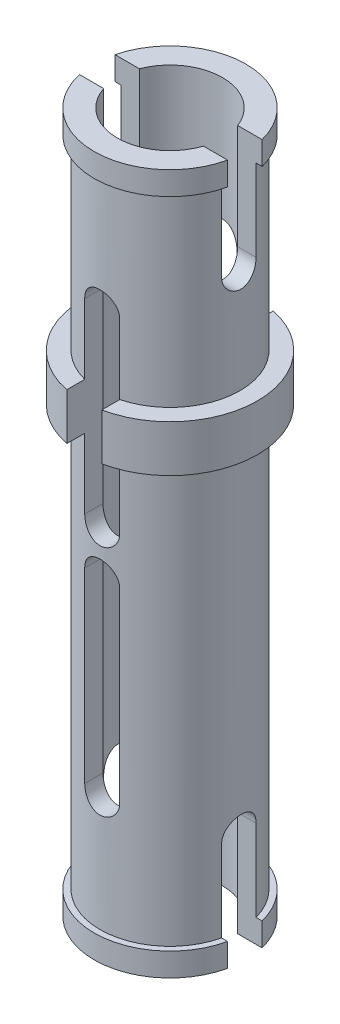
ISO-10303-21;
HEADER;
FILE_DESCRIPTION(('STEP AP214'),'2;1');
FILE_NAME('part.step','',(''),(''),'','','');
FILE_SCHEMA(('AUTOMOTIVE_DESIGN { 1 0 10303 214 1 1 1 1 }'));
ENDSEC;
DATA;
#1=APPLICATION_CONTEXT('core data for automotive mechanical design processes');
#2=APPLICATION_PROTOCOL_DEFINITION('international standard','automotive_design',2000,#1);
#3=PRODUCT_CONTEXT('',#1,'mechanical');
#4=PRODUCT('Part','Part','',(#3));
#5=PRODUCT_RELATED_PRODUCT_CATEGORY('part','',(#4));
#6=PRODUCT_DEFINITION_FORMATION('','',#4);
#7=PRODUCT_DEFINITION_CONTEXT('part definition',#1,'design');
#8=PRODUCT_DEFINITION('design','',#6,#7);
#9=PRODUCT_DEFINITION_SHAPE('','',#8);
#10=(LENGTH_UNIT() NAMED_UNIT(*) SI_UNIT(.MILLI.,.METRE.));
#11=(NAMED_UNIT(*) PLANE_ANGLE_UNIT() SI_UNIT($,.RADIAN.));
#12=(NAMED_UNIT(*) SI_UNIT($,.STERADIAN.) SOLID_ANGLE_UNIT());
#13=UNCERTAINTY_MEASURE_WITH_UNIT(LENGTH_MEASURE(1.E-05),#10,'distance_accuracy_value','');
#14=(GEOMETRIC_REPRESENTATION_CONTEXT(3) GLOBAL_UNCERTAINTY_ASSIGNED_CONTEXT((#13)) GLOBAL_UNIT_ASSIGNED_CONTEXT((#10,
#11,#12)) REPRESENTATION_CONTEXT('',''));
#15=CARTESIAN_POINT('',(0.,0.,0.));
#16=DIRECTION('',(0.,0.,1.));
#17=DIRECTION('',(1.,0.,0.));
#18=AXIS2_PLACEMENT_3D('',#15,#16,#17);
#19=CARTESIAN_POINT('',(0.,-16.,0.));
#20=DIRECTION('',(0.,1.,0.));
#21=DIRECTION('',(0.,0.,1.));
#22=AXIS2_PLACEMENT_3D('',#19,#20,#21);
#23=CYLINDRICAL_SURFACE('',#22,2.4);
#24=DIRECTION('',(0.,1.,0.));
#25=VECTOR('',#24,1.);
#26=CARTESIAN_POINT('',(0.600000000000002,-16.,-2.32379000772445));
#27=LINE('',#26,#25);
#28=CARTESIAN_POINT('',(0.600000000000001,-3.2,-2.32379000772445));
#29=VERTEX_POINT('',#28);
#30=CARTESIAN_POINT('',(0.600000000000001,-0.8,-2.32379000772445));
#31=VERTEX_POINT('',#30);
#32=EDGE_CURVE('E679',#29,#31,#27,.T.);
#33=ORIENTED_EDGE('',*,*,#32,.T.);
#34=CARTESIAN_POINT('',(0.,-0.8,0.));
#35=DIRECTION('',(0.,1.,0.));
#36=DIRECTION('',(0.,0.,1.));
#37=AXIS2_PLACEMENT_3D('',#34,#35,#36);
#38=CIRCLE('',#37,2.4);
#39=CARTESIAN_POINT('',(0.600000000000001,-0.8,2.32379000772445));
#40=VERTEX_POINT('',#39);
#41=EDGE_CURVE('E394',#31,#40,#38,.F.);
#42=ORIENTED_EDGE('',*,*,#41,.T.);
#43=DIRECTION('',(0.,1.,0.));
#44=VECTOR('',#43,1.);
#45=CARTESIAN_POINT('',(0.600000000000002,-16.,2.32379000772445));
#46=LINE('',#45,#44);
#47=CARTESIAN_POINT('',(0.600000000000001,-3.2,2.32379000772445));
#48=VERTEX_POINT('',#47);
#49=EDGE_CURVE('E744',#48,#40,#46,.T.);
#50=ORIENTED_EDGE('',*,*,#49,.F.);
#51=CARTESIAN_POINT('',(-0.599999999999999,-3.2,2.32379000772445));
#52=CARTESIAN_POINT('',(-0.600031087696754,-3.23319369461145,2.32376171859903));
#53=CARTESIAN_POINT('',(-0.597247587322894,-3.26636660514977,2.32450050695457));
#54=CARTESIAN_POINT('',(-0.586295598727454,-3.33168786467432,2.3272975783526));
#55=CARTESIAN_POINT('',(-0.578138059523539,-3.36383815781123,2.32935317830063));
#56=CARTESIAN_POINT('',(-0.556681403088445,-3.42627052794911,2.33457057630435));
#57=CARTESIAN_POINT('',(-0.543382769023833,-3.45655278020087,2.33773227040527));
#58=CARTESIAN_POINT('',(-0.512048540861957,-3.51446801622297,2.34479533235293));
#59=CARTESIAN_POINT('',(-0.494011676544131,-3.54210028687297,2.34869689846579));
#60=CARTESIAN_POINT('',(-0.453290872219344,-3.59452601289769,2.35689742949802));
#61=CARTESIAN_POINT('',(-0.430522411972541,-3.61925284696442,2.36120270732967));
#62=CARTESIAN_POINT('',(-0.381165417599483,-3.66458133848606,2.36967066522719));
#63=CARTESIAN_POINT('',(-0.354576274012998,-3.68518233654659,2.37383332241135));
#64=CARTESIAN_POINT('',(-0.297874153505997,-3.7219465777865,2.38161708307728));
#65=CARTESIAN_POINT('',(-0.267717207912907,-3.73804393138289,2.38522982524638));
#66=CARTESIAN_POINT('',(-0.205021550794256,-3.76491484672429,2.39143408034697));
#67=CARTESIAN_POINT('',(-0.172483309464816,-3.77568945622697,2.39402579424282));
#68=CARTESIAN_POINT('',(-0.106646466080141,-3.79139539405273,2.39785139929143));
#69=CARTESIAN_POINT('',(-0.0733765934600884,-3.79644060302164,2.39911171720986));
#70=CARTESIAN_POINT('',(-0.00643966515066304,-3.80090202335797,2.40022462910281));
#71=CARTESIAN_POINT('',(0.0272273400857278,-3.80031894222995,2.40007740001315));
#72=CARTESIAN_POINT('',(0.0932114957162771,-3.79362202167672,2.3984114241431));
#73=CARTESIAN_POINT('',(0.125542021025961,-3.78763123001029,2.39692319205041));
#74=CARTESIAN_POINT('',(0.18872322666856,-3.77048679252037,2.39277798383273));
#75=CARTESIAN_POINT('',(0.219573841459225,-3.75933291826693,2.39012095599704));
#76=CARTESIAN_POINT('',(0.27924437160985,-3.73207923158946,2.38388998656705));
#77=CARTESIAN_POINT('',(0.308043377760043,-3.71593556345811,2.38030796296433));
#78=CARTESIAN_POINT('',(0.362565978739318,-3.67919412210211,2.37261567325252));
#79=CARTESIAN_POINT('',(0.388289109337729,-3.65859567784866,2.36850532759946));
#80=CARTESIAN_POINT('',(0.436661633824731,-3.6128726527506,2.36007339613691));
#81=CARTESIAN_POINT('',(0.45920946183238,-3.58764101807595,2.35574910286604));
#82=CARTESIAN_POINT('',(0.499781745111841,-3.53370207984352,2.34747700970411));
#83=CARTESIAN_POINT('',(0.517804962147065,-3.50499382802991,2.34352931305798));
#84=CARTESIAN_POINT('',(0.548882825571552,-3.4447126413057,2.33644688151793));
#85=CARTESIAN_POINT('',(0.561910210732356,-3.41312512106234,2.33331663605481));
#86=CARTESIAN_POINT('',(0.582421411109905,-3.34812984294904,2.32828235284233));
#87=CARTESIAN_POINT('',(0.589913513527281,-3.3147248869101,2.32637648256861));
#88=CARTESIAN_POINT('',(0.596342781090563,-3.26752557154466,2.32473174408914));
#89=CARTESIAN_POINT('',(0.597714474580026,-3.25404817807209,2.32437913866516));
#90=CARTESIAN_POINT('',(0.599542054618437,-3.22704932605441,2.32390837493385));
#91=CARTESIAN_POINT('',(0.599999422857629,-3.21352797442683,2.32378983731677));
#92=CARTESIAN_POINT('',(0.600000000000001,-3.2,2.32379000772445));
#93=B_SPLINE_CURVE_WITH_KNOTS('',3,(#51,#52,#53,#54,#55,#56,#57,#58,#59,#60,#61,#62,#63,#64,#65,
#66,#67,#68,#69,#70,#71,#72,#73,#74,#75,#76,#77,#78,#79,#80,#81,#82,#83,#84,#85,#86,#87,#88,#89,
#90,#91,#92),.UNSPECIFIED.,.F.,.F.,(4,2,2,2,2,2,2,2,2,2,2,2,2,2,2,2,2,2,2,2,4),(0.,
0.0994244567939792,0.198646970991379,0.297860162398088,0.397099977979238,0.498294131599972,
0.599504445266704,0.702126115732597,0.804727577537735,0.905251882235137,1.00576355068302,
1.10404426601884,1.20232932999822,1.30150404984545,1.40069371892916,1.50255757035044,
1.60444926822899,1.70688931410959,1.8091756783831,1.84980408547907,1.89036659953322),.UNSPECIFIED.);
#94=CARTESIAN_POINT('',(-0.599999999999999,-3.2,2.32379000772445));
#95=VERTEX_POINT('',#94);
#96=EDGE_CURVE('E974',#95,#48,#93,.T.);
#97=ORIENTED_EDGE('',*,*,#96,.F.);
#98=DIRECTION('',(0.,1.,0.));
#99=VECTOR('',#98,1.);
#100=CARTESIAN_POINT('',(-0.599999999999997,-16.,2.32379000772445));
#101=LINE('',#100,#99);
#102=CARTESIAN_POINT('',(-0.599999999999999,-0.8,2.32379000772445));
#103=VERTEX_POINT('',#102);
#104=EDGE_CURVE('E981',#103,#95,#101,.F.);
#105=ORIENTED_EDGE('',*,*,#104,.F.);
#106=CARTESIAN_POINT('',(-0.599999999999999,-0.8,-2.32379000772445));
#107=VERTEX_POINT('',#106);
#108=EDGE_CURVE('E396',#103,#107,#38,.F.);
#109=ORIENTED_EDGE('',*,*,#108,.T.);
#110=DIRECTION('',(0.,1.,0.));
#111=VECTOR('',#110,1.);
#112=CARTESIAN_POINT('',(-0.599999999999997,-16.,-2.32379000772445));
#113=LINE('',#112,#111);
#114=CARTESIAN_POINT('',(-0.599999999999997,-3.2,-2.32379000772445));
#115=VERTEX_POINT('',#114);
#116=EDGE_CURVE('E902',#107,#115,#113,.F.);
#117=ORIENTED_EDGE('',*,*,#116,.T.);
#118=CARTESIAN_POINT('',(-0.599999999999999,-3.2,-2.32379000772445));
#119=CARTESIAN_POINT('',(-0.600031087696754,-3.23319369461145,-2.32376171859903));
#120=CARTESIAN_POINT('',(-0.597247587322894,-3.26636660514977,-2.32450050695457));
#121=CARTESIAN_POINT('',(-0.586295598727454,-3.33168786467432,-2.3272975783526));
#122=CARTESIAN_POINT('',(-0.578138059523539,-3.36383815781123,-2.32935317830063));
#123=CARTESIAN_POINT('',(-0.556681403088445,-3.42627052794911,-2.33457057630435));
#124=CARTESIAN_POINT('',(-0.543382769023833,-3.45655278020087,-2.33773227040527));
#125=CARTESIAN_POINT('',(-0.512048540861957,-3.51446801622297,-2.34479533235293));
#126=CARTESIAN_POINT('',(-0.494011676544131,-3.54210028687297,-2.34869689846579));
#127=CARTESIAN_POINT('',(-0.453290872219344,-3.59452601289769,-2.35689742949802));
#128=CARTESIAN_POINT('',(-0.430522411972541,-3.61925284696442,-2.36120270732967));
#129=CARTESIAN_POINT('',(-0.381165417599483,-3.66458133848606,-2.36967066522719));
#130=CARTESIAN_POINT('',(-0.354576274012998,-3.68518233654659,-2.37383332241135));
#131=CARTESIAN_POINT('',(-0.297874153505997,-3.7219465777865,-2.38161708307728));
#132=CARTESIAN_POINT('',(-0.267717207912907,-3.73804393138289,-2.38522982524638));
#133=CARTESIAN_POINT('',(-0.205021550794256,-3.76491484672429,-2.39143408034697));
#134=CARTESIAN_POINT('',(-0.172483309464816,-3.77568945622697,-2.39402579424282));
#135=CARTESIAN_POINT('',(-0.106646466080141,-3.79139539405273,-2.39785139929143));
#136=CARTESIAN_POINT('',(-0.0733765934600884,-3.79644060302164,-2.39911171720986));
#137=CARTESIAN_POINT('',(-0.00643966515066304,-3.80090202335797,-2.40022462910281));
#138=CARTESIAN_POINT('',(0.0272273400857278,-3.80031894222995,-2.40007740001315));
#139=CARTESIAN_POINT('',(0.0932114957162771,-3.79362202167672,-2.3984114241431));
#140=CARTESIAN_POINT('',(0.125542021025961,-3.78763123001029,-2.39692319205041));
#141=CARTESIAN_POINT('',(0.18872322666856,-3.77048679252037,-2.39277798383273));
#142=CARTESIAN_POINT('',(0.219573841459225,-3.75933291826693,-2.39012095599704));
#143=CARTESIAN_POINT('',(0.27924437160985,-3.73207923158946,-2.38388998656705));
#144=CARTESIAN_POINT('',(0.308043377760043,-3.71593556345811,-2.38030796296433));
#145=CARTESIAN_POINT('',(0.362565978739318,-3.67919412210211,-2.37261567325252));
#146=CARTESIAN_POINT('',(0.388289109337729,-3.65859567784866,-2.36850532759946));
#147=CARTESIAN_POINT('',(0.436661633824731,-3.6128726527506,-2.36007339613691));
#148=CARTESIAN_POINT('',(0.45920946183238,-3.58764101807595,-2.35574910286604));
#149=CARTESIAN_POINT('',(0.499781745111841,-3.53370207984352,-2.34747700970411));
#150=CARTESIAN_POINT('',(0.517804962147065,-3.50499382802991,-2.34352931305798));
#151=CARTESIAN_POINT('',(0.548882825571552,-3.4447126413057,-2.33644688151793));
#152=CARTESIAN_POINT('',(0.561910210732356,-3.41312512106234,-2.33331663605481));
#153=CARTESIAN_POINT('',(0.582421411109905,-3.34812984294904,-2.32828235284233));
#154=CARTESIAN_POINT('',(0.589913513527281,-3.3147248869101,-2.32637648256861));
#155=CARTESIAN_POINT('',(0.596342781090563,-3.26752557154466,-2.32473174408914));
#156=CARTESIAN_POINT('',(0.597714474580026,-3.25404817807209,-2.32437913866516));
#157=CARTESIAN_POINT('',(0.599542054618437,-3.22704932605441,-2.32390837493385));
#158=CARTESIAN_POINT('',(0.599999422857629,-3.21352797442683,-2.32378983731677));
#159=CARTESIAN_POINT('',(0.600000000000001,-3.2,-2.32379000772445));
#160=B_SPLINE_CURVE_WITH_KNOTS('',3,(#118,#119,#120,#121,#122,#123,#124,#125,#126,#127,#128,
#129,#130,#131,#132,#133,#134,#135,#136,#137,#138,#139,#140,#141,#142,#143,#144,#145,#146,#147,
#148,#149,#150,#151,#152,#153,#154,#155,#156,#157,#158,#159),.UNSPECIFIED.,.F.,.F.,(4,2,2,2,2,2,
2,2,2,2,2,2,2,2,2,2,2,2,2,2,4),(0.,0.0994244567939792,0.198646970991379,0.297860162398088,
0.397099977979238,0.498294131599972,0.599504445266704,0.702126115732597,0.804727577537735,
0.905251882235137,1.00576355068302,1.10404426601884,1.20232932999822,1.30150404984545,
1.40069371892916,1.50255757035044,1.60444926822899,1.70688931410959,1.8091756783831,
1.84980408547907,1.89036659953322),.UNSPECIFIED.);
#161=EDGE_CURVE('E671',#115,#29,#160,.T.);
#162=ORIENTED_EDGE('',*,*,#161,.T.);
#163=EDGE_LOOP('',(#33,#42,#50,#97,#105,#109,#117,#162));
#164=FACE_BOUND('',#163,.T.);
#165=CARTESIAN_POINT('',(0.600000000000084,-4.8,-2.32379000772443));
#166=CARTESIAN_POINT('',(0.60003108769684,-4.76680630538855,-2.32376171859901));
#167=CARTESIAN_POINT('',(0.597247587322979,-4.73363339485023,-2.32450050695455));
#168=CARTESIAN_POINT('',(0.58629559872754,-4.66831213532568,-2.32729757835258));
#169=CARTESIAN_POINT('',(0.578138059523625,-4.63616184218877,-2.32935317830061));
#170=CARTESIAN_POINT('',(0.556681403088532,-4.57372947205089,-2.33457057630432));
#171=CARTESIAN_POINT('',(0.54338276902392,-4.54344721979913,-2.33773227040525));
#172=CARTESIAN_POINT('',(0.512048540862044,-4.48553198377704,-2.34479533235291));
#173=CARTESIAN_POINT('',(0.494011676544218,-4.45789971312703,-2.34869689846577));
#174=CARTESIAN_POINT('',(0.453290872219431,-4.40547398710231,-2.356897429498));
#175=CARTESIAN_POINT('',(0.430522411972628,-4.38074715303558,-2.36120270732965));
#176=CARTESIAN_POINT('',(0.381165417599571,-4.33541866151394,-2.36967066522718));
#177=CARTESIAN_POINT('',(0.354576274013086,-4.31481766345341,-2.37383332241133));
#178=CARTESIAN_POINT('',(0.297874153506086,-4.2780534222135,-2.38161708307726));
#179=CARTESIAN_POINT('',(0.267717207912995,-4.26195606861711,-2.38522982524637));
#180=CARTESIAN_POINT('',(0.205021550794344,-4.23508515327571,-2.39143408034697));
#181=CARTESIAN_POINT('',(0.172483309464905,-4.22431054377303,-2.39402579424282));
#182=CARTESIAN_POINT('',(0.106646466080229,-4.20860460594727,-2.39785139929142));
#183=CARTESIAN_POINT('',(0.0733765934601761,-4.20355939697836,-2.39911171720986));
#184=CARTESIAN_POINT('',(0.00643966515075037,-4.19909797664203,-2.40022462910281));
#185=CARTESIAN_POINT('',(-0.0272273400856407,-4.19968105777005,-2.40007740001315));
#186=CARTESIAN_POINT('',(-0.0932114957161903,-4.20637797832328,-2.3984114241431));
#187=CARTESIAN_POINT('',(-0.125542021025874,-4.21236876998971,-2.39692319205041));
#188=CARTESIAN_POINT('',(-0.188723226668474,-4.22951320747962,-2.39277798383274));
#189=CARTESIAN_POINT('',(-0.219573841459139,-4.24066708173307,-2.39012095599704));
#190=CARTESIAN_POINT('',(-0.279244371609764,-4.26792076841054,-2.38388998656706));
#191=CARTESIAN_POINT('',(-0.308043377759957,-4.28406443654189,-2.38030796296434));
#192=CARTESIAN_POINT('',(-0.362565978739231,-4.32080587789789,-2.37261567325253));
#193=CARTESIAN_POINT('',(-0.388289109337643,-4.34140432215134,-2.36850532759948));
#194=CARTESIAN_POINT('',(-0.436661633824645,-4.38712734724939,-2.36007339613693));
#195=CARTESIAN_POINT('',(-0.459209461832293,-4.41235898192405,-2.35574910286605));
#196=CARTESIAN_POINT('',(-0.499781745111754,-4.46629792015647,-2.34747700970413));
#197=CARTESIAN_POINT('',(-0.517804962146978,-4.49500617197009,-2.343529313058));
#198=CARTESIAN_POINT('',(-0.548882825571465,-4.5552873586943,-2.33644688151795));
#199=CARTESIAN_POINT('',(-0.561910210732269,-4.58687487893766,-2.33331663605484));
#200=CARTESIAN_POINT('',(-0.582421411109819,-4.65187015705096,-2.32828235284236));
#201=CARTESIAN_POINT('',(-0.589913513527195,-4.6852751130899,-2.32637648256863));
#202=CARTESIAN_POINT('',(-0.596342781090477,-4.73247442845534,-2.32473174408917));
#203=CARTESIAN_POINT('',(-0.59771447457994,-4.74595182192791,-2.32437913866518));
#204=CARTESIAN_POINT('',(-0.599542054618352,-4.77295067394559,-2.32390837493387));
#205=CARTESIAN_POINT('',(-0.599999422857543,-4.78647202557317,-2.32378983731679));
#206=CARTESIAN_POINT('',(-0.599999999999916,-4.8,-2.32379000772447));
#207=B_SPLINE_CURVE_WITH_KNOTS('',3,(#165,#166,#167,#168,#169,#170,#171,#172,#173,#174,#175,
#176,#177,#178,#179,#180,#181,#182,#183,#184,#185,#186,#187,#188,#189,#190,#191,#192,#193,#194,
#195,#196,#197,#198,#199,#200,#201,#202,#203,#204,#205,#206),.UNSPECIFIED.,.F.,.F.,(4,2,2,2,2,2,
2,2,2,2,2,2,2,2,2,2,2,2,2,2,4),(0.,0.0994244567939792,0.198646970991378,0.297860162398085,
0.397099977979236,0.498294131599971,0.599504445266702,0.702126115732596,0.804727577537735,
0.905251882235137,1.00576355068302,1.10404426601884,1.20232932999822,1.30150404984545,
1.40069371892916,1.50255757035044,1.60444926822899,1.70688931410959,1.8091756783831,
1.84980408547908,1.89036659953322),.UNSPECIFIED.);
#208=CARTESIAN_POINT('',(0.600000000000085,-4.8,-2.32379000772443));
#209=VERTEX_POINT('',#208);
#210=CARTESIAN_POINT('',(-0.599999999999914,-4.8,-2.32379000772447));
#211=VERTEX_POINT('',#210);
#212=EDGE_CURVE('E625',#209,#211,#207,.T.);
#213=ORIENTED_EDGE('',*,*,#212,.T.);
#214=DIRECTION('',(0.,1.,0.));
#215=VECTOR('',#214,1.);
#216=CARTESIAN_POINT('',(-0.599999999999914,-16.,-2.32379000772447));
#217=LINE('',#216,#215);
#218=CARTESIAN_POINT('',(-0.599999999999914,-11.2,-2.32379000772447));
#219=VERTEX_POINT('',#218);
#220=EDGE_CURVE('E645',#211,#219,#217,.F.);
#221=ORIENTED_EDGE('',*,*,#220,.T.);
#222=CARTESIAN_POINT('',(-0.599999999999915,-11.2,-2.32379000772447));
#223=CARTESIAN_POINT('',(-0.60003108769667,-11.2331936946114,-2.32376171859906));
#224=CARTESIAN_POINT('',(-0.59724758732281,-11.2663666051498,-2.32450050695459));
#225=CARTESIAN_POINT('',(-0.58629559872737,-11.3316878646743,-2.32729757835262));
#226=CARTESIAN_POINT('',(-0.578138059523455,-11.3638381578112,-2.32935317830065));
#227=CARTESIAN_POINT('',(-0.556681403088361,-11.4262705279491,-2.33457057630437));
#228=CARTESIAN_POINT('',(-0.543382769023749,-11.4565527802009,-2.33773227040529));
#229=CARTESIAN_POINT('',(-0.512048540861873,-11.514468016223,-2.34479533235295));
#230=CARTESIAN_POINT('',(-0.494011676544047,-11.542100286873,-2.34869689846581));
#231=CARTESIAN_POINT('',(-0.453290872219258,-11.5945260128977,-2.35689742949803));
#232=CARTESIAN_POINT('',(-0.430522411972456,-11.6192528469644,-2.36120270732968));
#233=CARTESIAN_POINT('',(-0.381165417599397,-11.6645813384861,-2.36967066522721));
#234=CARTESIAN_POINT('',(-0.354576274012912,-11.6851823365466,-2.37383332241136));
#235=CARTESIAN_POINT('',(-0.297874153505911,-11.7219465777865,-2.38161708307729));
#236=CARTESIAN_POINT('',(-0.267717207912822,-11.7380439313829,-2.38522982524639));
#237=CARTESIAN_POINT('',(-0.205021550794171,-11.7649148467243,-2.39143408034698));
#238=CARTESIAN_POINT('',(-0.172483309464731,-11.775689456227,-2.39402579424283));
#239=CARTESIAN_POINT('',(-0.106646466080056,-11.7913953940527,-2.39785139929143));
#240=CARTESIAN_POINT('',(-0.0733765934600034,-11.7964406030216,-2.39911171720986));
#241=CARTESIAN_POINT('',(-0.00643966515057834,-11.800902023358,-2.40022462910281));
#242=CARTESIAN_POINT('',(0.0272273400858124,-11.80031894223,-2.40007740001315));
#243=CARTESIAN_POINT('',(0.0932114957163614,-11.7936220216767,-2.39841142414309));
#244=CARTESIAN_POINT('',(0.125542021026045,-11.7876312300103,-2.3969231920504));
#245=CARTESIAN_POINT('',(0.188723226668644,-11.7704867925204,-2.39277798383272));
#246=CARTESIAN_POINT('',(0.219573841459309,-11.7593329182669,-2.39012095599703));
#247=CARTESIAN_POINT('',(0.279244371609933,-11.7320792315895,-2.38388998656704));
#248=CARTESIAN_POINT('',(0.308043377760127,-11.7159355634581,-2.38030796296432));
#249=CARTESIAN_POINT('',(0.362565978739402,-11.6791941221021,-2.3726156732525));
#250=CARTESIAN_POINT('',(0.388289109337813,-11.6585956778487,-2.36850532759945));
#251=CARTESIAN_POINT('',(0.436661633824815,-11.6128726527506,-2.3600733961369));
#252=CARTESIAN_POINT('',(0.459209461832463,-11.5876410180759,-2.35574910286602));
#253=CARTESIAN_POINT('',(0.499781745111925,-11.5337020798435,-2.34747700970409));
#254=CARTESIAN_POINT('',(0.517804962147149,-11.5049938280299,-2.34352931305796));
#255=CARTESIAN_POINT('',(0.548882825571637,-11.4447126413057,-2.33644688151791));
#256=CARTESIAN_POINT('',(0.561910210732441,-11.4131251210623,-2.33331663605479));
#257=CARTESIAN_POINT('',(0.582421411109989,-11.348129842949,-2.32828235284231));
#258=CARTESIAN_POINT('',(0.589913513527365,-11.3147248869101,-2.32637648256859));
#259=CARTESIAN_POINT('',(0.596342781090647,-11.2675255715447,-2.32473174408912));
#260=CARTESIAN_POINT('',(0.59771447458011,-11.2540481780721,-2.32437913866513));
#261=CARTESIAN_POINT('',(0.599542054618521,-11.2270493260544,-2.32390837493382));
#262=CARTESIAN_POINT('',(0.599999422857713,-11.2135279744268,-2.32378983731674));
#263=CARTESIAN_POINT('',(0.600000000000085,-11.2,-2.32379000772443));
#264=B_SPLINE_CURVE_WITH_KNOTS('',3,(#222,#223,#224,#225,#226,#227,#228,#229,#230,#231,#232,
#233,#234,#235,#236,#237,#238,#239,#240,#241,#242,#243,#244,#245,#246,#247,#248,#249,#250,#251,
#252,#253,#254,#255,#256,#257,#258,#259,#260,#261,#262,#263),.UNSPECIFIED.,.F.,.F.,(4,2,2,2,2,2,
2,2,2,2,2,2,2,2,2,2,2,2,2,2,4),(0.,0.0994244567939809,0.198646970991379,0.297860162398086,
0.39709997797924,0.498294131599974,0.599504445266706,0.702126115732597,0.804727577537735,
0.905251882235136,1.00576355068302,1.10404426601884,1.20232932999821,1.30150404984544,
1.40069371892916,1.50255757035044,1.60444926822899,1.7068893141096,1.80917567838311,
1.84980408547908,1.89036659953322),.UNSPECIFIED.);
#265=CARTESIAN_POINT('',(0.600000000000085,-11.2,-2.32379000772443));
#266=VERTEX_POINT('',#265);
#267=EDGE_CURVE('E607',#219,#266,#264,.T.);
#268=ORIENTED_EDGE('',*,*,#267,.T.);
#269=DIRECTION('',(0.,1.,0.));
#270=VECTOR('',#269,1.);
#271=CARTESIAN_POINT('',(0.600000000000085,-16.,-2.32379000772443));
#272=LINE('',#271,#270);
#273=EDGE_CURVE('E633',#266,#209,#272,.T.);
#274=ORIENTED_EDGE('',*,*,#273,.T.);
#275=EDGE_LOOP('',(#213,#221,#268,#274));
#276=FACE_BOUND('',#275,.T.);
#277=DIRECTION('',(0.,1.,0.));
#278=VECTOR('',#277,1.);
#279=CARTESIAN_POINT('',(-0.599999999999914,-16.,2.32379000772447));
#280=LINE('',#279,#278);
#281=CARTESIAN_POINT('',(-0.599999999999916,-4.8,2.32379000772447));
#282=VERTEX_POINT('',#281);
#283=CARTESIAN_POINT('',(-0.599999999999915,-11.2,2.32379000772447));
#284=VERTEX_POINT('',#283);
#285=EDGE_CURVE('E853',#282,#284,#280,.F.);
#286=ORIENTED_EDGE('',*,*,#285,.F.);
#287=CARTESIAN_POINT('',(0.600000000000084,-4.8,2.32379000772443));
#288=CARTESIAN_POINT('',(0.60003108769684,-4.76680630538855,2.32376171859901));
#289=CARTESIAN_POINT('',(0.597247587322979,-4.73363339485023,2.32450050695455));
#290=CARTESIAN_POINT('',(0.58629559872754,-4.66831213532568,2.32729757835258));
#291=CARTESIAN_POINT('',(0.578138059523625,-4.63616184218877,2.32935317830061));
#292=CARTESIAN_POINT('',(0.556681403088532,-4.57372947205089,2.33457057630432));
#293=CARTESIAN_POINT('',(0.54338276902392,-4.54344721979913,2.33773227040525));
#294=CARTESIAN_POINT('',(0.512048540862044,-4.48553198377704,2.34479533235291));
#295=CARTESIAN_POINT('',(0.494011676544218,-4.45789971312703,2.34869689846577));
#296=CARTESIAN_POINT('',(0.453290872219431,-4.40547398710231,2.356897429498));
#297=CARTESIAN_POINT('',(0.430522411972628,-4.38074715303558,2.36120270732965));
#298=CARTESIAN_POINT('',(0.381165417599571,-4.33541866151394,2.36967066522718));
#299=CARTESIAN_POINT('',(0.354576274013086,-4.31481766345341,2.37383332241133));
#300=CARTESIAN_POINT('',(0.297874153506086,-4.2780534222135,2.38161708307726));
#301=CARTESIAN_POINT('',(0.267717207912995,-4.26195606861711,2.38522982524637));
#302=CARTESIAN_POINT('',(0.205021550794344,-4.23508515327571,2.39143408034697));
#303=CARTESIAN_POINT('',(0.172483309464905,-4.22431054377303,2.39402579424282));
#304=CARTESIAN_POINT('',(0.106646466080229,-4.20860460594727,2.39785139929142));
#305=CARTESIAN_POINT('',(0.0733765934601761,-4.20355939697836,2.39911171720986));
#306=CARTESIAN_POINT('',(0.00643966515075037,-4.19909797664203,2.40022462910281));
#307=CARTESIAN_POINT('',(-0.0272273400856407,-4.19968105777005,2.40007740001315));
#308=CARTESIAN_POINT('',(-0.0932114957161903,-4.20637797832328,2.3984114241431));
#309=CARTESIAN_POINT('',(-0.125542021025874,-4.21236876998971,2.39692319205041));
#310=CARTESIAN_POINT('',(-0.188723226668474,-4.22951320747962,2.39277798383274));
#311=CARTESIAN_POINT('',(-0.219573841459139,-4.24066708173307,2.39012095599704));
#312=CARTESIAN_POINT('',(-0.279244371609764,-4.26792076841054,2.38388998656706));
#313=CARTESIAN_POINT('',(-0.308043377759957,-4.28406443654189,2.38030796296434));
#314=CARTESIAN_POINT('',(-0.362565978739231,-4.32080587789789,2.37261567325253));
#315=CARTESIAN_POINT('',(-0.388289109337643,-4.34140432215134,2.36850532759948));
#316=CARTESIAN_POINT('',(-0.436661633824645,-4.38712734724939,2.36007339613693));
#317=CARTESIAN_POINT('',(-0.459209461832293,-4.41235898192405,2.35574910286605));
#318=CARTESIAN_POINT('',(-0.499781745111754,-4.46629792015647,2.34747700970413));
#319=CARTESIAN_POINT('',(-0.517804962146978,-4.49500617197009,2.343529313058));
#320=CARTESIAN_POINT('',(-0.548882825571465,-4.5552873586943,2.33644688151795));
#321=CARTESIAN_POINT('',(-0.561910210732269,-4.58687487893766,2.33331663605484));
#322=CARTESIAN_POINT('',(-0.582421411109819,-4.65187015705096,2.32828235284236));
#323=CARTESIAN_POINT('',(-0.589913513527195,-4.6852751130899,2.32637648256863));
#324=CARTESIAN_POINT('',(-0.596342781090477,-4.73247442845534,2.32473174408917));
#325=CARTESIAN_POINT('',(-0.59771447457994,-4.74595182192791,2.32437913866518));
#326=CARTESIAN_POINT('',(-0.599542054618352,-4.77295067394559,2.32390837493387));
#327=CARTESIAN_POINT('',(-0.599999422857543,-4.78647202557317,2.32378983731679));
#328=CARTESIAN_POINT('',(-0.599999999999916,-4.8,2.32379000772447));
#329=B_SPLINE_CURVE_WITH_KNOTS('',3,(#287,#288,#289,#290,#291,#292,#293,#294,#295,#296,#297,
#298,#299,#300,#301,#302,#303,#304,#305,#306,#307,#308,#309,#310,#311,#312,#313,#314,#315,#316,
#317,#318,#319,#320,#321,#322,#323,#324,#325,#326,#327,#328),.UNSPECIFIED.,.F.,.F.,(4,2,2,2,2,2,
2,2,2,2,2,2,2,2,2,2,2,2,2,2,4),(0.,0.0994244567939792,0.198646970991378,0.297860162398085,
0.397099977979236,0.498294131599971,0.599504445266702,0.702126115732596,0.804727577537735,
0.905251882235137,1.00576355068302,1.10404426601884,1.20232932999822,1.30150404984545,
1.40069371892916,1.50255757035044,1.60444926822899,1.70688931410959,1.8091756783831,
1.84980408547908,1.89036659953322),.UNSPECIFIED.);
#330=CARTESIAN_POINT('',(0.600000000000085,-4.8,2.32379000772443));
#331=VERTEX_POINT('',#330);
#332=EDGE_CURVE('E856',#331,#282,#329,.T.);
#333=ORIENTED_EDGE('',*,*,#332,.F.);
#334=DIRECTION('',(0.,1.,0.));
#335=VECTOR('',#334,1.);
#336=CARTESIAN_POINT('',(0.600000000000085,-16.,2.32379000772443));
#337=LINE('',#336,#335);
#338=CARTESIAN_POINT('',(0.600000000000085,-11.2,2.32379000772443));
#339=VERTEX_POINT('',#338);
#340=EDGE_CURVE('E658',#339,#331,#337,.T.);
#341=ORIENTED_EDGE('',*,*,#340,.F.);
#342=CARTESIAN_POINT('',(-0.599999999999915,-11.2,2.32379000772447));
#343=CARTESIAN_POINT('',(-0.60003108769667,-11.2331936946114,2.32376171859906));
#344=CARTESIAN_POINT('',(-0.59724758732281,-11.2663666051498,2.32450050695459));
#345=CARTESIAN_POINT('',(-0.58629559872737,-11.3316878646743,2.32729757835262));
#346=CARTESIAN_POINT('',(-0.578138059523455,-11.3638381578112,2.32935317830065));
#347=CARTESIAN_POINT('',(-0.556681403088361,-11.4262705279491,2.33457057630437));
#348=CARTESIAN_POINT('',(-0.543382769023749,-11.4565527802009,2.33773227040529));
#349=CARTESIAN_POINT('',(-0.512048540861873,-11.514468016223,2.34479533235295));
#350=CARTESIAN_POINT('',(-0.494011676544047,-11.542100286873,2.34869689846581));
#351=CARTESIAN_POINT('',(-0.453290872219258,-11.5945260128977,2.35689742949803));
#352=CARTESIAN_POINT('',(-0.430522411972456,-11.6192528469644,2.36120270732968));
#353=CARTESIAN_POINT('',(-0.381165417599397,-11.6645813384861,2.36967066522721));
#354=CARTESIAN_POINT('',(-0.354576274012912,-11.6851823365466,2.37383332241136));
#355=CARTESIAN_POINT('',(-0.297874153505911,-11.7219465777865,2.38161708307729));
#356=CARTESIAN_POINT('',(-0.267717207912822,-11.7380439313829,2.38522982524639));
#357=CARTESIAN_POINT('',(-0.205021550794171,-11.7649148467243,2.39143408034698));
#358=CARTESIAN_POINT('',(-0.172483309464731,-11.775689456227,2.39402579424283));
#359=CARTESIAN_POINT('',(-0.106646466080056,-11.7913953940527,2.39785139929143));
#360=CARTESIAN_POINT('',(-0.0733765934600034,-11.7964406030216,2.39911171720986));
#361=CARTESIAN_POINT('',(-0.00643966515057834,-11.800902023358,2.40022462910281));
#362=CARTESIAN_POINT('',(0.0272273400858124,-11.80031894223,2.40007740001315));
#363=CARTESIAN_POINT('',(0.0932114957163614,-11.7936220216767,2.39841142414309));
#364=CARTESIAN_POINT('',(0.125542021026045,-11.7876312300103,2.3969231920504));
#365=CARTESIAN_POINT('',(0.188723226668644,-11.7704867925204,2.39277798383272));
#366=CARTESIAN_POINT('',(0.219573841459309,-11.7593329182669,2.39012095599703));
#367=CARTESIAN_POINT('',(0.279244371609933,-11.7320792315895,2.38388998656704));
#368=CARTESIAN_POINT('',(0.308043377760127,-11.7159355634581,2.38030796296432));
#369=CARTESIAN_POINT('',(0.362565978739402,-11.6791941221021,2.3726156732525));
#370=CARTESIAN_POINT('',(0.388289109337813,-11.6585956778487,2.36850532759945));
#371=CARTESIAN_POINT('',(0.436661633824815,-11.6128726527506,2.3600733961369));
#372=CARTESIAN_POINT('',(0.459209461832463,-11.5876410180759,2.35574910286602));
#373=CARTESIAN_POINT('',(0.499781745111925,-11.5337020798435,2.34747700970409));
#374=CARTESIAN_POINT('',(0.517804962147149,-11.5049938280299,2.34352931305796));
#375=CARTESIAN_POINT('',(0.548882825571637,-11.4447126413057,2.33644688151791));
#376=CARTESIAN_POINT('',(0.561910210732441,-11.4131251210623,2.33331663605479));
#377=CARTESIAN_POINT('',(0.582421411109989,-11.348129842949,2.32828235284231));
#378=CARTESIAN_POINT('',(0.589913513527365,-11.3147248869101,2.32637648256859));
#379=CARTESIAN_POINT('',(0.596342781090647,-11.2675255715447,2.32473174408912));
#380=CARTESIAN_POINT('',(0.59771447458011,-11.2540481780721,2.32437913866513));
#381=CARTESIAN_POINT('',(0.599542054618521,-11.2270493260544,2.32390837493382));
#382=CARTESIAN_POINT('',(0.599999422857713,-11.2135279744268,2.32378983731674));
#383=CARTESIAN_POINT('',(0.600000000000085,-11.2,2.32379000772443));
#384=B_SPLINE_CURVE_WITH_KNOTS('',3,(#342,#343,#344,#345,#346,#347,#348,#349,#350,#351,#352,
#353,#354,#355,#356,#357,#358,#359,#360,#361,#362,#363,#364,#365,#366,#367,#368,#369,#370,#371,
#372,#373,#374,#375,#376,#377,#378,#379,#380,#381,#382,#383),.UNSPECIFIED.,.F.,.F.,(4,2,2,2,2,2,
2,2,2,2,2,2,2,2,2,2,2,2,2,2,4),(0.,0.0994244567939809,0.198646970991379,0.297860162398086,
0.39709997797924,0.498294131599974,0.599504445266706,0.702126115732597,0.804727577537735,
0.905251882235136,1.00576355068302,1.10404426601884,1.20232932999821,1.30150404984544,
1.40069371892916,1.50255757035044,1.60444926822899,1.7068893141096,1.80917567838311,
1.84980408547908,1.89036659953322),.UNSPECIFIED.);
#385=EDGE_CURVE('E857',#284,#339,#384,.T.);
#386=ORIENTED_EDGE('',*,*,#385,.F.);
#387=EDGE_LOOP('',(#286,#333,#341,#386));
#388=FACE_BOUND('',#387,.T.);
#389=CARTESIAN_POINT('',(2.31419594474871,-12.4,-0.636000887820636));
#390=CARTESIAN_POINT('',(2.31416705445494,-12.3668885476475,-0.636032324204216));
#391=CARTESIAN_POINT('',(2.31494846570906,-12.33379907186,-0.633262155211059));
#392=CARTESIAN_POINT('',(2.31791197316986,-12.2686489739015,-0.622366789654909));
#393=CARTESIAN_POINT('',(2.32009102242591,-12.2365862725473,-0.614253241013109));
#394=CARTESIAN_POINT('',(2.32563122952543,-12.1743275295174,-0.592918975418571));
#395=CARTESIAN_POINT('',(2.32899220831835,-12.1441312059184,-0.579699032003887));
#396=CARTESIAN_POINT('',(2.3365233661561,-12.086373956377,-0.548558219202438));
#397=CARTESIAN_POINT('',(2.34069379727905,-12.0588138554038,-0.530635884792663));
#398=CARTESIAN_POINT('',(2.34951148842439,-12.0064504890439,-0.490135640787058));
#399=CARTESIAN_POINT('',(2.35416719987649,-11.9817209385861,-0.467464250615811));
#400=CARTESIAN_POINT('',(2.36339577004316,-11.9363657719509,-0.418312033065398));
#401=CARTESIAN_POINT('',(2.36796861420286,-11.9157408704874,-0.391830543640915));
#402=CARTESIAN_POINT('',(2.37664547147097,-11.8788338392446,-0.335243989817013));
#403=CARTESIAN_POINT('',(2.38073987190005,-11.8626340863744,-0.305083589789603));
#404=CARTESIAN_POINT('',(2.38794093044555,-11.8355652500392,-0.242349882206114));
#405=CARTESIAN_POINT('',(2.39104777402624,-11.8246951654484,-0.209777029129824));
#406=CARTESIAN_POINT('',(2.39591106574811,-11.8088105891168,-0.143812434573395));
#407=CARTESIAN_POINT('',(2.39769273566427,-11.8036857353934,-0.110449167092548));
#408=CARTESIAN_POINT('',(2.39984451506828,-11.7991013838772,-0.0432919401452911));
#409=CARTESIAN_POINT('',(2.40021482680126,-11.7996410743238,-0.00949804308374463));
#410=CARTESIAN_POINT('',(2.39955343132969,-11.8062910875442,0.0566712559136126));
#411=CARTESIAN_POINT('',(2.39855627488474,-11.8122628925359,0.0890610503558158));
#412=CARTESIAN_POINT('',(2.39536789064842,-11.8293947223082,0.152374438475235));
#413=CARTESIAN_POINT('',(2.39317663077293,-11.8405548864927,0.18329799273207));
#414=CARTESIAN_POINT('',(2.38785428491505,-11.8678033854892,0.243015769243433));
#415=CARTESIAN_POINT('',(2.384717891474,-11.8839195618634,0.271796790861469));
#416=CARTESIAN_POINT('',(2.37787482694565,-11.920601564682,0.326292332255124));
#417=CARTESIAN_POINT('',(2.37416807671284,-11.9411680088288,0.35200642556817));
#418=CARTESIAN_POINT('',(2.36650518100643,-11.9867889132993,0.40033491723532));
#419=CARTESIAN_POINT('',(2.36254507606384,-12.0119450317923,0.422852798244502));
#420=CARTESIAN_POINT('',(2.35493151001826,-12.0657116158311,0.46338343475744));
#421=CARTESIAN_POINT('',(2.35127813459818,-12.0943230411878,0.481394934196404));
#422=CARTESIAN_POINT('',(2.34469483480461,-12.1544485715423,0.512505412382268));
#423=CARTESIAN_POINT('',(2.34177041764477,-12.1859824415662,0.525567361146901));
#424=CARTESIAN_POINT('',(2.337053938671,-12.2508641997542,0.546161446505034));
#425=CARTESIAN_POINT('',(2.3352602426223,-12.2842093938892,0.553701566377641));
#426=CARTESIAN_POINT('',(2.33369548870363,-12.331535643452,0.56023917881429));
#427=CARTESIAN_POINT('',(2.33335616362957,-12.3451997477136,0.56164941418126));
#428=CARTESIAN_POINT('',(2.33290305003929,-12.3725737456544,0.563528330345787));
#429=CARTESIAN_POINT('',(2.332788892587,-12.3862835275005,0.563998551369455));
#430=CARTESIAN_POINT('',(2.33278910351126,-12.4,0.563999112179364));
#431=B_SPLINE_CURVE_WITH_KNOTS('',3,(#389,#390,#391,#392,#393,#394,#395,#396,#397,#398,#399,
#400,#401,#402,#403,#404,#405,#406,#407,#408,#409,#410,#411,#412,#413,#414,#415,#416,#417,#418,
#419,#420,#421,#422,#423,#424,#425,#426,#427,#428,#429,#430),.UNSPECIFIED.,.F.,.F.,(4,2,2,2,2,2,
2,2,2,2,2,2,2,2,2,2,2,2,2,2,4),(0.,0.0991756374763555,0.198135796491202,0.297080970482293,
0.396057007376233,0.497203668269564,0.598367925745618,0.701303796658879,0.804220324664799,
0.905124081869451,1.00601337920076,1.10440000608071,1.20278927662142,1.30174169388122,
1.40070785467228,1.50221456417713,1.60374953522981,1.70602980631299,1.80816191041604,
1.84935705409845,1.89048464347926),.UNSPECIFIED.);
#432=CARTESIAN_POINT('',(2.31419594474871,-12.4,-0.636000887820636));
#433=VERTEX_POINT('',#432);
#434=CARTESIAN_POINT('',(2.33278910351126,-12.4,0.563999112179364));
#435=VERTEX_POINT('',#434);
#436=EDGE_CURVE('E505',#433,#435,#431,.T.);
#437=ORIENTED_EDGE('',*,*,#436,.F.);
#438=DIRECTION('',(0.,1.,0.));
#439=VECTOR('',#438,1.);
#440=CARTESIAN_POINT('',(2.31419594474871,-16.,-0.636000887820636));
#441=LINE('',#440,#439);
#442=CARTESIAN_POINT('',(2.31419594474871,-15.2,-0.636000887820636));
#443=VERTEX_POINT('',#442);
#444=EDGE_CURVE('E511',#443,#433,#441,.T.);
#445=ORIENTED_EDGE('',*,*,#444,.F.);
#446=CARTESIAN_POINT('',(0.,-15.2,0.));
#447=DIRECTION('',(0.,-1.,0.));
#448=DIRECTION('',(0.,0.,-1.));
#449=AXIS2_PLACEMENT_3D('',#446,#447,#448);
#450=CIRCLE('',#449,2.4);
#451=CARTESIAN_POINT('',(-2.31419594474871,-15.2,-0.636000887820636));
#452=VERTEX_POINT('',#451);
#453=EDGE_CURVE('E39',#443,#452,#450,.F.);
#454=ORIENTED_EDGE('',*,*,#453,.T.);
#455=DIRECTION('',(0.,1.,0.));
#456=VECTOR('',#455,1.);
#457=CARTESIAN_POINT('',(-2.31419594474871,-16.,-0.636000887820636));
#458=LINE('',#457,#456);
#459=CARTESIAN_POINT('',(-2.31419594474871,-12.4,-0.636000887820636));
#460=VERTEX_POINT('',#459);
#461=EDGE_CURVE('E348',#452,#460,#458,.T.);
#462=ORIENTED_EDGE('',*,*,#461,.T.);
#463=CARTESIAN_POINT('',(-2.31419594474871,-12.4,-0.636000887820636));
#464=CARTESIAN_POINT('',(-2.31416705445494,-12.3668885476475,-0.636032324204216));
#465=CARTESIAN_POINT('',(-2.31494846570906,-12.33379907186,-0.633262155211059));
#466=CARTESIAN_POINT('',(-2.31791197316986,-12.2686489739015,-0.622366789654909));
#467=CARTESIAN_POINT('',(-2.32009102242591,-12.2365862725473,-0.614253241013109));
#468=CARTESIAN_POINT('',(-2.32563122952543,-12.1743275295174,-0.592918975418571));
#469=CARTESIAN_POINT('',(-2.32899220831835,-12.1441312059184,-0.579699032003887));
#470=CARTESIAN_POINT('',(-2.3365233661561,-12.086373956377,-0.548558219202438));
#471=CARTESIAN_POINT('',(-2.34069379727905,-12.0588138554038,-0.530635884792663));
#472=CARTESIAN_POINT('',(-2.34951148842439,-12.0064504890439,-0.490135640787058));
#473=CARTESIAN_POINT('',(-2.35416719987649,-11.9817209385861,-0.467464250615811));
#474=CARTESIAN_POINT('',(-2.36339577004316,-11.9363657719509,-0.418312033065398));
#475=CARTESIAN_POINT('',(-2.36796861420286,-11.9157408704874,-0.391830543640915));
#476=CARTESIAN_POINT('',(-2.37664547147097,-11.8788338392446,-0.335243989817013));
#477=CARTESIAN_POINT('',(-2.38073987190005,-11.8626340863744,-0.305083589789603));
#478=CARTESIAN_POINT('',(-2.38794093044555,-11.8355652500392,-0.242349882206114));
#479=CARTESIAN_POINT('',(-2.39104777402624,-11.8246951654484,-0.209777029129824));
#480=CARTESIAN_POINT('',(-2.39591106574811,-11.8088105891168,-0.143812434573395));
#481=CARTESIAN_POINT('',(-2.39769273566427,-11.8036857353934,-0.110449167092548));
#482=CARTESIAN_POINT('',(-2.39984451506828,-11.7991013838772,-0.0432919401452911));
#483=CARTESIAN_POINT('',(-2.40021482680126,-11.7996410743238,-0.00949804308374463));
#484=CARTESIAN_POINT('',(-2.39955343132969,-11.8062910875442,0.0566712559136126));
#485=CARTESIAN_POINT('',(-2.39855627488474,-11.8122628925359,0.0890610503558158));
#486=CARTESIAN_POINT('',(-2.39536789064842,-11.8293947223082,0.152374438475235));
#487=CARTESIAN_POINT('',(-2.39317663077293,-11.8405548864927,0.18329799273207));
#488=CARTESIAN_POINT('',(-2.38785428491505,-11.8678033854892,0.243015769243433));
#489=CARTESIAN_POINT('',(-2.384717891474,-11.8839195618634,0.271796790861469));
#490=CARTESIAN_POINT('',(-2.37787482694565,-11.920601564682,0.326292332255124));
#491=CARTESIAN_POINT('',(-2.37416807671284,-11.9411680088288,0.35200642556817));
#492=CARTESIAN_POINT('',(-2.36650518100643,-11.9867889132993,0.40033491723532));
#493=CARTESIAN_POINT('',(-2.36254507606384,-12.0119450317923,0.422852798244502));
#494=CARTESIAN_POINT('',(-2.35493151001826,-12.0657116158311,0.46338343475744));
#495=CARTESIAN_POINT('',(-2.35127813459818,-12.0943230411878,0.481394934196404));
#496=CARTESIAN_POINT('',(-2.34469483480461,-12.1544485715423,0.512505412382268));
#497=CARTESIAN_POINT('',(-2.34177041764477,-12.1859824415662,0.525567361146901));
#498=CARTESIAN_POINT('',(-2.337053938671,-12.2508641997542,0.546161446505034));
#499=CARTESIAN_POINT('',(-2.3352602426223,-12.2842093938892,0.553701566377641));
#500=CARTESIAN_POINT('',(-2.33369548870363,-12.331535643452,0.56023917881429));
#501=CARTESIAN_POINT('',(-2.33335616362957,-12.3451997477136,0.56164941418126));
#502=CARTESIAN_POINT('',(-2.33290305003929,-12.3725737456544,0.563528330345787));
#503=CARTESIAN_POINT('',(-2.332788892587,-12.3862835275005,0.563998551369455));
#504=CARTESIAN_POINT('',(-2.33278910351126,-12.4,0.563999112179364));
#505=B_SPLINE_CURVE_WITH_KNOTS('',3,(#463,#464,#465,#466,#467,#468,#469,#470,#471,#472,#473,
#474,#475,#476,#477,#478,#479,#480,#481,#482,#483,#484,#485,#486,#487,#488,#489,#490,#491,#492,
#493,#494,#495,#496,#497,#498,#499,#500,#501,#502,#503,#504),.UNSPECIFIED.,.F.,.F.,(4,2,2,2,2,2,
2,2,2,2,2,2,2,2,2,2,2,2,2,2,4),(0.,0.0991756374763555,0.198135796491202,0.297080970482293,
0.396057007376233,0.497203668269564,0.598367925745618,0.701303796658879,0.804220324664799,
0.905124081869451,1.00601337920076,1.10440000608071,1.20278927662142,1.30174169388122,
1.40070785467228,1.50221456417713,1.60374953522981,1.70602980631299,1.80816191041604,
1.84935705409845,1.89048464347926),.UNSPECIFIED.);
#506=CARTESIAN_POINT('',(-2.33278910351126,-12.4,0.563999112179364));
#507=VERTEX_POINT('',#506);
#508=EDGE_CURVE('E812',#460,#507,#505,.T.);
#509=ORIENTED_EDGE('',*,*,#508,.T.);
#510=DIRECTION('',(0.,1.,0.));
#511=VECTOR('',#510,1.);
#512=CARTESIAN_POINT('',(-2.33278910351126,-16.,0.563999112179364));
#513=LINE('',#512,#511);
#514=CARTESIAN_POINT('',(-2.33278910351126,-15.2,0.563999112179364));
#515=VERTEX_POINT('',#514);
#516=EDGE_CURVE('E801',#507,#515,#513,.F.);
#517=ORIENTED_EDGE('',*,*,#516,.T.);
#518=CARTESIAN_POINT('',(2.33278910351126,-15.2,0.563999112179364));
#519=VERTEX_POINT('',#518);
#520=EDGE_CURVE('E386',#515,#519,#450,.F.);
#521=ORIENTED_EDGE('',*,*,#520,.T.);
#522=DIRECTION('',(0.,1.,0.));
#523=VECTOR('',#522,1.);
#524=CARTESIAN_POINT('',(2.33278910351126,-16.,0.563999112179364));
#525=LINE('',#524,#523);
#526=EDGE_CURVE('E429',#435,#519,#525,.F.);
#527=ORIENTED_EDGE('',*,*,#526,.F.);
#528=EDGE_LOOP('',(#437,#445,#454,#462,#509,#517,#521,#527));
#529=FACE_BOUND('',#528,.T.);
#530=ADVANCED_FACE('F36',(#164,#276,#388,#529),#23,.T.);
#531=DIRECTION('',(0.,1.,0.));
#532=VECTOR('',#531,1.);
#533=CARTESIAN_POINT('',(-2.3141959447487,-16.,-0.636000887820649));
#534=LINE('',#533,#532);
#535=CARTESIAN_POINT('',(-2.31419594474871,4.4,-0.636000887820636));
#536=VERTEX_POINT('',#535);
#537=CARTESIAN_POINT('',(-2.31419594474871,7.2,-0.636000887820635));
#538=VERTEX_POINT('',#537);
#539=EDGE_CURVE('E462',#536,#538,#534,.T.);
#540=ORIENTED_EDGE('',*,*,#539,.T.);
#541=CARTESIAN_POINT('',(0.,7.2,0.));
#542=DIRECTION('',(0.,1.,0.));
#543=DIRECTION('',(0.,0.,1.));
#544=AXIS2_PLACEMENT_3D('',#541,#542,#543);
#545=CIRCLE('',#544,2.4);
#546=CARTESIAN_POINT('',(2.31419594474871,7.2,-0.636000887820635));
#547=VERTEX_POINT('',#546);
#548=EDGE_CURVE('E400',#538,#547,#545,.F.);
#549=ORIENTED_EDGE('',*,*,#548,.T.);
#550=DIRECTION('',(0.,1.,0.));
#551=VECTOR('',#550,1.);
#552=CARTESIAN_POINT('',(2.3141959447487,-16.,-0.636000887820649));
#553=LINE('',#552,#551);
#554=CARTESIAN_POINT('',(2.3141959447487,4.4,-0.636000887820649));
#555=VERTEX_POINT('',#554);
#556=EDGE_CURVE('E575',#555,#547,#553,.T.);
#557=ORIENTED_EDGE('',*,*,#556,.F.);
#558=CARTESIAN_POINT('',(2.33278910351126,4.4,0.563999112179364));
#559=CARTESIAN_POINT('',(2.33276139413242,4.36672987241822,0.564029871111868));
#560=CARTESIAN_POINT('',(2.33345744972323,4.33347938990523,0.561233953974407));
#561=CARTESIAN_POINT('',(2.33608745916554,4.2679988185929,0.550229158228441));
#562=CARTESIAN_POINT('',(2.33801906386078,4.23576691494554,0.542030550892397));
#563=CARTESIAN_POINT('',(2.34291191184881,4.17317273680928,0.52045954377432));
#564=CARTESIAN_POINT('',(2.34587311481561,4.14281038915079,0.507087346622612));
#565=CARTESIAN_POINT('',(2.35246488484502,4.08474815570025,0.475572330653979));
#566=CARTESIAN_POINT('',(2.35609560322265,4.05704887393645,0.457428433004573));
#567=CARTESIAN_POINT('',(2.36367594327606,4.00456762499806,0.416503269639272));
#568=CARTESIAN_POINT('',(2.36763004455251,3.97984541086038,0.393646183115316));
#569=CARTESIAN_POINT('',(2.37533585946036,3.93454589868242,0.344103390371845));
#570=CARTESIAN_POINT('',(2.379087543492,3.91396920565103,0.31741712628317));
#571=CARTESIAN_POINT('',(2.38598095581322,3.87734115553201,0.26061596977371));
#572=CARTESIAN_POINT('',(2.38911577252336,3.8613402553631,0.230467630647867));
#573=CARTESIAN_POINT('',(2.39433139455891,3.83465445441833,0.167820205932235));
#574=CARTESIAN_POINT('',(2.3964124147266,3.8239684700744,0.13532160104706));
#575=CARTESIAN_POINT('',(2.39921078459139,3.80842450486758,0.0696140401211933));
#576=CARTESIAN_POINT('',(2.39995547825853,3.80345043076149,0.0364337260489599));
#577=CARTESIAN_POINT('',(2.40004059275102,3.79909659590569,-0.030292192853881));
#578=CARTESIAN_POINT('',(2.3993811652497,3.7997162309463,-0.0638377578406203));
#579=CARTESIAN_POINT('',(2.39671750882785,3.8064490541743,-0.129650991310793));
#580=CARTESIAN_POINT('',(2.39473976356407,3.8124548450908,-0.161930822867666));
#581=CARTESIAN_POINT('',(2.38963964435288,3.82960683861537,-0.224997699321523));
#582=CARTESIAN_POINT('',(2.38651720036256,3.84075335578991,-0.255784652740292));
#583=CARTESIAN_POINT('',(2.379374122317,3.86801247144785,-0.315424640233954));
#584=CARTESIAN_POINT('',(2.37534288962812,3.88418459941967,-0.344249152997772));
#585=CARTESIAN_POINT('',(2.36679352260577,3.92099020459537,-0.398813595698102));
#586=CARTESIAN_POINT('',(2.36227530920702,3.9416244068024,-0.424553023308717));
#587=CARTESIAN_POINT('',(2.35306501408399,3.98745743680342,-0.472980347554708));
#588=CARTESIAN_POINT('',(2.34837161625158,4.01276832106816,-0.495562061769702));
#589=CARTESIAN_POINT('',(2.33943193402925,4.06688952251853,-0.536183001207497));
#590=CARTESIAN_POINT('',(2.33518576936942,4.09570077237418,-0.554221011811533));
#591=CARTESIAN_POINT('',(2.32759951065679,4.15614535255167,-0.58526722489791));
#592=CARTESIAN_POINT('',(2.32426236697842,4.18778743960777,-0.598259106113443));
#593=CARTESIAN_POINT('',(2.31890963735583,4.25289885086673,-0.618685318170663));
#594=CARTESIAN_POINT('',(2.31689200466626,4.28636525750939,-0.626128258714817));
#595=CARTESIAN_POINT('',(2.31517011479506,4.33343496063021,-0.632447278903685));
#596=CARTESIAN_POINT('',(2.31480532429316,4.3467212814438,-0.633780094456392));
#597=CARTESIAN_POINT('',(2.31431836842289,4.3733362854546,-0.635555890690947));
#598=CARTESIAN_POINT('',(2.31419581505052,4.3866648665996,-0.636000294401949));
#599=CARTESIAN_POINT('',(2.31419594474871,4.4,-0.636000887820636));
#600=B_SPLINE_CURVE_WITH_KNOTS('',3,(#558,#559,#560,#561,#562,#563,#564,#565,#566,#567,#568,
#569,#570,#571,#572,#573,#574,#575,#576,#577,#578,#579,#580,#581,#582,#583,#584,#585,#586,#587,
#588,#589,#590,#591,#592,#593,#594,#595,#596,#597,#598,#599),.UNSPECIFIED.,.F.,.F.,(4,2,2,2,2,2,
2,2,2,2,2,2,2,2,2,2,2,2,2,2,4),(0.,0.0996557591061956,0.199122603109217,0.298585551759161,
0.398071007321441,0.499303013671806,0.600549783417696,0.702873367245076,0.805176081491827,
0.905360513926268,1.00553412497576,1.10375367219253,1.20197923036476,1.30141574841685,
1.40086843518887,1.50311818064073,1.60539523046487,1.70800038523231,1.81044600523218,
1.85049461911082,1.89047903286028),.UNSPECIFIED.);
#601=CARTESIAN_POINT('',(2.33278910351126,4.4,0.563999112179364));
#602=VERTEX_POINT('',#601);
#603=EDGE_CURVE('E554',#602,#555,#600,.T.);
#604=ORIENTED_EDGE('',*,*,#603,.F.);
#605=DIRECTION('',(0.,1.,0.));
#606=VECTOR('',#605,1.);
#607=CARTESIAN_POINT('',(2.33278910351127,-16.,0.563999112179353));
#608=LINE('',#607,#606);
#609=CARTESIAN_POINT('',(2.33278910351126,7.2,0.563999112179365));
#610=VERTEX_POINT('',#609);
#611=EDGE_CURVE('E560',#610,#602,#608,.F.);
#612=ORIENTED_EDGE('',*,*,#611,.F.);
#613=CARTESIAN_POINT('',(-2.33278910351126,7.2,0.563999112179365));
#614=VERTEX_POINT('',#613);
#615=EDGE_CURVE('E398',#610,#614,#545,.F.);
#616=ORIENTED_EDGE('',*,*,#615,.T.);
#617=DIRECTION('',(0.,1.,0.));
#618=VECTOR('',#617,1.);
#619=CARTESIAN_POINT('',(-2.33278910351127,-16.,0.563999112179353));
#620=LINE('',#619,#618);
#621=CARTESIAN_POINT('',(-2.33278910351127,4.4,0.563999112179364));
#622=VERTEX_POINT('',#621);
#623=EDGE_CURVE('E476',#614,#622,#620,.F.);
#624=ORIENTED_EDGE('',*,*,#623,.T.);
#625=CARTESIAN_POINT('',(-2.33278910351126,4.4,0.563999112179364));
#626=CARTESIAN_POINT('',(-2.33276139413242,4.36672987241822,0.564029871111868));
#627=CARTESIAN_POINT('',(-2.33345744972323,4.33347938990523,0.561233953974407));
#628=CARTESIAN_POINT('',(-2.33608745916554,4.2679988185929,0.550229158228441));
#629=CARTESIAN_POINT('',(-2.33801906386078,4.23576691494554,0.542030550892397));
#630=CARTESIAN_POINT('',(-2.34291191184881,4.17317273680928,0.52045954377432));
#631=CARTESIAN_POINT('',(-2.34587311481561,4.14281038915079,0.507087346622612));
#632=CARTESIAN_POINT('',(-2.35246488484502,4.08474815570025,0.475572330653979));
#633=CARTESIAN_POINT('',(-2.35609560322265,4.05704887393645,0.457428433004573));
#634=CARTESIAN_POINT('',(-2.36367594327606,4.00456762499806,0.416503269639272));
#635=CARTESIAN_POINT('',(-2.36763004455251,3.97984541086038,0.393646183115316));
#636=CARTESIAN_POINT('',(-2.37533585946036,3.93454589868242,0.344103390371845));
#637=CARTESIAN_POINT('',(-2.379087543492,3.91396920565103,0.31741712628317));
#638=CARTESIAN_POINT('',(-2.38598095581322,3.87734115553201,0.26061596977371));
#639=CARTESIAN_POINT('',(-2.38911577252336,3.8613402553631,0.230467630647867));
#640=CARTESIAN_POINT('',(-2.39433139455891,3.83465445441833,0.167820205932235));
#641=CARTESIAN_POINT('',(-2.3964124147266,3.8239684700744,0.13532160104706));
#642=CARTESIAN_POINT('',(-2.39921078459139,3.80842450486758,0.0696140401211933));
#643=CARTESIAN_POINT('',(-2.39995547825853,3.80345043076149,0.0364337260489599));
#644=CARTESIAN_POINT('',(-2.40004059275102,3.79909659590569,-0.030292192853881));
#645=CARTESIAN_POINT('',(-2.3993811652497,3.7997162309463,-0.0638377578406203));
#646=CARTESIAN_POINT('',(-2.39671750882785,3.8064490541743,-0.129650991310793));
#647=CARTESIAN_POINT('',(-2.39473976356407,3.8124548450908,-0.161930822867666));
#648=CARTESIAN_POINT('',(-2.38963964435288,3.82960683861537,-0.224997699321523));
#649=CARTESIAN_POINT('',(-2.38651720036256,3.84075335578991,-0.255784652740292));
#650=CARTESIAN_POINT('',(-2.379374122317,3.86801247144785,-0.315424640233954));
#651=CARTESIAN_POINT('',(-2.37534288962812,3.88418459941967,-0.344249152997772));
#652=CARTESIAN_POINT('',(-2.36679352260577,3.92099020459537,-0.398813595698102));
#653=CARTESIAN_POINT('',(-2.36227530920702,3.9416244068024,-0.424553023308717));
#654=CARTESIAN_POINT('',(-2.35306501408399,3.98745743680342,-0.472980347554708));
#655=CARTESIAN_POINT('',(-2.34837161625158,4.01276832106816,-0.495562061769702));
#656=CARTESIAN_POINT('',(-2.33943193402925,4.06688952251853,-0.536183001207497));
#657=CARTESIAN_POINT('',(-2.33518576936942,4.09570077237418,-0.554221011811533));
#658=CARTESIAN_POINT('',(-2.32759951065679,4.15614535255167,-0.58526722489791));
#659=CARTESIAN_POINT('',(-2.32426236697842,4.18778743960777,-0.598259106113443));
#660=CARTESIAN_POINT('',(-2.31890963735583,4.25289885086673,-0.618685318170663));
#661=CARTESIAN_POINT('',(-2.31689200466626,4.28636525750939,-0.626128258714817));
#662=CARTESIAN_POINT('',(-2.31517011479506,4.33343496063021,-0.632447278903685));
#663=CARTESIAN_POINT('',(-2.31480532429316,4.3467212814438,-0.633780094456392));
#664=CARTESIAN_POINT('',(-2.31431836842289,4.3733362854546,-0.635555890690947));
#665=CARTESIAN_POINT('',(-2.31419581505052,4.3866648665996,-0.636000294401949));
#666=CARTESIAN_POINT('',(-2.31419594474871,4.4,-0.636000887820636));
#667=B_SPLINE_CURVE_WITH_KNOTS('',3,(#625,#626,#627,#628,#629,#630,#631,#632,#633,#634,#635,
#636,#637,#638,#639,#640,#641,#642,#643,#644,#645,#646,#647,#648,#649,#650,#651,#652,#653,#654,
#655,#656,#657,#658,#659,#660,#661,#662,#663,#664,#665,#666),.UNSPECIFIED.,.F.,.F.,(4,2,2,2,2,2,
2,2,2,2,2,2,2,2,2,2,2,2,2,2,4),(0.,0.0996557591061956,0.199122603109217,0.298585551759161,
0.398071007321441,0.499303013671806,0.600549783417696,0.702873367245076,0.805176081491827,
0.905360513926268,1.00553412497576,1.10375367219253,1.20197923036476,1.30141574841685,
1.40086843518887,1.50311818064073,1.60539523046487,1.70800038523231,1.81044600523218,
1.85049461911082,1.89047903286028),.UNSPECIFIED.);
#668=EDGE_CURVE('E455',#622,#536,#667,.T.);
#669=ORIENTED_EDGE('',*,*,#668,.T.);
#670=EDGE_LOOP('',(#540,#549,#557,#604,#612,#616,#624,#669));
#671=FACE_BOUND('',#670,.T.);
#672=DIRECTION('',(0.,1.,0.));
#673=VECTOR('',#672,1.);
#674=CARTESIAN_POINT('',(0.600000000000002,-16.,-2.32379000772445));
#675=LINE('',#674,#673);
#676=CARTESIAN_POINT('',(0.600000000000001,0.799999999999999,-2.32379000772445));
#677=VERTEX_POINT('',#676);
#678=CARTESIAN_POINT('',(0.600000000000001,3.2,-2.32379000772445));
#679=VERTEX_POINT('',#678);
#680=EDGE_CURVE('E680',#677,#679,#675,.T.);
#681=ORIENTED_EDGE('',*,*,#680,.T.);
#682=CARTESIAN_POINT('',(0.600000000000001,3.2,-2.32379000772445));
#683=CARTESIAN_POINT('',(0.600031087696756,3.23319369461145,-2.32376171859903));
#684=CARTESIAN_POINT('',(0.597247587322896,3.26636660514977,-2.32450050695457));
#685=CARTESIAN_POINT('',(0.586295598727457,3.33168786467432,-2.3272975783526));
#686=CARTESIAN_POINT('',(0.578138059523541,3.36383815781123,-2.32935317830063));
#687=CARTESIAN_POINT('',(0.556681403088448,3.42627052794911,-2.33457057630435));
#688=CARTESIAN_POINT('',(0.543382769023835,3.45655278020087,-2.33773227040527));
#689=CARTESIAN_POINT('',(0.512048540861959,3.51446801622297,-2.34479533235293));
#690=CARTESIAN_POINT('',(0.494011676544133,3.54210028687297,-2.34869689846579));
#691=CARTESIAN_POINT('',(0.453290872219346,3.59452601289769,-2.35689742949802));
#692=CARTESIAN_POINT('',(0.430522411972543,3.61925284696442,-2.36120270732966));
#693=CARTESIAN_POINT('',(0.381165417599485,3.66458133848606,-2.36967066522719));
#694=CARTESIAN_POINT('',(0.354576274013,3.68518233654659,-2.37383332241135));
#695=CARTESIAN_POINT('',(0.297874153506,3.7219465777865,-2.38161708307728));
#696=CARTESIAN_POINT('',(0.267717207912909,3.7380439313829,-2.38522982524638));
#697=CARTESIAN_POINT('',(0.205021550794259,3.76491484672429,-2.39143408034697));
#698=CARTESIAN_POINT('',(0.172483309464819,3.77568945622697,-2.39402579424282));
#699=CARTESIAN_POINT('',(0.106646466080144,3.79139539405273,-2.39785139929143));
#700=CARTESIAN_POINT('',(0.073376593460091,3.79644060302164,-2.39911171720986));
#701=CARTESIAN_POINT('',(0.00643966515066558,3.80090202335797,-2.40022462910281));
#702=CARTESIAN_POINT('',(-0.0272273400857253,3.80031894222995,-2.40007740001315));
#703=CARTESIAN_POINT('',(-0.0932114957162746,3.79362202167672,-2.3984114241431));
#704=CARTESIAN_POINT('',(-0.125542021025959,3.78763123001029,-2.39692319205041));
#705=CARTESIAN_POINT('',(-0.188723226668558,3.77048679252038,-2.39277798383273));
#706=CARTESIAN_POINT('',(-0.219573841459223,3.75933291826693,-2.39012095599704));
#707=CARTESIAN_POINT('',(-0.279244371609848,3.73207923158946,-2.38388998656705));
#708=CARTESIAN_POINT('',(-0.308043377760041,3.71593556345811,-2.38030796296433));
#709=CARTESIAN_POINT('',(-0.362565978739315,3.67919412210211,-2.37261567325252));
#710=CARTESIAN_POINT('',(-0.388289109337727,3.65859567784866,-2.36850532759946));
#711=CARTESIAN_POINT('',(-0.436661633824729,3.61287265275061,-2.36007339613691));
#712=CARTESIAN_POINT('',(-0.459209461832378,3.58764101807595,-2.35574910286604));
#713=CARTESIAN_POINT('',(-0.499781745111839,3.53370207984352,-2.34747700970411));
#714=CARTESIAN_POINT('',(-0.517804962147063,3.50499382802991,-2.34352931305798));
#715=CARTESIAN_POINT('',(-0.54888282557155,3.4447126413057,-2.33644688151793));
#716=CARTESIAN_POINT('',(-0.561910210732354,3.41312512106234,-2.33331663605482));
#717=CARTESIAN_POINT('',(-0.582421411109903,3.34812984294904,-2.32828235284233));
#718=CARTESIAN_POINT('',(-0.589913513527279,3.3147248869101,-2.32637648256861));
#719=CARTESIAN_POINT('',(-0.596342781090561,3.26752557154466,-2.32473174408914));
#720=CARTESIAN_POINT('',(-0.597714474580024,3.25404817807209,-2.32437913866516));
#721=CARTESIAN_POINT('',(-0.599542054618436,3.22704932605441,-2.32390837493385));
#722=CARTESIAN_POINT('',(-0.599999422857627,3.21352797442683,-2.32378983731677));
#723=CARTESIAN_POINT('',(-0.599999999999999,3.2,-2.32379000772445));
#724=B_SPLINE_CURVE_WITH_KNOTS('',3,(#682,#683,#684,#685,#686,#687,#688,#689,#690,#691,#692,
#693,#694,#695,#696,#697,#698,#699,#700,#701,#702,#703,#704,#705,#706,#707,#708,#709,#710,#711,
#712,#713,#714,#715,#716,#717,#718,#719,#720,#721,#722,#723),.UNSPECIFIED.,.F.,.F.,(4,2,2,2,2,2,
2,2,2,2,2,2,2,2,2,2,2,2,2,2,4),(0.,0.0994244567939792,0.198646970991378,0.297860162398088,
0.397099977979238,0.498294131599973,0.599504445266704,0.702126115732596,0.804727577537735,
0.905251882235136,1.00576355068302,1.10404426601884,1.20232932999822,1.30150404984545,
1.40069371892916,1.50255757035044,1.60444926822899,1.70688931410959,1.8091756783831,
1.84980408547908,1.89036659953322),.UNSPECIFIED.);
#725=CARTESIAN_POINT('',(-0.599999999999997,3.2,-2.32379000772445));
#726=VERTEX_POINT('',#725);
#727=EDGE_CURVE('E685',#679,#726,#724,.T.);
#728=ORIENTED_EDGE('',*,*,#727,.T.);
#729=DIRECTION('',(0.,1.,0.));
#730=VECTOR('',#729,1.);
#731=CARTESIAN_POINT('',(-0.599999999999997,-16.,-2.32379000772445));
#732=LINE('',#731,#730);
#733=CARTESIAN_POINT('',(-0.599999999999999,0.799999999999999,-2.32379000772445));
#734=VERTEX_POINT('',#733);
#735=EDGE_CURVE('E1069',#726,#734,#732,.F.);
#736=ORIENTED_EDGE('',*,*,#735,.T.);
#737=CARTESIAN_POINT('',(0.,0.799999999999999,0.));
#738=DIRECTION('',(0.,1.,0.));
#739=DIRECTION('',(0.,0.,1.));
#740=AXIS2_PLACEMENT_3D('',#737,#738,#739);
#741=CIRCLE('',#740,2.4);
#742=CARTESIAN_POINT('',(-0.599999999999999,0.799999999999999,2.32379000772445));
#743=VERTEX_POINT('',#742);
#744=EDGE_CURVE('E11',#743,#734,#741,.F.);
#745=ORIENTED_EDGE('',*,*,#744,.F.);
#746=DIRECTION('',(0.,1.,0.));
#747=VECTOR('',#746,1.);
#748=CARTESIAN_POINT('',(-0.599999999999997,-16.,2.32379000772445));
#749=LINE('',#748,#747);
#750=CARTESIAN_POINT('',(-0.599999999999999,3.2,2.32379000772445));
#751=VERTEX_POINT('',#750);
#752=EDGE_CURVE('E971',#751,#743,#749,.F.);
#753=ORIENTED_EDGE('',*,*,#752,.F.);
#754=CARTESIAN_POINT('',(0.600000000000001,3.2,2.32379000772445));
#755=CARTESIAN_POINT('',(0.600031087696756,3.23319369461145,2.32376171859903));
#756=CARTESIAN_POINT('',(0.597247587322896,3.26636660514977,2.32450050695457));
#757=CARTESIAN_POINT('',(0.586295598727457,3.33168786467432,2.3272975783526));
#758=CARTESIAN_POINT('',(0.578138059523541,3.36383815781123,2.32935317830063));
#759=CARTESIAN_POINT('',(0.556681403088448,3.42627052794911,2.33457057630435));
#760=CARTESIAN_POINT('',(0.543382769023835,3.45655278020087,2.33773227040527));
#761=CARTESIAN_POINT('',(0.512048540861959,3.51446801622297,2.34479533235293));
#762=CARTESIAN_POINT('',(0.494011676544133,3.54210028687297,2.34869689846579));
#763=CARTESIAN_POINT('',(0.453290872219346,3.59452601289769,2.35689742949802));
#764=CARTESIAN_POINT('',(0.430522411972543,3.61925284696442,2.36120270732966));
#765=CARTESIAN_POINT('',(0.381165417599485,3.66458133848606,2.36967066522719));
#766=CARTESIAN_POINT('',(0.354576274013,3.68518233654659,2.37383332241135));
#767=CARTESIAN_POINT('',(0.297874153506,3.7219465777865,2.38161708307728));
#768=CARTESIAN_POINT('',(0.267717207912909,3.7380439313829,2.38522982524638));
#769=CARTESIAN_POINT('',(0.205021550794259,3.76491484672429,2.39143408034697));
#770=CARTESIAN_POINT('',(0.172483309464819,3.77568945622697,2.39402579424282));
#771=CARTESIAN_POINT('',(0.106646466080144,3.79139539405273,2.39785139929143));
#772=CARTESIAN_POINT('',(0.073376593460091,3.79644060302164,2.39911171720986));
#773=CARTESIAN_POINT('',(0.00643966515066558,3.80090202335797,2.40022462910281));
#774=CARTESIAN_POINT('',(-0.0272273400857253,3.80031894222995,2.40007740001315));
#775=CARTESIAN_POINT('',(-0.0932114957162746,3.79362202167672,2.3984114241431));
#776=CARTESIAN_POINT('',(-0.125542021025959,3.78763123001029,2.39692319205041));
#777=CARTESIAN_POINT('',(-0.188723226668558,3.77048679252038,2.39277798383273));
#778=CARTESIAN_POINT('',(-0.219573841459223,3.75933291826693,2.39012095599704));
#779=CARTESIAN_POINT('',(-0.279244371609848,3.73207923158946,2.38388998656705));
#780=CARTESIAN_POINT('',(-0.308043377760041,3.71593556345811,2.38030796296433));
#781=CARTESIAN_POINT('',(-0.362565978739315,3.67919412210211,2.37261567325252));
#782=CARTESIAN_POINT('',(-0.388289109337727,3.65859567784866,2.36850532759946));
#783=CARTESIAN_POINT('',(-0.436661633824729,3.61287265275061,2.36007339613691));
#784=CARTESIAN_POINT('',(-0.459209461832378,3.58764101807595,2.35574910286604));
#785=CARTESIAN_POINT('',(-0.499781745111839,3.53370207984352,2.34747700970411));
#786=CARTESIAN_POINT('',(-0.517804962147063,3.50499382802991,2.34352931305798));
#787=CARTESIAN_POINT('',(-0.54888282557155,3.4447126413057,2.33644688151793));
#788=CARTESIAN_POINT('',(-0.561910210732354,3.41312512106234,2.33331663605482));
#789=CARTESIAN_POINT('',(-0.582421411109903,3.34812984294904,2.32828235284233));
#790=CARTESIAN_POINT('',(-0.589913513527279,3.3147248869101,2.32637648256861));
#791=CARTESIAN_POINT('',(-0.596342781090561,3.26752557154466,2.32473174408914));
#792=CARTESIAN_POINT('',(-0.597714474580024,3.25404817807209,2.32437913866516));
#793=CARTESIAN_POINT('',(-0.599542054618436,3.22704932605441,2.32390837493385));
#794=CARTESIAN_POINT('',(-0.599999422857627,3.21352797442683,2.32378983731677));
#795=CARTESIAN_POINT('',(-0.599999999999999,3.2,2.32379000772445));
#796=B_SPLINE_CURVE_WITH_KNOTS('',3,(#754,#755,#756,#757,#758,#759,#760,#761,#762,#763,#764,
#765,#766,#767,#768,#769,#770,#771,#772,#773,#774,#775,#776,#777,#778,#779,#780,#781,#782,#783,
#784,#785,#786,#787,#788,#789,#790,#791,#792,#793,#794,#795),.UNSPECIFIED.,.F.,.F.,(4,2,2,2,2,2,
2,2,2,2,2,2,2,2,2,2,2,2,2,2,4),(0.,0.0994244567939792,0.198646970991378,0.297860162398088,
0.397099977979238,0.498294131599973,0.599504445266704,0.702126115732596,0.804727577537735,
0.905251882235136,1.00576355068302,1.10404426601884,1.20232932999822,1.30150404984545,
1.40069371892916,1.50255757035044,1.60444926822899,1.70688931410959,1.8091756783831,
1.84980408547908,1.89036659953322),.UNSPECIFIED.);
#797=CARTESIAN_POINT('',(0.600000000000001,3.2,2.32379000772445));
#798=VERTEX_POINT('',#797);
#799=EDGE_CURVE('E963',#798,#751,#796,.T.);
#800=ORIENTED_EDGE('',*,*,#799,.F.);
#801=DIRECTION('',(0.,1.,0.));
#802=VECTOR('',#801,1.);
#803=CARTESIAN_POINT('',(0.600000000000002,-16.,2.32379000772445));
#804=LINE('',#803,#802);
#805=CARTESIAN_POINT('',(0.600000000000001,0.799999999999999,2.32379000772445));
#806=VERTEX_POINT('',#805);
#807=EDGE_CURVE('E733',#806,#798,#804,.T.);
#808=ORIENTED_EDGE('',*,*,#807,.F.);
#809=EDGE_CURVE('E44',#677,#806,#741,.F.);
#810=ORIENTED_EDGE('',*,*,#809,.F.);
#811=EDGE_LOOP('',(#681,#728,#736,#745,#753,#800,#808,#810));
#812=FACE_BOUND('',#811,.T.);
#813=ADVANCED_FACE('F839',(#671,#812),#23,.T.);
#814=CARTESIAN_POINT('',(0.,-16.001,0.));
#815=DIRECTION('',(0.,1.,0.));
#816=DIRECTION('',(0.,0.,1.));
#817=AXIS2_PLACEMENT_3D('',#814,#815,#816);
#818=CYLINDRICAL_SURFACE('',#817,1.8);
#819=CARTESIAN_POINT('',(0.,8.,0.));
#820=DIRECTION('',(0.,1.,0.));
#821=DIRECTION('',(0.,0.,1.));
#822=AXIS2_PLACEMENT_3D('',#819,#820,#821);
#823=CIRCLE('',#822,1.8);
#824=CARTESIAN_POINT('',(1.68389514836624,8.,-0.636000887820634));
#825=VERTEX_POINT('',#824);
#826=CARTESIAN_POINT('',(-1.68389514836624,8.,-0.636000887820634));
#827=VERTEX_POINT('',#826);
#828=EDGE_CURVE('E747',#825,#827,#823,.T.);
#829=ORIENTED_EDGE('',*,*,#828,.T.);
#830=DIRECTION('',(0.,1.,0.));
#831=VECTOR('',#830,1.);
#832=CARTESIAN_POINT('',(-1.68389514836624,-16.001,-0.636000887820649));
#833=LINE('',#832,#831);
#834=CARTESIAN_POINT('',(-1.68389514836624,4.4,-0.636000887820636));
#835=VERTEX_POINT('',#834);
#836=EDGE_CURVE('E443',#835,#827,#833,.T.);
#837=ORIENTED_EDGE('',*,*,#836,.F.);
#838=CARTESIAN_POINT('',(-1.70935806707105,4.4,0.563999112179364));
#839=CARTESIAN_POINT('',(-1.70932037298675,4.36711164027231,0.564031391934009));
#840=CARTESIAN_POINT('',(-1.71024942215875,4.33425199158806,0.561297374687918));
#841=CARTESIAN_POINT('',(-1.71375044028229,4.26958551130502,0.550559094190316));
#842=CARTESIAN_POINT('',(-1.71631781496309,4.2377759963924,0.542569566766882));
#843=CARTESIAN_POINT('',(-1.72280644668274,4.17602531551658,0.521584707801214));
#844=CARTESIAN_POINT('',(-1.72672709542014,4.14608331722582,0.508591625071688));
#845=CARTESIAN_POINT('',(-1.73544511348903,4.08878005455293,0.478000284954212));
#846=CARTESIAN_POINT('',(-1.7402429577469,4.06142020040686,0.46039953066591));
#847=CARTESIAN_POINT('',(-1.75033491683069,4.0091229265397,0.420433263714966));
#848=CARTESIAN_POINT('',(-1.7556398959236,3.98428879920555,0.397935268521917));
#849=CARTESIAN_POINT('',(-1.76600042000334,3.93867545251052,0.349091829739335));
#850=CARTESIAN_POINT('',(-1.7710559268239,3.91789685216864,0.322745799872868));
#851=CARTESIAN_POINT('',(-1.78042720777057,3.88059201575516,0.266293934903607));
#852=CARTESIAN_POINT('',(-1.78472624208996,3.86415872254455,0.236123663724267));
#853=CARTESIAN_POINT('',(-1.79191844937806,3.83663830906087,0.173281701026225));
#854=CARTESIAN_POINT('',(-1.79481207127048,3.82554948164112,0.140610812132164));
#855=CARTESIAN_POINT('',(-1.79872916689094,3.80941226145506,0.0749415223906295));
#856=CARTESIAN_POINT('',(-1.79981571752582,3.80416235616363,0.0419964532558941));
#857=CARTESIAN_POINT('',(-1.80014085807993,3.7991936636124,-0.0243144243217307));
#858=CARTESIAN_POINT('',(-1.79937982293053,3.79947375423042,-0.0576801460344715));
#859=CARTESIAN_POINT('',(-1.79610015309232,3.80542682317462,-0.12266663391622));
#860=CARTESIAN_POINT('',(-1.79364305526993,3.8109134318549,-0.154307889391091));
#861=CARTESIAN_POINT('',(-1.7872430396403,3.8267994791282,-0.216171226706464));
#862=CARTESIAN_POINT('',(-1.7833000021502,3.83719931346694,-0.246393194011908));
#863=CARTESIAN_POINT('',(-1.77418914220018,3.86281055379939,-0.305214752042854));
#864=CARTESIAN_POINT('',(-1.76899957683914,3.87810919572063,-0.333772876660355));
#865=CARTESIAN_POINT('',(-1.75790903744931,3.91301324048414,-0.3879719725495));
#866=CARTESIAN_POINT('',(-1.75200785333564,3.93261991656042,-0.413612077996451));
#867=CARTESIAN_POINT('',(-1.7397352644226,3.9767269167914,-0.462590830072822));
#868=CARTESIAN_POINT('',(-1.73335504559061,4.00142150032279,-0.485752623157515));
#869=CARTESIAN_POINT('',(-1.72106282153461,4.05443268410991,-0.5276560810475));
#870=CARTESIAN_POINT('',(-1.71515096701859,4.0827504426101,-0.546396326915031));
#871=CARTESIAN_POINT('',(-1.70439148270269,4.14265311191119,-0.579094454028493));
#872=CARTESIAN_POINT('',(-1.69955692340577,4.17427195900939,-0.592994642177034));
#873=CARTESIAN_POINT('',(-1.69165142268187,4.23960313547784,-0.615188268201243));
#874=CARTESIAN_POINT('',(-1.68857749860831,4.27331181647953,-0.623491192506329));
#875=CARTESIAN_POINT('',(-1.68569640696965,4.32279572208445,-0.631215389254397));
#876=CARTESIAN_POINT('',(-1.68502273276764,4.33818322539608,-0.633009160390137));
#877=CARTESIAN_POINT('',(-1.68412187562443,4.369044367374,-0.63540110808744));
#878=CARTESIAN_POINT('',(-1.68389413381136,4.38451787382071,-0.636000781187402));
#879=CARTESIAN_POINT('',(-1.68389514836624,4.4,-0.636000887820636));
#880=B_SPLINE_CURVE_WITH_KNOTS('',3,(#838,#839,#840,#841,#842,#843,#844,#845,#846,#847,#848,
#849,#850,#851,#852,#853,#854,#855,#856,#857,#858,#859,#860,#861,#862,#863,#864,#865,#866,#867,
#868,#869,#870,#871,#872,#873,#874,#875,#876,#877,#878,#879),.UNSPECIFIED.,.F.,.F.,(4,2,2,2,2,2,
2,2,2,2,2,2,2,2,2,2,2,2,2,2,4),(0.,0.0984939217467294,0.196712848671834,0.294887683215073,
0.393115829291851,0.494434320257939,0.595768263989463,0.69912059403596,0.802439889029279,
0.902070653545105,1.00168120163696,1.09785552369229,1.1940375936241,1.29203776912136,
1.39006694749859,1.49295073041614,1.59586748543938,1.69997207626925,1.80389978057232,
1.85037424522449,1.89679042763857),.UNSPECIFIED.);
#881=CARTESIAN_POINT('',(-1.70935806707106,4.4,0.563999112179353));
#882=VERTEX_POINT('',#881);
#883=EDGE_CURVE('E426',#882,#835,#880,.T.);
#884=ORIENTED_EDGE('',*,*,#883,.F.);
#885=DIRECTION('',(0.,1.,0.));
#886=VECTOR('',#885,1.);
#887=CARTESIAN_POINT('',(-1.70935806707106,-16.001,0.563999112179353));
#888=LINE('',#887,#886);
#889=CARTESIAN_POINT('',(-1.70935806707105,8.,0.563999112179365));
#890=VERTEX_POINT('',#889);
#891=EDGE_CURVE('E478',#890,#882,#888,.F.);
#892=ORIENTED_EDGE('',*,*,#891,.F.);
#893=CARTESIAN_POINT('',(1.70935806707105,8.,0.563999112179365));
#894=VERTEX_POINT('',#893);
#895=EDGE_CURVE('E745',#890,#894,#823,.T.);
#896=ORIENTED_EDGE('',*,*,#895,.T.);
#897=DIRECTION('',(0.,1.,0.));
#898=VECTOR('',#897,1.);
#899=CARTESIAN_POINT('',(1.70935806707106,-16.001,0.563999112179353));
#900=LINE('',#899,#898);
#901=CARTESIAN_POINT('',(1.70935806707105,4.4,0.563999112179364));
#902=VERTEX_POINT('',#901);
#903=EDGE_CURVE('E543',#894,#902,#900,.F.);
#904=ORIENTED_EDGE('',*,*,#903,.T.);
#905=CARTESIAN_POINT('',(1.70935806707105,4.4,0.563999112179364));
#906=CARTESIAN_POINT('',(1.70932037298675,4.36711164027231,0.564031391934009));
#907=CARTESIAN_POINT('',(1.71024942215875,4.33425199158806,0.561297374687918));
#908=CARTESIAN_POINT('',(1.71375044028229,4.26958551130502,0.550559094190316));
#909=CARTESIAN_POINT('',(1.71631781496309,4.2377759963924,0.542569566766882));
#910=CARTESIAN_POINT('',(1.72280644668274,4.17602531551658,0.521584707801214));
#911=CARTESIAN_POINT('',(1.72672709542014,4.14608331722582,0.508591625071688));
#912=CARTESIAN_POINT('',(1.73544511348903,4.08878005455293,0.478000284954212));
#913=CARTESIAN_POINT('',(1.7402429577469,4.06142020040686,0.46039953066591));
#914=CARTESIAN_POINT('',(1.75033491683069,4.0091229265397,0.420433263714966));
#915=CARTESIAN_POINT('',(1.7556398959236,3.98428879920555,0.397935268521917));
#916=CARTESIAN_POINT('',(1.76600042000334,3.93867545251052,0.349091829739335));
#917=CARTESIAN_POINT('',(1.7710559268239,3.91789685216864,0.322745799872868));
#918=CARTESIAN_POINT('',(1.78042720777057,3.88059201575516,0.266293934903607));
#919=CARTESIAN_POINT('',(1.78472624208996,3.86415872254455,0.236123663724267));
#920=CARTESIAN_POINT('',(1.79191844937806,3.83663830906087,0.173281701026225));
#921=CARTESIAN_POINT('',(1.79481207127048,3.82554948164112,0.140610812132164));
#922=CARTESIAN_POINT('',(1.79872916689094,3.80941226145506,0.0749415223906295));
#923=CARTESIAN_POINT('',(1.79981571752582,3.80416235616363,0.0419964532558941));
#924=CARTESIAN_POINT('',(1.80014085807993,3.7991936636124,-0.0243144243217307));
#925=CARTESIAN_POINT('',(1.79937982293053,3.79947375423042,-0.0576801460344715));
#926=CARTESIAN_POINT('',(1.79610015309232,3.80542682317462,-0.12266663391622));
#927=CARTESIAN_POINT('',(1.79364305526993,3.8109134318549,-0.154307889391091));
#928=CARTESIAN_POINT('',(1.7872430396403,3.8267994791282,-0.216171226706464));
#929=CARTESIAN_POINT('',(1.7833000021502,3.83719931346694,-0.246393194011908));
#930=CARTESIAN_POINT('',(1.77418914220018,3.86281055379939,-0.305214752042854));
#931=CARTESIAN_POINT('',(1.76899957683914,3.87810919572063,-0.333772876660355));
#932=CARTESIAN_POINT('',(1.75790903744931,3.91301324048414,-0.3879719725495));
#933=CARTESIAN_POINT('',(1.75200785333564,3.93261991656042,-0.413612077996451));
#934=CARTESIAN_POINT('',(1.7397352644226,3.9767269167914,-0.462590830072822));
#935=CARTESIAN_POINT('',(1.73335504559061,4.00142150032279,-0.485752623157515));
#936=CARTESIAN_POINT('',(1.72106282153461,4.05443268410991,-0.5276560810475));
#937=CARTESIAN_POINT('',(1.71515096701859,4.0827504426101,-0.546396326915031));
#938=CARTESIAN_POINT('',(1.70439148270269,4.14265311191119,-0.579094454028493));
#939=CARTESIAN_POINT('',(1.69955692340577,4.17427195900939,-0.592994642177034));
#940=CARTESIAN_POINT('',(1.69165142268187,4.23960313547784,-0.615188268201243));
#941=CARTESIAN_POINT('',(1.68857749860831,4.27331181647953,-0.623491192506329));
#942=CARTESIAN_POINT('',(1.68569640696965,4.32279572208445,-0.631215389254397));
#943=CARTESIAN_POINT('',(1.68502273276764,4.33818322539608,-0.633009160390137));
#944=CARTESIAN_POINT('',(1.68412187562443,4.369044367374,-0.63540110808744));
#945=CARTESIAN_POINT('',(1.68389413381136,4.38451787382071,-0.636000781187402));
#946=CARTESIAN_POINT('',(1.68389514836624,4.4,-0.636000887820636));
#947=B_SPLINE_CURVE_WITH_KNOTS('',3,(#905,#906,#907,#908,#909,#910,#911,#912,#913,#914,#915,
#916,#917,#918,#919,#920,#921,#922,#923,#924,#925,#926,#927,#928,#929,#930,#931,#932,#933,#934,
#935,#936,#937,#938,#939,#940,#941,#942,#943,#944,#945,#946),.UNSPECIFIED.,.F.,.F.,(4,2,2,2,2,2,
2,2,2,2,2,2,2,2,2,2,2,2,2,2,4),(0.,0.0984939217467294,0.196712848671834,0.294887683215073,
0.393115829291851,0.494434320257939,0.595768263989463,0.69912059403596,0.802439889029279,
0.902070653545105,1.00168120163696,1.09785552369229,1.1940375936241,1.29203776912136,
1.39006694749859,1.49295073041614,1.59586748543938,1.69997207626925,1.80389978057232,
1.85037424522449,1.89679042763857),.UNSPECIFIED.);
#948=CARTESIAN_POINT('',(1.68389514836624,4.4,-0.636000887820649));
#949=VERTEX_POINT('',#948);
#950=EDGE_CURVE('E534',#902,#949,#947,.T.);
#951=ORIENTED_EDGE('',*,*,#950,.T.);
#952=DIRECTION('',(0.,1.,0.));
#953=VECTOR('',#952,1.);
#954=CARTESIAN_POINT('',(1.68389514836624,-16.001,-0.636000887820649));
#955=LINE('',#954,#953);
#956=EDGE_CURVE('E577',#949,#825,#955,.T.);
#957=ORIENTED_EDGE('',*,*,#956,.T.);
#958=EDGE_LOOP('',(#829,#837,#884,#892,#896,#904,#951,#957));
#959=FACE_BOUND('',#958,.T.);
#960=DIRECTION('',(0.,1.,0.));
#961=VECTOR('',#960,1.);
#962=CARTESIAN_POINT('',(-0.599999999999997,-16.001,-1.69705627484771));
#963=LINE('',#962,#961);
#964=CARTESIAN_POINT('',(-0.599999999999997,3.2,-1.69705627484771));
#965=VERTEX_POINT('',#964);
#966=CARTESIAN_POINT('',(-0.599999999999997,-3.2,-1.69705627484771));
#967=VERTEX_POINT('',#966);
#968=EDGE_CURVE('E1051',#965,#967,#963,.F.);
#969=ORIENTED_EDGE('',*,*,#968,.F.);
#970=CARTESIAN_POINT('',(0.600000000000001,3.2,-1.69705627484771));
#971=CARTESIAN_POINT('',(0.600032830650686,3.23275065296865,-1.69701764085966));
#972=CARTESIAN_POINT('',(0.597320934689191,3.26547046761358,-1.69800343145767));
#973=CARTESIAN_POINT('',(0.586676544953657,3.32984989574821,-1.7017244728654));
#974=CARTESIAN_POINT('',(0.578759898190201,3.36151242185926,-1.70445441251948));
#975=CARTESIAN_POINT('',(0.557977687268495,3.42297120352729,-1.71136579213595));
#976=CARTESIAN_POINT('',(0.545114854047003,3.45276847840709,-1.71554643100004));
#977=CARTESIAN_POINT('',(0.514843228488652,3.50980495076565,-1.72487343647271));
#978=CARTESIAN_POINT('',(0.497431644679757,3.53704256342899,-1.73002039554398));
#979=CARTESIAN_POINT('',(0.457831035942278,3.58923184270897,-1.74092668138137));
#980=CARTESIAN_POINT('',(0.435495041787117,3.61406884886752,-1.74670121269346));
#981=CARTESIAN_POINT('',(0.386993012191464,3.65972369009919,-1.75808314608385));
#982=CARTESIAN_POINT('',(0.360826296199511,3.68054080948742,-1.76369051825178));
#983=CARTESIAN_POINT('',(0.304562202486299,3.71808768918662,-1.77428328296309));
#984=CARTESIAN_POINT('',(0.274380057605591,3.73469658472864,-1.77924862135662));
#985=CARTESIAN_POINT('',(0.211457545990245,3.76255535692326,-1.78781765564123));
#986=CARTESIAN_POINT('',(0.178717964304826,3.77380687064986,-1.79142176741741));
#987=CARTESIAN_POINT('',(0.112817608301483,3.7902414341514,-1.79675442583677));
#988=CARTESIAN_POINT('',(0.0797111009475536,3.79562196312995,-1.79854385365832));
#989=CARTESIAN_POINT('',(0.0130193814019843,3.80078977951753,-1.80026165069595));
#990=CARTESIAN_POINT('',(-0.0205657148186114,3.80057839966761,-1.80019046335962));
#991=CARTESIAN_POINT('',(-0.085862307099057,3.7946934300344,-1.79823623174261));
#992=CARTESIAN_POINT('',(-0.117595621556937,3.78923441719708,-1.79642436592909));
#993=CARTESIAN_POINT('',(-0.179666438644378,3.77336408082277,-1.79128176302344));
#994=CARTESIAN_POINT('',(-0.210003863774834,3.76295248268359,-1.78795094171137));
#995=CARTESIAN_POINT('',(-0.268891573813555,3.73734717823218,-1.78005400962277));
#996=CARTESIAN_POINT('',(-0.297413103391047,3.7220923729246,-1.77547222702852));
#997=CARTESIAN_POINT('',(-0.351554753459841,3.68728402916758,-1.76555032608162));
#998=CARTESIAN_POINT('',(-0.377174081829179,3.66772932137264,-1.76021000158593));
#999=CARTESIAN_POINT('',(-0.426058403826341,3.62379737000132,-1.74903763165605));
#1000=CARTESIAN_POINT('',(-0.449156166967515,3.59923667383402,-1.74319427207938));
#1001=CARTESIAN_POINT('',(-0.490963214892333,3.54653510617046,-1.73188494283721));
#1002=CARTESIAN_POINT('',(-0.509671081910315,3.5183930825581,-1.72641909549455));
#1003=CARTESIAN_POINT('',(-0.542401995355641,3.45879189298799,-1.71642018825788));
#1004=CARTESIAN_POINT('',(-0.556351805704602,3.42728989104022,-1.7119020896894));
#1005=CARTESIAN_POINT('',(-0.578676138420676,3.36221181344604,-1.70448658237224));
#1006=CARTESIAN_POINT('',(-0.587059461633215,3.32863910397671,-1.70158661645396));
#1007=CARTESIAN_POINT('',(-0.594994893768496,3.27894881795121,-1.69881925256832));
#1008=CARTESIAN_POINT('',(-0.596871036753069,3.26321516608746,-1.69816000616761));
#1009=CARTESIAN_POINT('',(-0.599372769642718,3.23165715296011,-1.69727822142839));
#1010=CARTESIAN_POINT('',(-0.599999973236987,3.21583293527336,-1.69705511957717));
#1011=CARTESIAN_POINT('',(-0.599999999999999,3.2,-1.69705627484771));
#1012=B_SPLINE_CURVE_WITH_KNOTS('',3,(#970,#971,#972,#973,#974,#975,#976,#977,#978,#979,#980,
#981,#982,#983,#984,#985,#986,#987,#988,#989,#990,#991,#992,#993,#994,#995,#996,#997,#998,#999,
#1000,#1001,#1002,#1003,#1004,#1005,#1006,#1007,#1008,#1009,#1010,#1011),.UNSPECIFIED.,.F.,.F.,
(4,2,2,2,2,2,2,2,2,2,2,2,2,2,2,2,2,2,2,2,4),(0.,0.0980770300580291,0.195856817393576,
0.293582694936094,0.391368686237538,0.492607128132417,0.593863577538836,0.697762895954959,
0.801630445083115,0.901884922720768,1.00211550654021,1.09841460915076,1.19471905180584,
1.29229021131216,1.38988793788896,1.49207242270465,1.59428986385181,1.69801627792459,
1.80157830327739,1.84910747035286,1.89657518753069),.UNSPECIFIED.);
#1013=CARTESIAN_POINT('',(0.600000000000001,3.2,-1.69705627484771));
#1014=VERTEX_POINT('',#1013);
#1015=EDGE_CURVE('E703',#1014,#965,#1012,.T.);
#1016=ORIENTED_EDGE('',*,*,#1015,.F.);
#1017=DIRECTION('',(0.,1.,0.));
#1018=VECTOR('',#1017,1.);
#1019=CARTESIAN_POINT('',(0.600000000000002,-16.001,-1.69705627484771));
#1020=LINE('',#1019,#1018);
#1021=CARTESIAN_POINT('',(0.600000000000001,-3.2,-1.69705627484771));
#1022=VERTEX_POINT('',#1021);
#1023=EDGE_CURVE('E657',#1022,#1014,#1020,.T.);
#1024=ORIENTED_EDGE('',*,*,#1023,.F.);
#1025=CARTESIAN_POINT('',(-0.599999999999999,-3.2,-1.69705627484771));
#1026=CARTESIAN_POINT('',(-0.600032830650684,-3.23275065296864,-1.69701764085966));
#1027=CARTESIAN_POINT('',(-0.597320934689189,-3.26547046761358,-1.69800343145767));
#1028=CARTESIAN_POINT('',(-0.586676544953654,-3.32984989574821,-1.7017244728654));
#1029=CARTESIAN_POINT('',(-0.578759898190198,-3.36151242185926,-1.70445441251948));
#1030=CARTESIAN_POINT('',(-0.557977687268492,-3.42297120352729,-1.71136579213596));
#1031=CARTESIAN_POINT('',(-0.545114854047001,-3.45276847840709,-1.71554643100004));
#1032=CARTESIAN_POINT('',(-0.514843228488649,-3.50980495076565,-1.72487343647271));
#1033=CARTESIAN_POINT('',(-0.497431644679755,-3.53704256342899,-1.73002039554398));
#1034=CARTESIAN_POINT('',(-0.457831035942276,-3.58923184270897,-1.74092668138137));
#1035=CARTESIAN_POINT('',(-0.435495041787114,-3.61406884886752,-1.74670121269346));
#1036=CARTESIAN_POINT('',(-0.386993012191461,-3.65972369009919,-1.75808314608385));
#1037=CARTESIAN_POINT('',(-0.360826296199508,-3.68054080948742,-1.76369051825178));
#1038=CARTESIAN_POINT('',(-0.304562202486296,-3.71808768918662,-1.77428328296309));
#1039=CARTESIAN_POINT('',(-0.274380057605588,-3.73469658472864,-1.77924862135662));
#1040=CARTESIAN_POINT('',(-0.211457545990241,-3.76255535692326,-1.78781765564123));
#1041=CARTESIAN_POINT('',(-0.178717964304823,-3.77380687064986,-1.79142176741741));
#1042=CARTESIAN_POINT('',(-0.112817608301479,-3.7902414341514,-1.79675442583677));
#1043=CARTESIAN_POINT('',(-0.0797111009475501,-3.79562196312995,-1.79854385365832));
#1044=CARTESIAN_POINT('',(-0.0130193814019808,-3.80078977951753,-1.80026165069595));
#1045=CARTESIAN_POINT('',(0.0205657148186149,-3.80057839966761,-1.80019046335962));
#1046=CARTESIAN_POINT('',(0.0858623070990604,-3.7946934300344,-1.7982362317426));
#1047=CARTESIAN_POINT('',(0.11759562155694,-3.78923441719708,-1.79642436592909));
#1048=CARTESIAN_POINT('',(0.179666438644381,-3.77336408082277,-1.79128176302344));
#1049=CARTESIAN_POINT('',(0.210003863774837,-3.76295248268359,-1.78795094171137));
#1050=CARTESIAN_POINT('',(0.268891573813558,-3.73734717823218,-1.78005400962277));
#1051=CARTESIAN_POINT('',(0.29741310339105,-3.7220923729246,-1.77547222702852));
#1052=CARTESIAN_POINT('',(0.351554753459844,-3.68728402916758,-1.76555032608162));
#1053=CARTESIAN_POINT('',(0.377174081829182,-3.66772932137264,-1.76021000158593));
#1054=CARTESIAN_POINT('',(0.426058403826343,-3.62379737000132,-1.74903763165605));
#1055=CARTESIAN_POINT('',(0.449156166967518,-3.59923667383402,-1.74319427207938));
#1056=CARTESIAN_POINT('',(0.490963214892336,-3.54653510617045,-1.73188494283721));
#1057=CARTESIAN_POINT('',(0.509671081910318,-3.5183930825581,-1.72641909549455));
#1058=CARTESIAN_POINT('',(0.542401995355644,-3.45879189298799,-1.71642018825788));
#1059=CARTESIAN_POINT('',(0.556351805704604,-3.42728989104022,-1.7119020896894));
#1060=CARTESIAN_POINT('',(0.578676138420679,-3.36221181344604,-1.70448658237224));
#1061=CARTESIAN_POINT('',(0.587059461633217,-3.32863910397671,-1.70158661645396));
#1062=CARTESIAN_POINT('',(0.594994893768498,-3.27894881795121,-1.69881925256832));
#1063=CARTESIAN_POINT('',(0.596871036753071,-3.26321516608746,-1.69816000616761));
#1064=CARTESIAN_POINT('',(0.59937276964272,-3.23165715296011,-1.69727822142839));
#1065=CARTESIAN_POINT('',(0.599999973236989,-3.21583293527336,-1.69705511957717));
#1066=CARTESIAN_POINT('',(0.600000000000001,-3.2,-1.69705627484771));
#1067=B_SPLINE_CURVE_WITH_KNOTS('',3,(#1025,#1026,#1027,#1028,#1029,#1030,#1031,#1032,#1033,
#1034,#1035,#1036,#1037,#1038,#1039,#1040,#1041,#1042,#1043,#1044,#1045,#1046,#1047,#1048,#1049,
#1050,#1051,#1052,#1053,#1054,#1055,#1056,#1057,#1058,#1059,#1060,#1061,#1062,#1063,#1064,#1065,
#1066),.UNSPECIFIED.,.F.,.F.,(4,2,2,2,2,2,2,2,2,2,2,2,2,2,2,2,2,2,2,2,4),(0.,0.0980770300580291,
0.195856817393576,0.293582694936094,0.391368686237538,0.492607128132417,0.593863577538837,
0.69776289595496,0.801630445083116,0.90188492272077,1.00211550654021,1.09841460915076,
1.19471905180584,1.29229021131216,1.38988793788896,1.49207242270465,1.59428986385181,
1.69801627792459,1.80157830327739,1.84910747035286,1.89657518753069),.UNSPECIFIED.);
#1068=EDGE_CURVE('E649',#967,#1022,#1067,.T.);
#1069=ORIENTED_EDGE('',*,*,#1068,.F.);
#1070=EDGE_LOOP('',(#969,#1016,#1024,#1069));
#1071=FACE_BOUND('',#1070,.T.);
#1072=CARTESIAN_POINT('',(0.600000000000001,3.2,1.69705627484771));
#1073=CARTESIAN_POINT('',(0.600032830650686,3.23275065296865,1.69701764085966));
#1074=CARTESIAN_POINT('',(0.597320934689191,3.26547046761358,1.69800343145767));
#1075=CARTESIAN_POINT('',(0.586676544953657,3.32984989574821,1.7017244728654));
#1076=CARTESIAN_POINT('',(0.578759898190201,3.36151242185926,1.70445441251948));
#1077=CARTESIAN_POINT('',(0.557977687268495,3.42297120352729,1.71136579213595));
#1078=CARTESIAN_POINT('',(0.545114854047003,3.45276847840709,1.71554643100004));
#1079=CARTESIAN_POINT('',(0.514843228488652,3.50980495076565,1.72487343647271));
#1080=CARTESIAN_POINT('',(0.497431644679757,3.53704256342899,1.73002039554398));
#1081=CARTESIAN_POINT('',(0.457831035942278,3.58923184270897,1.74092668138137));
#1082=CARTESIAN_POINT('',(0.435495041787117,3.61406884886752,1.74670121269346));
#1083=CARTESIAN_POINT('',(0.386993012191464,3.65972369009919,1.75808314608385));
#1084=CARTESIAN_POINT('',(0.360826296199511,3.68054080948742,1.76369051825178));
#1085=CARTESIAN_POINT('',(0.304562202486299,3.71808768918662,1.77428328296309));
#1086=CARTESIAN_POINT('',(0.274380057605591,3.73469658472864,1.77924862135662));
#1087=CARTESIAN_POINT('',(0.211457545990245,3.76255535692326,1.78781765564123));
#1088=CARTESIAN_POINT('',(0.178717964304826,3.77380687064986,1.79142176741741));
#1089=CARTESIAN_POINT('',(0.112817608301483,3.7902414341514,1.79675442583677));
#1090=CARTESIAN_POINT('',(0.0797111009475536,3.79562196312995,1.79854385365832));
#1091=CARTESIAN_POINT('',(0.0130193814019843,3.80078977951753,1.80026165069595));
#1092=CARTESIAN_POINT('',(-0.0205657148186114,3.80057839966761,1.80019046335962));
#1093=CARTESIAN_POINT('',(-0.085862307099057,3.7946934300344,1.79823623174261));
#1094=CARTESIAN_POINT('',(-0.117595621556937,3.78923441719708,1.79642436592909));
#1095=CARTESIAN_POINT('',(-0.179666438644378,3.77336408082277,1.79128176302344));
#1096=CARTESIAN_POINT('',(-0.210003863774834,3.76295248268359,1.78795094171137));
#1097=CARTESIAN_POINT('',(-0.268891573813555,3.73734717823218,1.78005400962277));
#1098=CARTESIAN_POINT('',(-0.297413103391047,3.7220923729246,1.77547222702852));
#1099=CARTESIAN_POINT('',(-0.351554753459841,3.68728402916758,1.76555032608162));
#1100=CARTESIAN_POINT('',(-0.377174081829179,3.66772932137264,1.76021000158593));
#1101=CARTESIAN_POINT('',(-0.426058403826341,3.62379737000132,1.74903763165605));
#1102=CARTESIAN_POINT('',(-0.449156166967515,3.59923667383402,1.74319427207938));
#1103=CARTESIAN_POINT('',(-0.490963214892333,3.54653510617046,1.73188494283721));
#1104=CARTESIAN_POINT('',(-0.509671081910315,3.5183930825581,1.72641909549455));
#1105=CARTESIAN_POINT('',(-0.542401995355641,3.45879189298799,1.71642018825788));
#1106=CARTESIAN_POINT('',(-0.556351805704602,3.42728989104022,1.7119020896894));
#1107=CARTESIAN_POINT('',(-0.578676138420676,3.36221181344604,1.70448658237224));
#1108=CARTESIAN_POINT('',(-0.587059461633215,3.32863910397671,1.70158661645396));
#1109=CARTESIAN_POINT('',(-0.594994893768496,3.27894881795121,1.69881925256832));
#1110=CARTESIAN_POINT('',(-0.596871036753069,3.26321516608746,1.69816000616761));
#1111=CARTESIAN_POINT('',(-0.599372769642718,3.23165715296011,1.69727822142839));
#1112=CARTESIAN_POINT('',(-0.599999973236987,3.21583293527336,1.69705511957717));
#1113=CARTESIAN_POINT('',(-0.599999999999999,3.2,1.69705627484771));
#1114=B_SPLINE_CURVE_WITH_KNOTS('',3,(#1072,#1073,#1074,#1075,#1076,#1077,#1078,#1079,#1080,
#1081,#1082,#1083,#1084,#1085,#1086,#1087,#1088,#1089,#1090,#1091,#1092,#1093,#1094,#1095,#1096,
#1097,#1098,#1099,#1100,#1101,#1102,#1103,#1104,#1105,#1106,#1107,#1108,#1109,#1110,#1111,#1112,
#1113),.UNSPECIFIED.,.F.,.F.,(4,2,2,2,2,2,2,2,2,2,2,2,2,2,2,2,2,2,2,2,4),(0.,0.0980770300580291,
0.195856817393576,0.293582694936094,0.391368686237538,0.492607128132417,0.593863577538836,
0.697762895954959,0.801630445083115,0.901884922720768,1.00211550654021,1.09841460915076,
1.19471905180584,1.29229021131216,1.38988793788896,1.49207242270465,1.59428986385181,
1.69801627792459,1.80157830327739,1.84910747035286,1.89657518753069),.UNSPECIFIED.);
#1115=CARTESIAN_POINT('',(0.600000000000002,3.2,1.69705627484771));
#1116=VERTEX_POINT('',#1115);
#1117=CARTESIAN_POINT('',(-0.599999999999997,3.2,1.69705627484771));
#1118=VERTEX_POINT('',#1117);
#1119=EDGE_CURVE('E943',#1116,#1118,#1114,.T.);
#1120=ORIENTED_EDGE('',*,*,#1119,.T.);
#1121=DIRECTION('',(0.,1.,0.));
#1122=VECTOR('',#1121,1.);
#1123=CARTESIAN_POINT('',(-0.599999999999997,-16.001,1.69705627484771));
#1124=LINE('',#1123,#1122);
#1125=CARTESIAN_POINT('',(-0.599999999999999,-3.2,1.69705627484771));
#1126=VERTEX_POINT('',#1125);
#1127=EDGE_CURVE('E933',#1118,#1126,#1124,.F.);
#1128=ORIENTED_EDGE('',*,*,#1127,.T.);
#1129=CARTESIAN_POINT('',(-0.599999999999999,-3.2,1.69705627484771));
#1130=CARTESIAN_POINT('',(-0.600032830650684,-3.23275065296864,1.69701764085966));
#1131=CARTESIAN_POINT('',(-0.597320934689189,-3.26547046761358,1.69800343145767));
#1132=CARTESIAN_POINT('',(-0.586676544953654,-3.32984989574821,1.7017244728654));
#1133=CARTESIAN_POINT('',(-0.578759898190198,-3.36151242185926,1.70445441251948));
#1134=CARTESIAN_POINT('',(-0.557977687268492,-3.42297120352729,1.71136579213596));
#1135=CARTESIAN_POINT('',(-0.545114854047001,-3.45276847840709,1.71554643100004));
#1136=CARTESIAN_POINT('',(-0.514843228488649,-3.50980495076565,1.72487343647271));
#1137=CARTESIAN_POINT('',(-0.497431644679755,-3.53704256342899,1.73002039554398));
#1138=CARTESIAN_POINT('',(-0.457831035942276,-3.58923184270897,1.74092668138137));
#1139=CARTESIAN_POINT('',(-0.435495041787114,-3.61406884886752,1.74670121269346));
#1140=CARTESIAN_POINT('',(-0.386993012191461,-3.65972369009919,1.75808314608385));
#1141=CARTESIAN_POINT('',(-0.360826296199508,-3.68054080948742,1.76369051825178));
#1142=CARTESIAN_POINT('',(-0.304562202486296,-3.71808768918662,1.77428328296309));
#1143=CARTESIAN_POINT('',(-0.274380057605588,-3.73469658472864,1.77924862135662));
#1144=CARTESIAN_POINT('',(-0.211457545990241,-3.76255535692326,1.78781765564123));
#1145=CARTESIAN_POINT('',(-0.178717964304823,-3.77380687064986,1.79142176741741));
#1146=CARTESIAN_POINT('',(-0.112817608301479,-3.7902414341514,1.79675442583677));
#1147=CARTESIAN_POINT('',(-0.0797111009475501,-3.79562196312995,1.79854385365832));
#1148=CARTESIAN_POINT('',(-0.0130193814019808,-3.80078977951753,1.80026165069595));
#1149=CARTESIAN_POINT('',(0.0205657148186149,-3.80057839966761,1.80019046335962));
#1150=CARTESIAN_POINT('',(0.0858623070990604,-3.7946934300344,1.7982362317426));
#1151=CARTESIAN_POINT('',(0.11759562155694,-3.78923441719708,1.79642436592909));
#1152=CARTESIAN_POINT('',(0.179666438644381,-3.77336408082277,1.79128176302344));
#1153=CARTESIAN_POINT('',(0.210003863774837,-3.76295248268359,1.78795094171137));
#1154=CARTESIAN_POINT('',(0.268891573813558,-3.73734717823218,1.78005400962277));
#1155=CARTESIAN_POINT('',(0.29741310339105,-3.7220923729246,1.77547222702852));
#1156=CARTESIAN_POINT('',(0.351554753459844,-3.68728402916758,1.76555032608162));
#1157=CARTESIAN_POINT('',(0.377174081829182,-3.66772932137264,1.76021000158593));
#1158=CARTESIAN_POINT('',(0.426058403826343,-3.62379737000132,1.74903763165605));
#1159=CARTESIAN_POINT('',(0.449156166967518,-3.59923667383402,1.74319427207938));
#1160=CARTESIAN_POINT('',(0.490963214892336,-3.54653510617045,1.73188494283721));
#1161=CARTESIAN_POINT('',(0.509671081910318,-3.5183930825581,1.72641909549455));
#1162=CARTESIAN_POINT('',(0.542401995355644,-3.45879189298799,1.71642018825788));
#1163=CARTESIAN_POINT('',(0.556351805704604,-3.42728989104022,1.7119020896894));
#1164=CARTESIAN_POINT('',(0.578676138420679,-3.36221181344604,1.70448658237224));
#1165=CARTESIAN_POINT('',(0.587059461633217,-3.32863910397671,1.70158661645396));
#1166=CARTESIAN_POINT('',(0.594994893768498,-3.27894881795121,1.69881925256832));
#1167=CARTESIAN_POINT('',(0.596871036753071,-3.26321516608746,1.69816000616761));
#1168=CARTESIAN_POINT('',(0.59937276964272,-3.23165715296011,1.69727822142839));
#1169=CARTESIAN_POINT('',(0.599999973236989,-3.21583293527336,1.69705511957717));
#1170=CARTESIAN_POINT('',(0.600000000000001,-3.2,1.69705627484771));
#1171=B_SPLINE_CURVE_WITH_KNOTS('',3,(#1129,#1130,#1131,#1132,#1133,#1134,#1135,#1136,#1137,
#1138,#1139,#1140,#1141,#1142,#1143,#1144,#1145,#1146,#1147,#1148,#1149,#1150,#1151,#1152,#1153,
#1154,#1155,#1156,#1157,#1158,#1159,#1160,#1161,#1162,#1163,#1164,#1165,#1166,#1167,#1168,#1169,
#1170),.UNSPECIFIED.,.F.,.F.,(4,2,2,2,2,2,2,2,2,2,2,2,2,2,2,2,2,2,2,2,4),(0.,0.0980770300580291,
0.195856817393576,0.293582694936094,0.391368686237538,0.492607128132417,0.593863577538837,
0.69776289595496,0.801630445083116,0.90188492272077,1.00211550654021,1.09841460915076,
1.19471905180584,1.29229021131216,1.38988793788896,1.49207242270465,1.59428986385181,
1.69801627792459,1.80157830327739,1.84910747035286,1.89657518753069),.UNSPECIFIED.);
#1172=CARTESIAN_POINT('',(0.600000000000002,-3.2,1.69705627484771));
#1173=VERTEX_POINT('',#1172);
#1174=EDGE_CURVE('E925',#1126,#1173,#1171,.T.);
#1175=ORIENTED_EDGE('',*,*,#1174,.T.);
#1176=DIRECTION('',(0.,1.,0.));
#1177=VECTOR('',#1176,1.);
#1178=CARTESIAN_POINT('',(0.600000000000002,-16.001,1.69705627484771));
#1179=LINE('',#1178,#1177);
#1180=EDGE_CURVE('E731',#1173,#1116,#1179,.T.);
#1181=ORIENTED_EDGE('',*,*,#1180,.T.);
#1182=EDGE_LOOP('',(#1120,#1128,#1175,#1181));
#1183=FACE_BOUND('',#1182,.T.);
#1184=DIRECTION('',(0.,1.,0.));
#1185=VECTOR('',#1184,1.);
#1186=CARTESIAN_POINT('',(-0.599999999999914,-16.001,-1.69705627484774));
#1187=LINE('',#1186,#1185);
#1188=CARTESIAN_POINT('',(-0.599999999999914,-4.8,-1.69705627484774));
#1189=VERTEX_POINT('',#1188);
#1190=CARTESIAN_POINT('',(-0.599999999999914,-11.2,-1.69705627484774));
#1191=VERTEX_POINT('',#1190);
#1192=EDGE_CURVE('E636',#1189,#1191,#1187,.F.);
#1193=ORIENTED_EDGE('',*,*,#1192,.F.);
#1194=CARTESIAN_POINT('',(0.600000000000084,-4.8,-1.69705627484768));
#1195=CARTESIAN_POINT('',(0.60003283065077,-4.76724934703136,-1.69701764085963));
#1196=CARTESIAN_POINT('',(0.597320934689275,-4.73452953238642,-1.69800343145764));
#1197=CARTESIAN_POINT('',(0.586676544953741,-4.67015010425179,-1.70172447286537));
#1198=CARTESIAN_POINT('',(0.578759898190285,-4.63848757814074,-1.70445441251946));
#1199=CARTESIAN_POINT('',(0.557977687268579,-4.57702879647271,-1.71136579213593));
#1200=CARTESIAN_POINT('',(0.545114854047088,-4.54723152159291,-1.71554643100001));
#1201=CARTESIAN_POINT('',(0.514843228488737,-4.49019504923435,-1.72487343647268));
#1202=CARTESIAN_POINT('',(0.497431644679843,-4.46295743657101,-1.73002039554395));
#1203=CARTESIAN_POINT('',(0.457831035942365,-4.41076815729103,-1.74092668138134));
#1204=CARTESIAN_POINT('',(0.435495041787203,-4.38593115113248,-1.74670121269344));
#1205=CARTESIAN_POINT('',(0.386993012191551,-4.34027630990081,-1.75808314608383));
#1206=CARTESIAN_POINT('',(0.360826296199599,-4.31945919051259,-1.76369051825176));
#1207=CARTESIAN_POINT('',(0.304562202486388,-4.28191231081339,-1.77428328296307));
#1208=CARTESIAN_POINT('',(0.27438005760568,-4.26530341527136,-1.7792486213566));
#1209=CARTESIAN_POINT('',(0.211457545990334,-4.23744464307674,-1.78781765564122));
#1210=CARTESIAN_POINT('',(0.178717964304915,-4.22619312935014,-1.7914217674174));
#1211=CARTESIAN_POINT('',(0.112817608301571,-4.2097585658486,-1.79675442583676));
#1212=CARTESIAN_POINT('',(0.0797111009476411,-4.20437803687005,-1.79854385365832));
#1213=CARTESIAN_POINT('',(0.0130193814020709,-4.19921022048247,-1.80026165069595));
#1214=CARTESIAN_POINT('',(-0.0205657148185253,-4.19942160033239,-1.80019046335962));
#1215=CARTESIAN_POINT('',(-0.0858623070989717,-4.2053065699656,-1.79823623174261));
#1216=CARTESIAN_POINT('',(-0.117595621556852,-4.21076558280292,-1.79642436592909));
#1217=CARTESIAN_POINT('',(-0.179666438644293,-4.22663591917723,-1.79128176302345));
#1218=CARTESIAN_POINT('',(-0.21000386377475,-4.23704751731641,-1.78795094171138));
#1219=CARTESIAN_POINT('',(-0.26889157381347,-4.26265282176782,-1.78005400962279));
#1220=CARTESIAN_POINT('',(-0.297413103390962,-4.2779076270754,-1.77547222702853));
#1221=CARTESIAN_POINT('',(-0.351554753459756,-4.31271597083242,-1.76555032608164));
#1222=CARTESIAN_POINT('',(-0.377174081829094,-4.33227067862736,-1.76021000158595));
#1223=CARTESIAN_POINT('',(-0.426058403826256,-4.37620262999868,-1.74903763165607));
#1224=CARTESIAN_POINT('',(-0.449156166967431,-4.40076332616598,-1.7431942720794));
#1225=CARTESIAN_POINT('',(-0.490963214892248,-4.45346489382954,-1.73188494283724));
#1226=CARTESIAN_POINT('',(-0.50967108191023,-4.4816069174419,-1.72641909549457));
#1227=CARTESIAN_POINT('',(-0.542401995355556,-4.54120810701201,-1.7164201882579));
#1228=CARTESIAN_POINT('',(-0.556351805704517,-4.57271010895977,-1.71190208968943));
#1229=CARTESIAN_POINT('',(-0.578676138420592,-4.63778818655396,-1.70448658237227));
#1230=CARTESIAN_POINT('',(-0.58705946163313,-4.67136089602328,-1.70158661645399));
#1231=CARTESIAN_POINT('',(-0.594994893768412,-4.72105118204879,-1.69881925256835));
#1232=CARTESIAN_POINT('',(-0.596871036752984,-4.73678483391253,-1.69816000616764));
#1233=CARTESIAN_POINT('',(-0.599372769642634,-4.76834284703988,-1.69727822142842));
#1234=CARTESIAN_POINT('',(-0.599999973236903,-4.78416706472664,-1.6970551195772));
#1235=CARTESIAN_POINT('',(-0.599999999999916,-4.8,-1.69705627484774));
#1236=B_SPLINE_CURVE_WITH_KNOTS('',3,(#1194,#1195,#1196,#1197,#1198,#1199,#1200,#1201,#1202,
#1203,#1204,#1205,#1206,#1207,#1208,#1209,#1210,#1211,#1212,#1213,#1214,#1215,#1216,#1217,#1218,
#1219,#1220,#1221,#1222,#1223,#1224,#1225,#1226,#1227,#1228,#1229,#1230,#1231,#1232,#1233,#1234,
#1235),.UNSPECIFIED.,.F.,.F.,(4,2,2,2,2,2,2,2,2,2,2,2,2,2,2,2,2,2,2,2,4),(0.,0.0980770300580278,
0.195856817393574,0.293582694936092,0.391368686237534,0.492607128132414,0.593863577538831,
0.697762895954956,0.801630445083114,0.901884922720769,1.00211550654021,1.09841460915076,
1.19471905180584,1.29229021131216,1.38988793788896,1.49207242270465,1.5942898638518,
1.69801627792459,1.80157830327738,1.84910747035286,1.89657518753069),.UNSPECIFIED.);
#1237=CARTESIAN_POINT('',(0.600000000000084,-4.8,-1.69705627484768));
#1238=VERTEX_POINT('',#1237);
#1239=EDGE_CURVE('E600',#1238,#1189,#1236,.T.);
#1240=ORIENTED_EDGE('',*,*,#1239,.F.);
#1241=DIRECTION('',(0.,1.,0.));
#1242=VECTOR('',#1241,1.);
#1243=CARTESIAN_POINT('',(0.600000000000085,-16.001,-1.69705627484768));
#1244=LINE('',#1243,#1242);
#1245=CARTESIAN_POINT('',(0.600000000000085,-11.2,-1.69705627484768));
#1246=VERTEX_POINT('',#1245);
#1247=EDGE_CURVE('E589',#1246,#1238,#1244,.T.);
#1248=ORIENTED_EDGE('',*,*,#1247,.F.);
#1249=CARTESIAN_POINT('',(-0.599999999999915,-11.2,-1.69705627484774));
#1250=CARTESIAN_POINT('',(-0.6000328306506,-11.2327506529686,-1.69701764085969));
#1251=CARTESIAN_POINT('',(-0.597320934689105,-11.2654704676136,-1.6980034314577));
#1252=CARTESIAN_POINT('',(-0.586676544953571,-11.3298498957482,-1.70172447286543));
#1253=CARTESIAN_POINT('',(-0.578759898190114,-11.3615124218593,-1.70445441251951));
#1254=CARTESIAN_POINT('',(-0.557977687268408,-11.4229712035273,-1.71136579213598));
#1255=CARTESIAN_POINT('',(-0.545114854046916,-11.4527684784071,-1.71554643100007));
#1256=CARTESIAN_POINT('',(-0.514843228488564,-11.5098049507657,-1.72487343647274));
#1257=CARTESIAN_POINT('',(-0.497431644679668,-11.537042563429,-1.730020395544));
#1258=CARTESIAN_POINT('',(-0.457831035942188,-11.589231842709,-1.74092668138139));
#1259=CARTESIAN_POINT('',(-0.435495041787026,-11.6140688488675,-1.74670121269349));
#1260=CARTESIAN_POINT('',(-0.386993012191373,-11.6597236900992,-1.75808314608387));
#1261=CARTESIAN_POINT('',(-0.360826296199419,-11.6805408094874,-1.7636905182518));
#1262=CARTESIAN_POINT('',(-0.304562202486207,-11.7180876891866,-1.7742832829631));
#1263=CARTESIAN_POINT('',(-0.2743800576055,-11.7346965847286,-1.77924862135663));
#1264=CARTESIAN_POINT('',(-0.211457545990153,-11.7625553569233,-1.78781765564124));
#1265=CARTESIAN_POINT('',(-0.178717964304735,-11.7738068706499,-1.79142176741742));
#1266=CARTESIAN_POINT('',(-0.112817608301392,-11.7902414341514,-1.79675442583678));
#1267=CARTESIAN_POINT('',(-0.079711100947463,-11.7956219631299,-1.79854385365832));
#1268=CARTESIAN_POINT('',(-0.0130193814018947,-11.8007897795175,-1.80026165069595));
#1269=CARTESIAN_POINT('',(0.0205657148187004,-11.8005783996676,-1.80019046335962));
#1270=CARTESIAN_POINT('',(0.0858623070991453,-11.7946934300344,-1.7982362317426));
#1271=CARTESIAN_POINT('',(0.117595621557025,-11.7892344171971,-1.79642436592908));
#1272=CARTESIAN_POINT('',(0.179666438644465,-11.7733640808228,-1.79128176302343));
#1273=CARTESIAN_POINT('',(0.210003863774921,-11.7629524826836,-1.78795094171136));
#1274=CARTESIAN_POINT('',(0.268891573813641,-11.7373471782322,-1.78005400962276));
#1275=CARTESIAN_POINT('',(0.297413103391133,-11.7220923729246,-1.77547222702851));
#1276=CARTESIAN_POINT('',(0.351554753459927,-11.6872840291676,-1.7655503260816));
#1277=CARTESIAN_POINT('',(0.377174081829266,-11.6677293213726,-1.76021000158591));
#1278=CARTESIAN_POINT('',(0.426058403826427,-11.6237973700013,-1.74903763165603));
#1279=CARTESIAN_POINT('',(0.449156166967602,-11.599236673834,-1.74319427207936));
#1280=CARTESIAN_POINT('',(0.49096321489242,-11.5465351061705,-1.73188494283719));
#1281=CARTESIAN_POINT('',(0.509671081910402,-11.5183930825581,-1.72641909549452));
#1282=CARTESIAN_POINT('',(0.542401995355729,-11.458791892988,-1.71642018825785));
#1283=CARTESIAN_POINT('',(0.556351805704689,-11.4272898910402,-1.71190208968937));
#1284=CARTESIAN_POINT('',(0.578676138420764,-11.362211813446,-1.70448658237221));
#1285=CARTESIAN_POINT('',(0.587059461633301,-11.3286391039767,-1.70158661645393));
#1286=CARTESIAN_POINT('',(0.594994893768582,-11.2789488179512,-1.69881925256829));
#1287=CARTESIAN_POINT('',(0.596871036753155,-11.2632151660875,-1.69816000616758));
#1288=CARTESIAN_POINT('',(0.599372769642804,-11.2316571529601,-1.69727822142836));
#1289=CARTESIAN_POINT('',(0.599999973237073,-11.2158329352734,-1.69705511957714));
#1290=CARTESIAN_POINT('',(0.600000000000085,-11.2,-1.69705627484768));
#1291=B_SPLINE_CURVE_WITH_KNOTS('',3,(#1249,#1250,#1251,#1252,#1253,#1254,#1255,#1256,#1257,
#1258,#1259,#1260,#1261,#1262,#1263,#1264,#1265,#1266,#1267,#1268,#1269,#1270,#1271,#1272,#1273,
#1274,#1275,#1276,#1277,#1278,#1279,#1280,#1281,#1282,#1283,#1284,#1285,#1286,#1287,#1288,#1289,
#1290),.UNSPECIFIED.,.F.,.F.,(4,2,2,2,2,2,2,2,2,2,2,2,2,2,2,2,2,2,2,2,4),(0.,0.0980770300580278,
0.195856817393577,0.293582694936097,0.391368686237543,0.492607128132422,0.593863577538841,
0.697762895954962,0.801630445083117,0.901884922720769,1.0021155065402,1.09841460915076,
1.19471905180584,1.29229021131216,1.38988793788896,1.49207242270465,1.59428986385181,
1.6980162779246,1.80157830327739,1.84910747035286,1.89657518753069),.UNSPECIFIED.);
#1292=EDGE_CURVE('E580',#1191,#1246,#1291,.T.);
#1293=ORIENTED_EDGE('',*,*,#1292,.F.);
#1294=EDGE_LOOP('',(#1193,#1240,#1248,#1293));
#1295=FACE_BOUND('',#1294,.T.);
#1296=CARTESIAN_POINT('',(0.600000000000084,-4.8,1.69705627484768));
#1297=CARTESIAN_POINT('',(0.60003283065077,-4.76724934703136,1.69701764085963));
#1298=CARTESIAN_POINT('',(0.597320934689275,-4.73452953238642,1.69800343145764));
#1299=CARTESIAN_POINT('',(0.586676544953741,-4.67015010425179,1.70172447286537));
#1300=CARTESIAN_POINT('',(0.578759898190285,-4.63848757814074,1.70445441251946));
#1301=CARTESIAN_POINT('',(0.557977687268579,-4.57702879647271,1.71136579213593));
#1302=CARTESIAN_POINT('',(0.545114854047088,-4.54723152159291,1.71554643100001));
#1303=CARTESIAN_POINT('',(0.514843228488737,-4.49019504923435,1.72487343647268));
#1304=CARTESIAN_POINT('',(0.497431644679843,-4.46295743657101,1.73002039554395));
#1305=CARTESIAN_POINT('',(0.457831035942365,-4.41076815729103,1.74092668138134));
#1306=CARTESIAN_POINT('',(0.435495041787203,-4.38593115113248,1.74670121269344));
#1307=CARTESIAN_POINT('',(0.386993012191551,-4.34027630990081,1.75808314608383));
#1308=CARTESIAN_POINT('',(0.360826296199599,-4.31945919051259,1.76369051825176));
#1309=CARTESIAN_POINT('',(0.304562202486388,-4.28191231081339,1.77428328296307));
#1310=CARTESIAN_POINT('',(0.27438005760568,-4.26530341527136,1.7792486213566));
#1311=CARTESIAN_POINT('',(0.211457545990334,-4.23744464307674,1.78781765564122));
#1312=CARTESIAN_POINT('',(0.178717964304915,-4.22619312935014,1.7914217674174));
#1313=CARTESIAN_POINT('',(0.112817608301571,-4.2097585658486,1.79675442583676));
#1314=CARTESIAN_POINT('',(0.0797111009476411,-4.20437803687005,1.79854385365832));
#1315=CARTESIAN_POINT('',(0.0130193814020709,-4.19921022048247,1.80026165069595));
#1316=CARTESIAN_POINT('',(-0.0205657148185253,-4.19942160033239,1.80019046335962));
#1317=CARTESIAN_POINT('',(-0.0858623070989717,-4.2053065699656,1.79823623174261));
#1318=CARTESIAN_POINT('',(-0.117595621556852,-4.21076558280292,1.79642436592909));
#1319=CARTESIAN_POINT('',(-0.179666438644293,-4.22663591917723,1.79128176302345));
#1320=CARTESIAN_POINT('',(-0.21000386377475,-4.23704751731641,1.78795094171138));
#1321=CARTESIAN_POINT('',(-0.26889157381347,-4.26265282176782,1.78005400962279));
#1322=CARTESIAN_POINT('',(-0.297413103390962,-4.2779076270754,1.77547222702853));
#1323=CARTESIAN_POINT('',(-0.351554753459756,-4.31271597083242,1.76555032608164));
#1324=CARTESIAN_POINT('',(-0.377174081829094,-4.33227067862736,1.76021000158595));
#1325=CARTESIAN_POINT('',(-0.426058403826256,-4.37620262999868,1.74903763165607));
#1326=CARTESIAN_POINT('',(-0.449156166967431,-4.40076332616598,1.7431942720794));
#1327=CARTESIAN_POINT('',(-0.490963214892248,-4.45346489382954,1.73188494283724));
#1328=CARTESIAN_POINT('',(-0.50967108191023,-4.4816069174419,1.72641909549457));
#1329=CARTESIAN_POINT('',(-0.542401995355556,-4.54120810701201,1.7164201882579));
#1330=CARTESIAN_POINT('',(-0.556351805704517,-4.57271010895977,1.71190208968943));
#1331=CARTESIAN_POINT('',(-0.578676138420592,-4.63778818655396,1.70448658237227));
#1332=CARTESIAN_POINT('',(-0.58705946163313,-4.67136089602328,1.70158661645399));
#1333=CARTESIAN_POINT('',(-0.594994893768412,-4.72105118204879,1.69881925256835));
#1334=CARTESIAN_POINT('',(-0.596871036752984,-4.73678483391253,1.69816000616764));
#1335=CARTESIAN_POINT('',(-0.599372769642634,-4.76834284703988,1.69727822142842));
#1336=CARTESIAN_POINT('',(-0.599999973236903,-4.78416706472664,1.6970551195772));
#1337=CARTESIAN_POINT('',(-0.599999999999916,-4.8,1.69705627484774));
#1338=B_SPLINE_CURVE_WITH_KNOTS('',3,(#1296,#1297,#1298,#1299,#1300,#1301,#1302,#1303,#1304,
#1305,#1306,#1307,#1308,#1309,#1310,#1311,#1312,#1313,#1314,#1315,#1316,#1317,#1318,#1319,#1320,
#1321,#1322,#1323,#1324,#1325,#1326,#1327,#1328,#1329,#1330,#1331,#1332,#1333,#1334,#1335,#1336,
#1337),.UNSPECIFIED.,.F.,.F.,(4,2,2,2,2,2,2,2,2,2,2,2,2,2,2,2,2,2,2,2,4),(0.,0.0980770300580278,
0.195856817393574,0.293582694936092,0.391368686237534,0.492607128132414,0.593863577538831,
0.697762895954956,0.801630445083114,0.901884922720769,1.00211550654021,1.09841460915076,
1.19471905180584,1.29229021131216,1.38988793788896,1.49207242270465,1.5942898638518,
1.69801627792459,1.80157830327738,1.84910747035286,1.89657518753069),.UNSPECIFIED.);
#1339=CARTESIAN_POINT('',(0.600000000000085,-4.8,1.69705627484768));
#1340=VERTEX_POINT('',#1339);
#1341=CARTESIAN_POINT('',(-0.599999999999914,-4.8,1.69705627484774));
#1342=VERTEX_POINT('',#1341);
#1343=EDGE_CURVE('E863',#1340,#1342,#1338,.T.);
#1344=ORIENTED_EDGE('',*,*,#1343,.T.);
#1345=DIRECTION('',(0.,1.,0.));
#1346=VECTOR('',#1345,1.);
#1347=CARTESIAN_POINT('',(-0.599999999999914,-16.001,1.69705627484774));
#1348=LINE('',#1347,#1346);
#1349=CARTESIAN_POINT('',(-0.599999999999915,-11.2,1.69705627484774));
#1350=VERTEX_POINT('',#1349);
#1351=EDGE_CURVE('E901',#1342,#1350,#1348,.F.);
#1352=ORIENTED_EDGE('',*,*,#1351,.T.);
#1353=CARTESIAN_POINT('',(-0.599999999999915,-11.2,1.69705627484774));
#1354=CARTESIAN_POINT('',(-0.6000328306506,-11.2327506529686,1.69701764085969));
#1355=CARTESIAN_POINT('',(-0.597320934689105,-11.2654704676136,1.6980034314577));
#1356=CARTESIAN_POINT('',(-0.586676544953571,-11.3298498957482,1.70172447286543));
#1357=CARTESIAN_POINT('',(-0.578759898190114,-11.3615124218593,1.70445441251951));
#1358=CARTESIAN_POINT('',(-0.557977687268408,-11.4229712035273,1.71136579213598));
#1359=CARTESIAN_POINT('',(-0.545114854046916,-11.4527684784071,1.71554643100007));
#1360=CARTESIAN_POINT('',(-0.514843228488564,-11.5098049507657,1.72487343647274));
#1361=CARTESIAN_POINT('',(-0.497431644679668,-11.537042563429,1.730020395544));
#1362=CARTESIAN_POINT('',(-0.457831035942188,-11.589231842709,1.74092668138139));
#1363=CARTESIAN_POINT('',(-0.435495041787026,-11.6140688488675,1.74670121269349));
#1364=CARTESIAN_POINT('',(-0.386993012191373,-11.6597236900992,1.75808314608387));
#1365=CARTESIAN_POINT('',(-0.360826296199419,-11.6805408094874,1.7636905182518));
#1366=CARTESIAN_POINT('',(-0.304562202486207,-11.7180876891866,1.7742832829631));
#1367=CARTESIAN_POINT('',(-0.2743800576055,-11.7346965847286,1.77924862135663));
#1368=CARTESIAN_POINT('',(-0.211457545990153,-11.7625553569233,1.78781765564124));
#1369=CARTESIAN_POINT('',(-0.178717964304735,-11.7738068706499,1.79142176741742));
#1370=CARTESIAN_POINT('',(-0.112817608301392,-11.7902414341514,1.79675442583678));
#1371=CARTESIAN_POINT('',(-0.079711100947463,-11.7956219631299,1.79854385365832));
#1372=CARTESIAN_POINT('',(-0.0130193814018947,-11.8007897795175,1.80026165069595));
#1373=CARTESIAN_POINT('',(0.0205657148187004,-11.8005783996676,1.80019046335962));
#1374=CARTESIAN_POINT('',(0.0858623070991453,-11.7946934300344,1.7982362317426));
#1375=CARTESIAN_POINT('',(0.117595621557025,-11.7892344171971,1.79642436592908));
#1376=CARTESIAN_POINT('',(0.179666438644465,-11.7733640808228,1.79128176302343));
#1377=CARTESIAN_POINT('',(0.210003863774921,-11.7629524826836,1.78795094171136));
#1378=CARTESIAN_POINT('',(0.268891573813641,-11.7373471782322,1.78005400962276));
#1379=CARTESIAN_POINT('',(0.297413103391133,-11.7220923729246,1.77547222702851));
#1380=CARTESIAN_POINT('',(0.351554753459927,-11.6872840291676,1.7655503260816));
#1381=CARTESIAN_POINT('',(0.377174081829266,-11.6677293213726,1.76021000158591));
#1382=CARTESIAN_POINT('',(0.426058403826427,-11.6237973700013,1.74903763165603));
#1383=CARTESIAN_POINT('',(0.449156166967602,-11.599236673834,1.74319427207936));
#1384=CARTESIAN_POINT('',(0.49096321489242,-11.5465351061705,1.73188494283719));
#1385=CARTESIAN_POINT('',(0.509671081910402,-11.5183930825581,1.72641909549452));
#1386=CARTESIAN_POINT('',(0.542401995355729,-11.458791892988,1.71642018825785));
#1387=CARTESIAN_POINT('',(0.556351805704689,-11.4272898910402,1.71190208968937));
#1388=CARTESIAN_POINT('',(0.578676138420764,-11.362211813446,1.70448658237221));
#1389=CARTESIAN_POINT('',(0.587059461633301,-11.3286391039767,1.70158661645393));
#1390=CARTESIAN_POINT('',(0.594994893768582,-11.2789488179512,1.69881925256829));
#1391=CARTESIAN_POINT('',(0.596871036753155,-11.2632151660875,1.69816000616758));
#1392=CARTESIAN_POINT('',(0.599372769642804,-11.2316571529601,1.69727822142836));
#1393=CARTESIAN_POINT('',(0.599999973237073,-11.2158329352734,1.69705511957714));
#1394=CARTESIAN_POINT('',(0.600000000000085,-11.2,1.69705627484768));
#1395=B_SPLINE_CURVE_WITH_KNOTS('',3,(#1353,#1354,#1355,#1356,#1357,#1358,#1359,#1360,#1361,
#1362,#1363,#1364,#1365,#1366,#1367,#1368,#1369,#1370,#1371,#1372,#1373,#1374,#1375,#1376,#1377,
#1378,#1379,#1380,#1381,#1382,#1383,#1384,#1385,#1386,#1387,#1388,#1389,#1390,#1391,#1392,#1393,
#1394),.UNSPECIFIED.,.F.,.F.,(4,2,2,2,2,2,2,2,2,2,2,2,2,2,2,2,2,2,2,2,4),(0.,0.0980770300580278,
0.195856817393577,0.293582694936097,0.391368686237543,0.492607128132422,0.593863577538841,
0.697762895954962,0.801630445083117,0.901884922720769,1.0021155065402,1.09841460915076,
1.19471905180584,1.29229021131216,1.38988793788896,1.49207242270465,1.59428986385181,
1.6980162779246,1.80157830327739,1.84910747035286,1.89657518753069),.UNSPECIFIED.);
#1396=CARTESIAN_POINT('',(0.600000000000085,-11.2,1.69705627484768));
#1397=VERTEX_POINT('',#1396);
#1398=EDGE_CURVE('E648',#1350,#1397,#1395,.T.);
#1399=ORIENTED_EDGE('',*,*,#1398,.T.);
#1400=DIRECTION('',(0.,1.,0.));
#1401=VECTOR('',#1400,1.);
#1402=CARTESIAN_POINT('',(0.600000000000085,-16.001,1.69705627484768));
#1403=LINE('',#1402,#1401);
#1404=EDGE_CURVE('E913',#1397,#1340,#1403,.T.);
#1405=ORIENTED_EDGE('',*,*,#1404,.T.);
#1406=EDGE_LOOP('',(#1344,#1352,#1399,#1405));
#1407=FACE_BOUND('',#1406,.T.);
#1408=DIRECTION('',(0.,1.,0.));
#1409=VECTOR('',#1408,1.);
#1410=CARTESIAN_POINT('',(1.68389514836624,-16.001,-0.636000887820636));
#1411=LINE('',#1410,#1409);
#1412=CARTESIAN_POINT('',(1.68389514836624,-16.,-0.636000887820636));
#1413=VERTEX_POINT('',#1412);
#1414=CARTESIAN_POINT('',(1.68389514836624,-12.4,-0.636000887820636));
#1415=VERTEX_POINT('',#1414);
#1416=EDGE_CURVE('E494',#1413,#1415,#1411,.T.);
#1417=ORIENTED_EDGE('',*,*,#1416,.T.);
#1418=CARTESIAN_POINT('',(1.68389514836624,-12.4,-0.636000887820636));
#1419=CARTESIAN_POINT('',(1.68385552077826,-12.3673978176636,-0.636034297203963));
#1420=CARTESIAN_POINT('',(1.68489783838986,-12.3348287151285,-0.633346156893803));
#1421=CARTESIAN_POINT('',(1.68883756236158,-12.2707583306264,-0.622802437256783));
#1422=CARTESIAN_POINT('',(1.69172887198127,-12.2392538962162,-0.614963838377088));
#1423=CARTESIAN_POINT('',(1.69905907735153,-12.1781090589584,-0.594398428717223));
#1424=CARTESIAN_POINT('',(1.70349695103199,-12.1484674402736,-0.58167484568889));
#1425=CARTESIAN_POINT('',(1.71342556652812,-12.0917185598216,-0.551744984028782));
#1426=CARTESIAN_POINT('',(1.71891703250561,-12.0646130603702,-0.534535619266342));
#1427=CARTESIAN_POINT('',(1.73063042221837,-12.0125461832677,-0.495329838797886));
#1428=CARTESIAN_POINT('',(1.73687258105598,-11.9877110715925,-0.473171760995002));
#1429=CARTESIAN_POINT('',(1.74927182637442,-11.9420215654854,-0.425047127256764));
#1430=CARTESIAN_POINT('',(1.75542889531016,-11.9211679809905,-0.399079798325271));
#1431=CARTESIAN_POINT('',(1.76724978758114,-11.883368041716,-0.343035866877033));
#1432=CARTESIAN_POINT('',(1.77289079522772,-11.8665723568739,-0.312852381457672));
#1433=CARTESIAN_POINT('',(1.78285715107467,-11.8383508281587,-0.24987005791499));
#1434=CARTESIAN_POINT('',(1.78718287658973,-11.8269234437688,-0.217071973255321));
#1435=CARTESIAN_POINT('',(1.79395741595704,-11.8101590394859,-0.150943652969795));
#1436=CARTESIAN_POINT('',(1.79646413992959,-11.8046311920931,-0.117667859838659));
#1437=CARTESIAN_POINT('',(1.79960232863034,-11.7992344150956,-0.0505758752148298));
#1438=CARTESIAN_POINT('',(1.80023430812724,-11.7993639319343,-0.0167598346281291));
#1439=CARTESIAN_POINT('',(1.79962272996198,-11.8051604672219,0.0488743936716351));
#1440=CARTESIAN_POINT('',(1.79846017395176,-11.8105844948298,0.0807151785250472));
#1441=CARTESIAN_POINT('',(1.79458032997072,-11.8264295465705,0.143025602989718));
#1442=CARTESIAN_POINT('',(1.79186299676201,-11.8368507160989,0.173495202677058));
#1443=CARTESIAN_POINT('',(1.78517289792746,-11.8624495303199,0.232478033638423));
#1444=CARTESIAN_POINT('',(1.78119111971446,-11.8776613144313,0.260975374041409));
#1445=CARTESIAN_POINT('',(1.77242050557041,-11.9123799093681,0.31508401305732));
#1446=CARTESIAN_POINT('',(1.76763146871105,-11.9318877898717,0.340694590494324));
#1447=CARTESIAN_POINT('',(1.75753681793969,-11.9756567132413,0.389503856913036));
#1448=CARTESIAN_POINT('',(1.75221771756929,-12.0000900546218,0.412545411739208));
#1449=CARTESIAN_POINT('',(1.74186738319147,-12.0524998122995,0.454270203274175));
#1450=CARTESIAN_POINT('',(1.73683624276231,-12.0804773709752,0.47295202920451));
#1451=CARTESIAN_POINT('',(1.72758322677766,-12.1397933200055,0.505719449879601));
#1452=CARTESIAN_POINT('',(1.72337718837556,-12.1711822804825,0.519718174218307));
#1453=CARTESIAN_POINT('',(1.71644727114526,-12.2360171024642,0.542170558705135));
#1454=CARTESIAN_POINT('',(1.71372120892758,-12.2694598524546,0.550632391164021));
#1455=CARTESIAN_POINT('',(1.71107460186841,-12.3193532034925,0.558775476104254));
#1456=CARTESIAN_POINT('',(1.71043284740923,-12.3354236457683,0.560733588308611));
#1457=CARTESIAN_POINT('',(1.70957421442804,-12.3676598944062,0.563344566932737));
#1458=CARTESIAN_POINT('',(1.70935677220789,-12.3838255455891,0.563999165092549));
#1459=CARTESIAN_POINT('',(1.70935806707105,-12.4,0.563999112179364));
#1460=B_SPLINE_CURVE_WITH_KNOTS('',3,(#1418,#1419,#1420,#1421,#1422,#1423,#1424,#1425,#1426,
#1427,#1428,#1429,#1430,#1431,#1432,#1433,#1434,#1435,#1436,#1437,#1438,#1439,#1440,#1441,#1442,
#1443,#1444,#1445,#1446,#1447,#1448,#1449,#1450,#1451,#1452,#1453,#1454,#1455,#1456,#1457,#1458,
#1459),.UNSPECIFIED.,.F.,.F.,(4,2,2,2,2,2,2,2,2,2,2,2,2,2,2,2,2,2,2,2,4),(0.,0.0976276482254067,
0.194935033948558,0.292178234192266,0.389488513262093,0.490626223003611,0.591784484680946,
0.696262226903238,0.80070996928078,0.901666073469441,1.00259445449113,1.09909853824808,
1.19560543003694,1.29281624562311,1.39005129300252,1.49159441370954,1.593170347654,
1.69653768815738,1.7997521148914,1.84830806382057,1.89679946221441),.UNSPECIFIED.);
#1461=CARTESIAN_POINT('',(1.70935806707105,-12.4,0.563999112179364));
#1462=VERTEX_POINT('',#1461);
#1463=EDGE_CURVE('E485',#1415,#1462,#1460,.T.);
#1464=ORIENTED_EDGE('',*,*,#1463,.T.);
#1465=DIRECTION('',(0.,1.,0.));
#1466=VECTOR('',#1465,1.);
#1467=CARTESIAN_POINT('',(1.70935806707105,-16.001,0.563999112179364));
#1468=LINE('',#1467,#1466);
#1469=CARTESIAN_POINT('',(1.70935806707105,-16.,0.563999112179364));
#1470=VERTEX_POINT('',#1469);
#1471=EDGE_CURVE('E424',#1462,#1470,#1468,.F.);
#1472=ORIENTED_EDGE('',*,*,#1471,.T.);
#1473=CARTESIAN_POINT('',(0.,-16.,0.));
#1474=DIRECTION('',(0.,1.,0.));
#1475=DIRECTION('',(0.,0.,1.));
#1476=AXIS2_PLACEMENT_3D('',#1473,#1474,#1475);
#1477=CIRCLE('',#1476,1.8);
#1478=CARTESIAN_POINT('',(-1.70935806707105,-16.,0.563999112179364));
#1479=VERTEX_POINT('',#1478);
#1480=EDGE_CURVE('E374',#1470,#1479,#1477,.F.);
#1481=ORIENTED_EDGE('',*,*,#1480,.T.);
#1482=DIRECTION('',(0.,1.,0.));
#1483=VECTOR('',#1482,1.);
#1484=CARTESIAN_POINT('',(-1.70935806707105,-16.001,0.563999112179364));
#1485=LINE('',#1484,#1483);
#1486=CARTESIAN_POINT('',(-1.70935806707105,-12.4,0.563999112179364));
#1487=VERTEX_POINT('',#1486);
#1488=EDGE_CURVE('E809',#1487,#1479,#1485,.F.);
#1489=ORIENTED_EDGE('',*,*,#1488,.F.);
#1490=CARTESIAN_POINT('',(-1.68389514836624,-12.4,-0.636000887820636));
#1491=CARTESIAN_POINT('',(-1.68385552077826,-12.3673978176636,-0.636034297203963));
#1492=CARTESIAN_POINT('',(-1.68489783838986,-12.3348287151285,-0.633346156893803));
#1493=CARTESIAN_POINT('',(-1.68883756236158,-12.2707583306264,-0.622802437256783));
#1494=CARTESIAN_POINT('',(-1.69172887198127,-12.2392538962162,-0.614963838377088));
#1495=CARTESIAN_POINT('',(-1.69905907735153,-12.1781090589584,-0.594398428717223));
#1496=CARTESIAN_POINT('',(-1.70349695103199,-12.1484674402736,-0.58167484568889));
#1497=CARTESIAN_POINT('',(-1.71342556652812,-12.0917185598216,-0.551744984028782));
#1498=CARTESIAN_POINT('',(-1.71891703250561,-12.0646130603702,-0.534535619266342));
#1499=CARTESIAN_POINT('',(-1.73063042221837,-12.0125461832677,-0.495329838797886));
#1500=CARTESIAN_POINT('',(-1.73687258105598,-11.9877110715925,-0.473171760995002));
#1501=CARTESIAN_POINT('',(-1.74927182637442,-11.9420215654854,-0.425047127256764));
#1502=CARTESIAN_POINT('',(-1.75542889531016,-11.9211679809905,-0.399079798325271));
#1503=CARTESIAN_POINT('',(-1.76724978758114,-11.883368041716,-0.343035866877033));
#1504=CARTESIAN_POINT('',(-1.77289079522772,-11.8665723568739,-0.312852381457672));
#1505=CARTESIAN_POINT('',(-1.78285715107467,-11.8383508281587,-0.24987005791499));
#1506=CARTESIAN_POINT('',(-1.78718287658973,-11.8269234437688,-0.217071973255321));
#1507=CARTESIAN_POINT('',(-1.79395741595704,-11.8101590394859,-0.150943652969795));
#1508=CARTESIAN_POINT('',(-1.79646413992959,-11.8046311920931,-0.117667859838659));
#1509=CARTESIAN_POINT('',(-1.79960232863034,-11.7992344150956,-0.0505758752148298));
#1510=CARTESIAN_POINT('',(-1.80023430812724,-11.7993639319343,-0.0167598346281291));
#1511=CARTESIAN_POINT('',(-1.79962272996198,-11.8051604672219,0.0488743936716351));
#1512=CARTESIAN_POINT('',(-1.79846017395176,-11.8105844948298,0.0807151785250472));
#1513=CARTESIAN_POINT('',(-1.79458032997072,-11.8264295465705,0.143025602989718));
#1514=CARTESIAN_POINT('',(-1.79186299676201,-11.8368507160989,0.173495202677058));
#1515=CARTESIAN_POINT('',(-1.78517289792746,-11.8624495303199,0.232478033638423));
#1516=CARTESIAN_POINT('',(-1.78119111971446,-11.8776613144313,0.260975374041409));
#1517=CARTESIAN_POINT('',(-1.77242050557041,-11.9123799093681,0.31508401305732));
#1518=CARTESIAN_POINT('',(-1.76763146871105,-11.9318877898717,0.340694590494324));
#1519=CARTESIAN_POINT('',(-1.75753681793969,-11.9756567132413,0.389503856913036));
#1520=CARTESIAN_POINT('',(-1.75221771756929,-12.0000900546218,0.412545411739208));
#1521=CARTESIAN_POINT('',(-1.74186738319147,-12.0524998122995,0.454270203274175));
#1522=CARTESIAN_POINT('',(-1.73683624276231,-12.0804773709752,0.47295202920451));
#1523=CARTESIAN_POINT('',(-1.72758322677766,-12.1397933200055,0.505719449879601));
#1524=CARTESIAN_POINT('',(-1.72337718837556,-12.1711822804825,0.519718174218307));
#1525=CARTESIAN_POINT('',(-1.71644727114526,-12.2360171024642,0.542170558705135));
#1526=CARTESIAN_POINT('',(-1.71372120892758,-12.2694598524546,0.550632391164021));
#1527=CARTESIAN_POINT('',(-1.71107460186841,-12.3193532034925,0.558775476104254));
#1528=CARTESIAN_POINT('',(-1.71043284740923,-12.3354236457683,0.560733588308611));
#1529=CARTESIAN_POINT('',(-1.70957421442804,-12.3676598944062,0.563344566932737));
#1530=CARTESIAN_POINT('',(-1.70935677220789,-12.3838255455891,0.563999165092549));
#1531=CARTESIAN_POINT('',(-1.70935806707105,-12.4,0.563999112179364));
#1532=B_SPLINE_CURVE_WITH_KNOTS('',3,(#1490,#1491,#1492,#1493,#1494,#1495,#1496,#1497,#1498,
#1499,#1500,#1501,#1502,#1503,#1504,#1505,#1506,#1507,#1508,#1509,#1510,#1511,#1512,#1513,#1514,
#1515,#1516,#1517,#1518,#1519,#1520,#1521,#1522,#1523,#1524,#1525,#1526,#1527,#1528,#1529,#1530,
#1531),.UNSPECIFIED.,.F.,.F.,(4,2,2,2,2,2,2,2,2,2,2,2,2,2,2,2,2,2,2,2,4),(0.,0.0976276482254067,
0.194935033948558,0.292178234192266,0.389488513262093,0.490626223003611,0.591784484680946,
0.696262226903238,0.80070996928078,0.901666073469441,1.00259445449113,1.09909853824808,
1.19560543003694,1.29281624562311,1.39005129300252,1.49159441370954,1.593170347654,
1.69653768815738,1.7997521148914,1.84830806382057,1.89679946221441),.UNSPECIFIED.);
#1533=CARTESIAN_POINT('',(-1.68389514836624,-12.4,-0.636000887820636));
#1534=VERTEX_POINT('',#1533);
#1535=EDGE_CURVE('E808',#1534,#1487,#1532,.T.);
#1536=ORIENTED_EDGE('',*,*,#1535,.F.);
#1537=DIRECTION('',(0.,1.,0.));
#1538=VECTOR('',#1537,1.);
#1539=CARTESIAN_POINT('',(-1.68389514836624,-16.001,-0.636000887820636));
#1540=LINE('',#1539,#1538);
#1541=CARTESIAN_POINT('',(-1.68389514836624,-16.,-0.636000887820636));
#1542=VERTEX_POINT('',#1541);
#1543=EDGE_CURVE('E432',#1542,#1534,#1540,.T.);
#1544=ORIENTED_EDGE('',*,*,#1543,.F.);
#1545=EDGE_CURVE('E377',#1542,#1413,#1477,.F.);
#1546=ORIENTED_EDGE('',*,*,#1545,.T.);
#1547=EDGE_LOOP('',(#1417,#1464,#1472,#1481,#1489,#1536,#1544,#1546));
#1548=FACE_BOUND('',#1547,.T.);
#1549=ADVANCED_FACE('F763',(#959,#1071,#1183,#1295,#1407,#1548),#818,.F.);
#1550=CARTESIAN_POINT('',(0.,7.2,0.));
#1551=DIRECTION('',(0.,1.,0.));
#1552=DIRECTION('',(0.,0.,1.));
#1553=AXIS2_PLACEMENT_3D('',#1550,#1551,#1552);
#1554=CYLINDRICAL_SURFACE('',#1553,2.6);
#1555=DIRECTION('',(0.,1.,0.));
#1556=VECTOR('',#1555,1.);
#1557=CARTESIAN_POINT('',(-2.52101227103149,7.2,-0.636000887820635));
#1558=LINE('',#1557,#1556);
#1559=CARTESIAN_POINT('',(-2.52101227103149,7.2,-0.636000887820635));
#1560=VERTEX_POINT('',#1559);
#1561=CARTESIAN_POINT('',(-2.52101227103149,8.,-0.636000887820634));
#1562=VERTEX_POINT('',#1561);
#1563=EDGE_CURVE('E412',#1560,#1562,#1558,.T.);
#1564=ORIENTED_EDGE('',*,*,#1563,.T.);
#1565=CARTESIAN_POINT('',(0.,8.,0.));
#1566=DIRECTION('',(0.,1.,0.));
#1567=DIRECTION('',(0.,0.,1.));
#1568=AXIS2_PLACEMENT_3D('',#1565,#1566,#1567);
#1569=CIRCLE('',#1568,2.6);
#1570=CARTESIAN_POINT('',(2.52101227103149,8.,-0.636000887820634));
#1571=VERTEX_POINT('',#1570);
#1572=EDGE_CURVE('E382',#1571,#1562,#1569,.T.);
#1573=ORIENTED_EDGE('',*,*,#1572,.F.);
#1574=DIRECTION('',(0.,1.,0.));
#1575=VECTOR('',#1574,1.);
#1576=CARTESIAN_POINT('',(2.52101227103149,7.2,-0.636000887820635));
#1577=LINE('',#1576,#1575);
#1578=CARTESIAN_POINT('',(2.52101227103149,7.2,-0.636000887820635));
#1579=VERTEX_POINT('',#1578);
#1580=EDGE_CURVE('E60',#1579,#1571,#1577,.T.);
#1581=ORIENTED_EDGE('',*,*,#1580,.F.);
#1582=CARTESIAN_POINT('',(0.,7.2,0.));
#1583=DIRECTION('',(0.,1.,0.));
#1584=DIRECTION('',(0.,0.,1.));
#1585=AXIS2_PLACEMENT_3D('',#1582,#1583,#1584);
#1586=CIRCLE('',#1585,2.6);
#1587=EDGE_CURVE('E381',#1579,#1560,#1586,.T.);
#1588=ORIENTED_EDGE('',*,*,#1587,.T.);
#1589=EDGE_LOOP('',(#1564,#1573,#1581,#1588));
#1590=FACE_BOUND('',#1589,.T.);
#1591=ADVANCED_FACE('F410',(#1590),#1554,.T.);
#1592=DIRECTION('',(0.,1.,0.));
#1593=VECTOR('',#1592,1.);
#1594=CARTESIAN_POINT('',(-2.53809081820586,7.2,0.563999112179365));
#1595=LINE('',#1594,#1593);
#1596=CARTESIAN_POINT('',(-2.53809081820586,8.,0.563999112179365));
#1597=VERTEX_POINT('',#1596);
#1598=CARTESIAN_POINT('',(-2.53809081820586,7.2,0.563999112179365));
#1599=VERTEX_POINT('',#1598);
#1600=EDGE_CURVE('E52',#1597,#1599,#1595,.F.);
#1601=ORIENTED_EDGE('',*,*,#1600,.T.);
#1602=CARTESIAN_POINT('',(2.53809081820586,7.2,0.563999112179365));
#1603=VERTEX_POINT('',#1602);
#1604=EDGE_CURVE('E378',#1599,#1603,#1586,.T.);
#1605=ORIENTED_EDGE('',*,*,#1604,.T.);
#1606=DIRECTION('',(0.,1.,0.));
#1607=VECTOR('',#1606,1.);
#1608=CARTESIAN_POINT('',(2.53809081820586,7.2,0.563999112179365));
#1609=LINE('',#1608,#1607);
#1610=CARTESIAN_POINT('',(2.53809081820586,8.,0.563999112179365));
#1611=VERTEX_POINT('',#1610);
#1612=EDGE_CURVE('E532',#1611,#1603,#1609,.F.);
#1613=ORIENTED_EDGE('',*,*,#1612,.F.);
#1614=EDGE_CURVE('E383',#1597,#1611,#1569,.T.);
#1615=ORIENTED_EDGE('',*,*,#1614,.F.);
#1616=EDGE_LOOP('',(#1601,#1605,#1613,#1615));
#1617=FACE_BOUND('',#1616,.T.);
#1618=ADVANCED_FACE('F1037',(#1617),#1554,.T.);
#1619=CARTESIAN_POINT('',(0.,7.2,0.));
#1620=DIRECTION('',(0.,1.,0.));
#1621=DIRECTION('',(0.,0.,1.));
#1622=AXIS2_PLACEMENT_3D('',#1619,#1620,#1621);
#1623=PLANE('',#1622);
#1624=ORIENTED_EDGE('',*,*,#548,.F.);
#1625=DIRECTION('',(1.,0.,0.));
#1626=VECTOR('',#1625,1.);
#1627=CARTESIAN_POINT('',(-3.001,7.2,-0.636000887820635));
#1628=LINE('',#1627,#1626);
#1629=EDGE_CURVE('E420',#1560,#538,#1628,.T.);
#1630=ORIENTED_EDGE('',*,*,#1629,.F.);
#1631=ORIENTED_EDGE('',*,*,#1587,.F.);
#1632=DIRECTION('',(-1.,0.,0.));
#1633=VECTOR('',#1632,1.);
#1634=CARTESIAN_POINT('',(3.001,7.2,-0.636000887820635));
#1635=LINE('',#1634,#1633);
#1636=EDGE_CURVE('E419',#1579,#547,#1635,.T.);
#1637=ORIENTED_EDGE('',*,*,#1636,.T.);
#1638=EDGE_LOOP('',(#1624,#1630,#1631,#1637));
#1639=FACE_BOUND('',#1638,.T.);
#1640=ADVANCED_FACE('F418',(#1639),#1623,.F.);
#1641=ORIENTED_EDGE('',*,*,#1604,.F.);
#1642=DIRECTION('',(-1.,0.,0.));
#1643=VECTOR('',#1642,1.);
#1644=CARTESIAN_POINT('',(-3.001,7.2,0.563999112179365));
#1645=LINE('',#1644,#1643);
#1646=EDGE_CURVE('E468',#614,#1599,#1645,.T.);
#1647=ORIENTED_EDGE('',*,*,#1646,.F.);
#1648=ORIENTED_EDGE('',*,*,#615,.F.);
#1649=DIRECTION('',(1.,0.,0.));
#1650=VECTOR('',#1649,1.);
#1651=CARTESIAN_POINT('',(3.001,7.2,0.563999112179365));
#1652=LINE('',#1651,#1650);
#1653=EDGE_CURVE('E481',#610,#1603,#1652,.T.);
#1654=ORIENTED_EDGE('',*,*,#1653,.T.);
#1655=EDGE_LOOP('',(#1641,#1647,#1648,#1654));
#1656=FACE_BOUND('',#1655,.T.);
#1657=ADVANCED_FACE('F1023',(#1656),#1623,.F.);
#1658=CARTESIAN_POINT('',(0.,8.,0.));
#1659=DIRECTION('',(0.,1.,0.));
#1660=DIRECTION('',(0.,0.,1.));
#1661=AXIS2_PLACEMENT_3D('',#1658,#1659,#1660);
#1662=PLANE('',#1661);
#1663=DIRECTION('',(1.,0.,0.));
#1664=VECTOR('',#1663,1.);
#1665=CARTESIAN_POINT('',(-3.001,8.,-0.636000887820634));
#1666=LINE('',#1665,#1664);
#1667=EDGE_CURVE('E465',#1562,#827,#1666,.T.);
#1668=ORIENTED_EDGE('',*,*,#1667,.T.);
#1669=ORIENTED_EDGE('',*,*,#828,.F.);
#1670=DIRECTION('',(-1.,0.,0.));
#1671=VECTOR('',#1670,1.);
#1672=CARTESIAN_POINT('',(3.001,8.,-0.636000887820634));
#1673=LINE('',#1672,#1671);
#1674=EDGE_CURVE('E562',#1571,#825,#1673,.T.);
#1675=ORIENTED_EDGE('',*,*,#1674,.F.);
#1676=ORIENTED_EDGE('',*,*,#1572,.T.);
#1677=EDGE_LOOP('',(#1668,#1669,#1675,#1676));
#1678=FACE_BOUND('',#1677,.T.);
#1679=ADVANCED_FACE('F1020',(#1678),#1662,.T.);
#1680=DIRECTION('',(1.,0.,0.));
#1681=VECTOR('',#1680,1.);
#1682=CARTESIAN_POINT('',(-3.001,8.,0.563999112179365));
#1683=LINE('',#1682,#1681);
#1684=EDGE_CURVE('E464',#1597,#890,#1683,.T.);
#1685=ORIENTED_EDGE('',*,*,#1684,.F.);
#1686=ORIENTED_EDGE('',*,*,#1614,.T.);
#1687=DIRECTION('',(-1.,0.,0.));
#1688=VECTOR('',#1687,1.);
#1689=CARTESIAN_POINT('',(3.001,8.,0.563999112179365));
#1690=LINE('',#1689,#1688);
#1691=EDGE_CURVE('E570',#1611,#894,#1690,.T.);
#1692=ORIENTED_EDGE('',*,*,#1691,.T.);
#1693=ORIENTED_EDGE('',*,*,#895,.F.);
#1694=EDGE_LOOP('',(#1685,#1686,#1692,#1693));
#1695=FACE_BOUND('',#1694,.T.);
#1696=ADVANCED_FACE('F1022',(#1695),#1662,.T.);
#1697=CARTESIAN_POINT('',(0.,-15.2,0.));
#1698=DIRECTION('',(0.,-1.,0.));
#1699=DIRECTION('',(0.,0.,-1.));
#1700=AXIS2_PLACEMENT_3D('',#1697,#1698,#1699);
#1701=CYLINDRICAL_SURFACE('',#1700,2.6);
#1702=CARTESIAN_POINT('',(0.,-15.2,0.));
#1703=DIRECTION('',(0.,-1.,0.));
#1704=DIRECTION('',(0.,0.,-1.));
#1705=AXIS2_PLACEMENT_3D('',#1702,#1703,#1704);
#1706=CIRCLE('',#1705,2.6);
#1707=CARTESIAN_POINT('',(-2.52101227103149,-15.2,-0.636000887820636));
#1708=VERTEX_POINT('',#1707);
#1709=CARTESIAN_POINT('',(2.52101227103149,-15.2,-0.636000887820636));
#1710=VERTEX_POINT('',#1709);
#1711=EDGE_CURVE('E360',#1708,#1710,#1706,.T.);
#1712=ORIENTED_EDGE('',*,*,#1711,.T.);
#1713=DIRECTION('',(0.,-1.,0.));
#1714=VECTOR('',#1713,1.);
#1715=CARTESIAN_POINT('',(2.52101227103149,-15.2,-0.636000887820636));
#1716=LINE('',#1715,#1714);
#1717=CARTESIAN_POINT('',(2.52101227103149,-16.,-0.636000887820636));
#1718=VERTEX_POINT('',#1717);
#1719=EDGE_CURVE('E483',#1718,#1710,#1716,.F.);
#1720=ORIENTED_EDGE('',*,*,#1719,.F.);
#1721=CARTESIAN_POINT('',(0.,-16.,0.));
#1722=DIRECTION('',(0.,-1.,0.));
#1723=DIRECTION('',(0.,0.,-1.));
#1724=AXIS2_PLACEMENT_3D('',#1721,#1722,#1723);
#1725=CIRCLE('',#1724,2.6);
#1726=CARTESIAN_POINT('',(-2.52101227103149,-16.,-0.636000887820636));
#1727=VERTEX_POINT('',#1726);
#1728=EDGE_CURVE('E362',#1727,#1718,#1725,.T.);
#1729=ORIENTED_EDGE('',*,*,#1728,.F.);
#1730=DIRECTION('',(0.,-1.,0.));
#1731=VECTOR('',#1730,1.);
#1732=CARTESIAN_POINT('',(-2.52101227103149,-15.2,-0.636000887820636));
#1733=LINE('',#1732,#1731);
#1734=EDGE_CURVE('E345',#1727,#1708,#1733,.F.);
#1735=ORIENTED_EDGE('',*,*,#1734,.T.);
#1736=EDGE_LOOP('',(#1712,#1720,#1729,#1735));
#1737=FACE_BOUND('',#1736,.T.);
#1738=ADVANCED_FACE('F358',(#1737),#1701,.T.);
#1739=CARTESIAN_POINT('',(2.53809081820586,-16.,0.563999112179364));
#1740=VERTEX_POINT('',#1739);
#1741=CARTESIAN_POINT('',(-2.53809081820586,-16.,0.563999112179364));
#1742=VERTEX_POINT('',#1741);
#1743=EDGE_CURVE('E368',#1740,#1742,#1725,.T.);
#1744=ORIENTED_EDGE('',*,*,#1743,.F.);
#1745=DIRECTION('',(0.,-1.,0.));
#1746=VECTOR('',#1745,1.);
#1747=CARTESIAN_POINT('',(2.53809081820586,-15.2,0.563999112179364));
#1748=LINE('',#1747,#1746);
#1749=CARTESIAN_POINT('',(2.53809081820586,-15.2,0.563999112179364));
#1750=VERTEX_POINT('',#1749);
#1751=EDGE_CURVE('E527',#1750,#1740,#1748,.T.);
#1752=ORIENTED_EDGE('',*,*,#1751,.F.);
#1753=CARTESIAN_POINT('',(-2.53809081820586,-15.2,0.563999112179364));
#1754=VERTEX_POINT('',#1753);
#1755=EDGE_CURVE('E367',#1750,#1754,#1706,.T.);
#1756=ORIENTED_EDGE('',*,*,#1755,.T.);
#1757=DIRECTION('',(0.,-1.,0.));
#1758=VECTOR('',#1757,1.);
#1759=CARTESIAN_POINT('',(-2.53809081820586,-15.2,0.563999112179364));
#1760=LINE('',#1759,#1758);
#1761=EDGE_CURVE('E790',#1754,#1742,#1760,.T.);
#1762=ORIENTED_EDGE('',*,*,#1761,.T.);
#1763=EDGE_LOOP('',(#1744,#1752,#1756,#1762));
#1764=FACE_BOUND('',#1763,.T.);
#1765=ADVANCED_FACE('F789',(#1764),#1701,.T.);
#1766=CARTESIAN_POINT('',(0.,-15.2,0.));
#1767=DIRECTION('',(0.,-1.,0.));
#1768=DIRECTION('',(0.,0.,-1.));
#1769=AXIS2_PLACEMENT_3D('',#1766,#1767,#1768);
#1770=PLANE('',#1769);
#1771=DIRECTION('',(1.,0.,0.));
#1772=VECTOR('',#1771,1.);
#1773=CARTESIAN_POINT('',(3.001,-15.2,-0.636000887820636));
#1774=LINE('',#1773,#1772);
#1775=EDGE_CURVE('E366',#443,#1710,#1774,.T.);
#1776=ORIENTED_EDGE('',*,*,#1775,.T.);
#1777=ORIENTED_EDGE('',*,*,#1711,.F.);
#1778=DIRECTION('',(-1.,0.,0.));
#1779=VECTOR('',#1778,1.);
#1780=CARTESIAN_POINT('',(-3.001,-15.2,-0.636000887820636));
#1781=LINE('',#1780,#1779);
#1782=EDGE_CURVE('E341',#452,#1708,#1781,.T.);
#1783=ORIENTED_EDGE('',*,*,#1782,.F.);
#1784=ORIENTED_EDGE('',*,*,#453,.F.);
#1785=EDGE_LOOP('',(#1776,#1777,#1783,#1784));
#1786=FACE_BOUND('',#1785,.T.);
#1787=ADVANCED_FACE('F365',(#1786),#1770,.F.);
#1788=DIRECTION('',(-1.,0.,0.));
#1789=VECTOR('',#1788,1.);
#1790=CARTESIAN_POINT('',(3.001,-15.2,0.563999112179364));
#1791=LINE('',#1790,#1789);
#1792=EDGE_CURVE('E524',#1750,#519,#1791,.T.);
#1793=ORIENTED_EDGE('',*,*,#1792,.T.);
#1794=ORIENTED_EDGE('',*,*,#520,.F.);
#1795=DIRECTION('',(1.,0.,0.));
#1796=VECTOR('',#1795,1.);
#1797=CARTESIAN_POINT('',(-3.001,-15.2,0.563999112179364));
#1798=LINE('',#1797,#1796);
#1799=EDGE_CURVE('E785',#1754,#515,#1798,.T.);
#1800=ORIENTED_EDGE('',*,*,#1799,.F.);
#1801=ORIENTED_EDGE('',*,*,#1755,.F.);
#1802=EDGE_LOOP('',(#1793,#1794,#1800,#1801));
#1803=FACE_BOUND('',#1802,.T.);
#1804=ADVANCED_FACE('F783',(#1803),#1770,.F.);
#1805=CARTESIAN_POINT('',(0.,-16.,0.));
#1806=DIRECTION('',(0.,1.,0.));
#1807=DIRECTION('',(0.,0.,1.));
#1808=AXIS2_PLACEMENT_3D('',#1805,#1806,#1807);
#1809=PLANE('',#1808);
#1810=DIRECTION('',(-1.,0.,0.));
#1811=VECTOR('',#1810,1.);
#1812=CARTESIAN_POINT('',(3.001,-16.,-0.636000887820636));
#1813=LINE('',#1812,#1811);
#1814=EDGE_CURVE('E521',#1718,#1413,#1813,.T.);
#1815=ORIENTED_EDGE('',*,*,#1814,.T.);
#1816=ORIENTED_EDGE('',*,*,#1545,.F.);
#1817=DIRECTION('',(1.,0.,0.));
#1818=VECTOR('',#1817,1.);
#1819=CARTESIAN_POINT('',(-3.001,-16.,-0.636000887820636));
#1820=LINE('',#1819,#1818);
#1821=EDGE_CURVE('E767',#1727,#1542,#1820,.T.);
#1822=ORIENTED_EDGE('',*,*,#1821,.F.);
#1823=ORIENTED_EDGE('',*,*,#1728,.T.);
#1824=EDGE_LOOP('',(#1815,#1816,#1822,#1823));
#1825=FACE_BOUND('',#1824,.T.);
#1826=ADVANCED_FACE('F766',(#1825),#1809,.F.);
#1827=DIRECTION('',(-1.,0.,0.));
#1828=VECTOR('',#1827,1.);
#1829=CARTESIAN_POINT('',(3.001,-16.,0.563999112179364));
#1830=LINE('',#1829,#1828);
#1831=EDGE_CURVE('E513',#1740,#1470,#1830,.T.);
#1832=ORIENTED_EDGE('',*,*,#1831,.F.);
#1833=ORIENTED_EDGE('',*,*,#1743,.T.);
#1834=DIRECTION('',(1.,0.,0.));
#1835=VECTOR('',#1834,1.);
#1836=CARTESIAN_POINT('',(-3.001,-16.,0.563999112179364));
#1837=LINE('',#1836,#1835);
#1838=EDGE_CURVE('E353',#1742,#1479,#1837,.T.);
#1839=ORIENTED_EDGE('',*,*,#1838,.T.);
#1840=ORIENTED_EDGE('',*,*,#1480,.F.);
#1841=EDGE_LOOP('',(#1832,#1833,#1839,#1840));
#1842=FACE_BOUND('',#1841,.T.);
#1843=ADVANCED_FACE('F793',(#1842),#1809,.F.);
#1844=CARTESIAN_POINT('',(0.,-0.8,0.));
#1845=DIRECTION('',(0.,1.,0.));
#1846=DIRECTION('',(0.,0.,1.));
#1847=AXIS2_PLACEMENT_3D('',#1844,#1845,#1846);
#1848=CYLINDRICAL_SURFACE('',#1847,3.);
#1849=DIRECTION('',(0.,1.,0.));
#1850=VECTOR('',#1849,1.);
#1851=CARTESIAN_POINT('',(0.600000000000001,-0.8,-2.93938769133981));
#1852=LINE('',#1851,#1850);
#1853=CARTESIAN_POINT('',(0.600000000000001,-0.8,-2.93938769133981));
#1854=VERTEX_POINT('',#1853);
#1855=CARTESIAN_POINT('',(0.600000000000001,0.8,-2.93938769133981));
#1856=VERTEX_POINT('',#1855);
#1857=EDGE_CURVE('E692',#1854,#1856,#1852,.T.);
#1858=ORIENTED_EDGE('',*,*,#1857,.T.);
#1859=CARTESIAN_POINT('',(0.,0.8,0.));
#1860=DIRECTION('',(0.,1.,0.));
#1861=DIRECTION('',(0.,0.,1.));
#1862=AXIS2_PLACEMENT_3D('',#1859,#1860,#1861);
#1863=CIRCLE('',#1862,3.);
#1864=CARTESIAN_POINT('',(0.600000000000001,0.8,2.93938769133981));
#1865=VERTEX_POINT('',#1864);
#1866=EDGE_CURVE('E387',#1865,#1856,#1863,.T.);
#1867=ORIENTED_EDGE('',*,*,#1866,.F.);
#1868=DIRECTION('',(0.,1.,0.));
#1869=VECTOR('',#1868,1.);
#1870=CARTESIAN_POINT('',(0.600000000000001,-0.8,2.93938769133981));
#1871=LINE('',#1870,#1869);
#1872=CARTESIAN_POINT('',(0.600000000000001,-0.8,2.93938769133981));
#1873=VERTEX_POINT('',#1872);
#1874=EDGE_CURVE('E730',#1873,#1865,#1871,.T.);
#1875=ORIENTED_EDGE('',*,*,#1874,.F.);
#1876=CARTESIAN_POINT('',(0.,-0.8,0.));
#1877=DIRECTION('',(0.,1.,0.));
#1878=DIRECTION('',(0.,0.,1.));
#1879=AXIS2_PLACEMENT_3D('',#1876,#1877,#1878);
#1880=CIRCLE('',#1879,3.);
#1881=EDGE_CURVE('E392',#1873,#1854,#1880,.T.);
#1882=ORIENTED_EDGE('',*,*,#1881,.T.);
#1883=EDGE_LOOP('',(#1858,#1867,#1875,#1882));
#1884=FACE_BOUND('',#1883,.T.);
#1885=ADVANCED_FACE('F718',(#1884),#1848,.T.);
#1886=DIRECTION('',(0.,1.,0.));
#1887=VECTOR('',#1886,1.);
#1888=CARTESIAN_POINT('',(-0.599999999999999,-0.8,-2.93938769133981));
#1889=LINE('',#1888,#1887);
#1890=CARTESIAN_POINT('',(-0.599999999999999,0.8,-2.93938769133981));
#1891=VERTEX_POINT('',#1890);
#1892=CARTESIAN_POINT('',(-0.599999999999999,-0.8,-2.93938769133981));
#1893=VERTEX_POINT('',#1892);
#1894=EDGE_CURVE('E1060',#1891,#1893,#1889,.F.);
#1895=ORIENTED_EDGE('',*,*,#1894,.T.);
#1896=CARTESIAN_POINT('',(-0.599999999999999,-0.8,2.93938769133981));
#1897=VERTEX_POINT('',#1896);
#1898=EDGE_CURVE('E390',#1893,#1897,#1880,.T.);
#1899=ORIENTED_EDGE('',*,*,#1898,.T.);
#1900=DIRECTION('',(0.,1.,0.));
#1901=VECTOR('',#1900,1.);
#1902=CARTESIAN_POINT('',(-0.599999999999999,-0.8,2.93938769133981));
#1903=LINE('',#1902,#1901);
#1904=CARTESIAN_POINT('',(-0.599999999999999,0.8,2.93938769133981));
#1905=VERTEX_POINT('',#1904);
#1906=EDGE_CURVE('E972',#1905,#1897,#1903,.F.);
#1907=ORIENTED_EDGE('',*,*,#1906,.F.);
#1908=EDGE_CURVE('E391',#1891,#1905,#1863,.T.);
#1909=ORIENTED_EDGE('',*,*,#1908,.F.);
#1910=EDGE_LOOP('',(#1895,#1899,#1907,#1909));
#1911=FACE_BOUND('',#1910,.T.);
#1912=ADVANCED_FACE('F1007',(#1911),#1848,.T.);
#1913=CARTESIAN_POINT('',(0.,-0.8,0.));
#1914=DIRECTION('',(0.,1.,0.));
#1915=DIRECTION('',(0.,0.,1.));
#1916=AXIS2_PLACEMENT_3D('',#1913,#1914,#1915);
#1917=PLANE('',#1916);
#1918=ORIENTED_EDGE('',*,*,#41,.F.);
#1919=DIRECTION('',(0.,0.,1.));
#1920=VECTOR('',#1919,1.);
#1921=CARTESIAN_POINT('',(0.600000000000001,-0.8,-3.001));
#1922=LINE('',#1921,#1920);
#1923=EDGE_CURVE('E711',#1854,#31,#1922,.T.);
#1924=ORIENTED_EDGE('',*,*,#1923,.F.);
#1925=ORIENTED_EDGE('',*,*,#1881,.F.);
#1926=DIRECTION('',(0.,0.,-1.));
#1927=VECTOR('',#1926,1.);
#1928=CARTESIAN_POINT('',(0.600000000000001,-0.8,3.001));
#1929=LINE('',#1928,#1927);
#1930=EDGE_CURVE('E741',#1873,#40,#1929,.T.);
#1931=ORIENTED_EDGE('',*,*,#1930,.T.);
#1932=EDGE_LOOP('',(#1918,#1924,#1925,#1931));
#1933=FACE_BOUND('',#1932,.T.);
#1934=ADVANCED_FACE('F1004',(#1933),#1917,.F.);
#1935=ORIENTED_EDGE('',*,*,#1898,.F.);
#1936=DIRECTION('',(0.,0.,-1.));
#1937=VECTOR('',#1936,1.);
#1938=CARTESIAN_POINT('',(-0.599999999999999,-0.8,-3.001));
#1939=LINE('',#1938,#1937);
#1940=EDGE_CURVE('E1071',#107,#1893,#1939,.T.);
#1941=ORIENTED_EDGE('',*,*,#1940,.F.);
#1942=ORIENTED_EDGE('',*,*,#108,.F.);
#1943=DIRECTION('',(0.,0.,1.));
#1944=VECTOR('',#1943,1.);
#1945=CARTESIAN_POINT('',(-0.599999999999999,-0.8,3.001));
#1946=LINE('',#1945,#1944);
#1947=EDGE_CURVE('E1079',#103,#1897,#1946,.T.);
#1948=ORIENTED_EDGE('',*,*,#1947,.T.);
#1949=EDGE_LOOP('',(#1935,#1941,#1942,#1948));
#1950=FACE_BOUND('',#1949,.T.);
#1951=ADVANCED_FACE('F1006',(#1950),#1917,.F.);
#1952=CARTESIAN_POINT('',(0.,0.8,0.));
#1953=DIRECTION('',(0.,1.,0.));
#1954=DIRECTION('',(0.,0.,1.));
#1955=AXIS2_PLACEMENT_3D('',#1952,#1953,#1954);
#1956=PLANE('',#1955);
#1957=DIRECTION('',(0.,0.,1.));
#1958=VECTOR('',#1957,1.);
#1959=CARTESIAN_POINT('',(0.600000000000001,0.8,-3.001));
#1960=LINE('',#1959,#1958);
#1961=EDGE_CURVE('E709',#1856,#677,#1960,.T.);
#1962=ORIENTED_EDGE('',*,*,#1961,.T.);
#1963=ORIENTED_EDGE('',*,*,#809,.T.);
#1964=DIRECTION('',(0.,0.,-1.));
#1965=VECTOR('',#1964,1.);
#1966=CARTESIAN_POINT('',(0.600000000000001,0.8,3.001));
#1967=LINE('',#1966,#1965);
#1968=EDGE_CURVE('E726',#1865,#806,#1967,.T.);
#1969=ORIENTED_EDGE('',*,*,#1968,.F.);
#1970=ORIENTED_EDGE('',*,*,#1866,.T.);
#1971=EDGE_LOOP('',(#1962,#1963,#1969,#1970));
#1972=FACE_BOUND('',#1971,.T.);
#1973=ADVANCED_FACE('F723',(#1972),#1956,.T.);
#1974=DIRECTION('',(0.,0.,-1.));
#1975=VECTOR('',#1974,1.);
#1976=CARTESIAN_POINT('',(-0.599999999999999,0.8,-3.001));
#1977=LINE('',#1976,#1975);
#1978=EDGE_CURVE('E1056',#734,#1891,#1977,.T.);
#1979=ORIENTED_EDGE('',*,*,#1978,.T.);
#1980=ORIENTED_EDGE('',*,*,#1908,.T.);
#1981=DIRECTION('',(0.,0.,1.));
#1982=VECTOR('',#1981,1.);
#1983=CARTESIAN_POINT('',(-0.599999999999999,0.8,3.001));
#1984=LINE('',#1983,#1982);
#1985=EDGE_CURVE('E951',#743,#1905,#1984,.T.);
#1986=ORIENTED_EDGE('',*,*,#1985,.F.);
#1987=ORIENTED_EDGE('',*,*,#744,.T.);
#1988=EDGE_LOOP('',(#1979,#1980,#1986,#1987));
#1989=FACE_BOUND('',#1988,.T.);
#1990=ADVANCED_FACE('F958',(#1989),#1956,.T.);
#1991=CARTESIAN_POINT('',(0.,3.2,3.001));
#1992=DIRECTION('',(0.,0.,-1.));
#1993=DIRECTION('',(-1.,0.,0.));
#1994=AXIS2_PLACEMENT_3D('',#1991,#1992,#1993);
#1995=CYLINDRICAL_SURFACE('',#1994,0.6);
#1996=ORIENTED_EDGE('',*,*,#799,.T.);
#1997=DIRECTION('',(0.,0.,-1.));
#1998=VECTOR('',#1997,1.);
#1999=CARTESIAN_POINT('',(-0.599999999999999,3.2,3.001));
#2000=LINE('',#1999,#1998);
#2001=EDGE_CURVE('E736',#751,#1118,#2000,.T.);
#2002=ORIENTED_EDGE('',*,*,#2001,.T.);
#2003=ORIENTED_EDGE('',*,*,#1119,.F.);
#2004=DIRECTION('',(0.,0.,-1.));
#2005=VECTOR('',#2004,1.);
#2006=CARTESIAN_POINT('',(0.600000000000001,3.2,3.001));
#2007=LINE('',#2006,#2005);
#2008=EDGE_CURVE('E984',#798,#1116,#2007,.T.);
#2009=ORIENTED_EDGE('',*,*,#2008,.F.);
#2010=EDGE_LOOP('',(#1996,#2002,#2003,#2009));
#2011=FACE_BOUND('',#2010,.T.);
#2012=ADVANCED_FACE('F953',(#2011),#1995,.F.);
#2013=CARTESIAN_POINT('',(-0.599999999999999,3.2,3.001));
#2014=DIRECTION('',(1.,0.,0.));
#2015=DIRECTION('',(0.,1.,0.));
#2016=AXIS2_PLACEMENT_3D('',#2013,#2014,#2015);
#2017=PLANE('',#2016);
#2018=ORIENTED_EDGE('',*,*,#104,.T.);
#2019=DIRECTION('',(0.,0.,-1.));
#2020=VECTOR('',#2019,1.);
#2021=CARTESIAN_POINT('',(-0.599999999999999,-3.2,3.001));
#2022=LINE('',#2021,#2020);
#2023=EDGE_CURVE('E989',#95,#1126,#2022,.T.);
#2024=ORIENTED_EDGE('',*,*,#2023,.T.);
#2025=ORIENTED_EDGE('',*,*,#1127,.F.);
#2026=ORIENTED_EDGE('',*,*,#2001,.F.);
#2027=ORIENTED_EDGE('',*,*,#752,.T.);
#2028=ORIENTED_EDGE('',*,*,#1985,.T.);
#2029=ORIENTED_EDGE('',*,*,#1906,.T.);
#2030=ORIENTED_EDGE('',*,*,#1947,.F.);
#2031=EDGE_LOOP('',(#2018,#2024,#2025,#2026,#2027,#2028,#2029,#2030));
#2032=FACE_BOUND('',#2031,.T.);
#2033=ADVANCED_FACE('F957',(#2032),#2017,.T.);
#2034=CARTESIAN_POINT('',(0.,-3.2,3.001));
#2035=DIRECTION('',(0.,0.,-1.));
#2036=DIRECTION('',(-1.,0.,0.));
#2037=AXIS2_PLACEMENT_3D('',#2034,#2035,#2036);
#2038=CYLINDRICAL_SURFACE('',#2037,0.6);
#2039=ORIENTED_EDGE('',*,*,#96,.T.);
#2040=DIRECTION('',(0.,0.,-1.));
#2041=VECTOR('',#2040,1.);
#2042=CARTESIAN_POINT('',(0.600000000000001,-3.2,3.001));
#2043=LINE('',#2042,#2041);
#2044=EDGE_CURVE('E986',#48,#1173,#2043,.T.);
#2045=ORIENTED_EDGE('',*,*,#2044,.T.);
#2046=ORIENTED_EDGE('',*,*,#1174,.F.);
#2047=ORIENTED_EDGE('',*,*,#2023,.F.);
#2048=EDGE_LOOP('',(#2039,#2045,#2046,#2047));
#2049=FACE_BOUND('',#2048,.T.);
#2050=ADVANCED_FACE('F935',(#2049),#2038,.F.);
#2051=CARTESIAN_POINT('',(0.600000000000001,3.2,3.001));
#2052=DIRECTION('',(-1.,0.,0.));
#2053=DIRECTION('',(0.,-1.,0.));
#2054=AXIS2_PLACEMENT_3D('',#2051,#2052,#2053);
#2055=PLANE('',#2054);
#2056=ORIENTED_EDGE('',*,*,#49,.T.);
#2057=ORIENTED_EDGE('',*,*,#1930,.F.);
#2058=ORIENTED_EDGE('',*,*,#1874,.T.);
#2059=ORIENTED_EDGE('',*,*,#1968,.T.);
#2060=ORIENTED_EDGE('',*,*,#807,.T.);
#2061=ORIENTED_EDGE('',*,*,#2008,.T.);
#2062=ORIENTED_EDGE('',*,*,#1180,.F.);
#2063=ORIENTED_EDGE('',*,*,#2044,.F.);
#2064=EDGE_LOOP('',(#2056,#2057,#2058,#2059,#2060,#2061,#2062,#2063));
#2065=FACE_BOUND('',#2064,.T.);
#2066=ADVANCED_FACE('F618',(#2065),#2055,.T.);
#2067=CARTESIAN_POINT('',(0.,-4.8,-3.001));
#2068=DIRECTION('',(0.,0.,1.));
#2069=DIRECTION('',(1.,0.,0.));
#2070=AXIS2_PLACEMENT_3D('',#2067,#2068,#2069);
#2071=CYLINDRICAL_SURFACE('',#2070,0.6);
#2072=DIRECTION('',(0.,0.,1.));
#2073=VECTOR('',#2072,1.);
#2074=CARTESIAN_POINT('',(0.600000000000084,-4.8,-3.001));
#2075=LINE('',#2074,#2073);
#2076=EDGE_CURVE('E634',#209,#1238,#2075,.T.);
#2077=ORIENTED_EDGE('',*,*,#2076,.T.);
#2078=ORIENTED_EDGE('',*,*,#1239,.T.);
#2079=DIRECTION('',(0.,0.,1.));
#2080=VECTOR('',#2079,1.);
#2081=CARTESIAN_POINT('',(-0.599999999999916,-4.8,-3.001));
#2082=LINE('',#2081,#2080);
#2083=EDGE_CURVE('E632',#211,#1189,#2082,.T.);
#2084=ORIENTED_EDGE('',*,*,#2083,.F.);
#2085=ORIENTED_EDGE('',*,*,#212,.F.);
#2086=EDGE_LOOP('',(#2077,#2078,#2084,#2085));
#2087=FACE_BOUND('',#2086,.T.);
#2088=ADVANCED_FACE('F613',(#2087),#2071,.F.);
#2089=CARTESIAN_POINT('',(0.600000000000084,-4.8,-3.001));
#2090=DIRECTION('',(1.,0.,0.));
#2091=DIRECTION('',(0.,1.,0.));
#2092=AXIS2_PLACEMENT_3D('',#2089,#2090,#2091);
#2093=PLANE('',#2092);
#2094=DIRECTION('',(0.,0.,1.));
#2095=VECTOR('',#2094,1.);
#2096=CARTESIAN_POINT('',(0.600000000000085,-11.2,-3.001));
#2097=LINE('',#2096,#2095);
#2098=EDGE_CURVE('E637',#266,#1246,#2097,.T.);
#2099=ORIENTED_EDGE('',*,*,#2098,.T.);
#2100=ORIENTED_EDGE('',*,*,#1247,.T.);
#2101=ORIENTED_EDGE('',*,*,#2076,.F.);
#2102=ORIENTED_EDGE('',*,*,#273,.F.);
#2103=EDGE_LOOP('',(#2099,#2100,#2101,#2102));
#2104=FACE_BOUND('',#2103,.T.);
#2105=ADVANCED_FACE('F617',(#2104),#2093,.F.);
#2106=CARTESIAN_POINT('',(0.,-11.2,-3.001));
#2107=DIRECTION('',(0.,0.,1.));
#2108=DIRECTION('',(1.,0.,0.));
#2109=AXIS2_PLACEMENT_3D('',#2106,#2107,#2108);
#2110=CYLINDRICAL_SURFACE('',#2109,0.6);
#2111=DIRECTION('',(0.,0.,1.));
#2112=VECTOR('',#2111,1.);
#2113=CARTESIAN_POINT('',(-0.599999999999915,-11.2,-3.001));
#2114=LINE('',#2113,#2112);
#2115=EDGE_CURVE('E639',#219,#1191,#2114,.T.);
#2116=ORIENTED_EDGE('',*,*,#2115,.T.);
#2117=ORIENTED_EDGE('',*,*,#1292,.T.);
#2118=ORIENTED_EDGE('',*,*,#2098,.F.);
#2119=ORIENTED_EDGE('',*,*,#267,.F.);
#2120=EDGE_LOOP('',(#2116,#2117,#2118,#2119));
#2121=FACE_BOUND('',#2120,.T.);
#2122=ADVANCED_FACE('F591',(#2121),#2110,.F.);
#2123=CARTESIAN_POINT('',(-0.599999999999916,-4.8,-3.001));
#2124=DIRECTION('',(-1.,0.,0.));
#2125=DIRECTION('',(0.,-1.,0.));
#2126=AXIS2_PLACEMENT_3D('',#2123,#2124,#2125);
#2127=PLANE('',#2126);
#2128=ORIENTED_EDGE('',*,*,#2083,.T.);
#2129=ORIENTED_EDGE('',*,*,#1192,.T.);
#2130=ORIENTED_EDGE('',*,*,#2115,.F.);
#2131=ORIENTED_EDGE('',*,*,#220,.F.);
#2132=EDGE_LOOP('',(#2128,#2129,#2130,#2131));
#2133=FACE_BOUND('',#2132,.T.);
#2134=ADVANCED_FACE('F620',(#2133),#2127,.F.);
#2135=CARTESIAN_POINT('',(0.,-4.8,3.001));
#2136=DIRECTION('',(0.,0.,-1.));
#2137=DIRECTION('',(-1.,0.,0.));
#2138=AXIS2_PLACEMENT_3D('',#2135,#2136,#2137);
#2139=CYLINDRICAL_SURFACE('',#2138,0.6);
#2140=ORIENTED_EDGE('',*,*,#332,.T.);
#2141=DIRECTION('',(0.,0.,-1.));
#2142=VECTOR('',#2141,1.);
#2143=CARTESIAN_POINT('',(-0.599999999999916,-4.8,3.001));
#2144=LINE('',#2143,#2142);
#2145=EDGE_CURVE('E917',#282,#1342,#2144,.T.);
#2146=ORIENTED_EDGE('',*,*,#2145,.T.);
#2147=ORIENTED_EDGE('',*,*,#1343,.F.);
#2148=DIRECTION('',(0.,0.,-1.));
#2149=VECTOR('',#2148,1.);
#2150=CARTESIAN_POINT('',(0.600000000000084,-4.8,3.001));
#2151=LINE('',#2150,#2149);
#2152=EDGE_CURVE('E861',#331,#1340,#2151,.T.);
#2153=ORIENTED_EDGE('',*,*,#2152,.F.);
#2154=EDGE_LOOP('',(#2140,#2146,#2147,#2153));
#2155=FACE_BOUND('',#2154,.T.);
#2156=ADVANCED_FACE('F878',(#2155),#2139,.F.);
#2157=CARTESIAN_POINT('',(-0.599999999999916,-4.8,3.001));
#2158=DIRECTION('',(1.,0.,0.));
#2159=DIRECTION('',(0.,1.,0.));
#2160=AXIS2_PLACEMENT_3D('',#2157,#2158,#2159);
#2161=PLANE('',#2160);
#2162=ORIENTED_EDGE('',*,*,#285,.T.);
#2163=DIRECTION('',(0.,0.,-1.));
#2164=VECTOR('',#2163,1.);
#2165=CARTESIAN_POINT('',(-0.599999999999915,-11.2,3.001));
#2166=LINE('',#2165,#2164);
#2167=EDGE_CURVE('E918',#284,#1350,#2166,.T.);
#2168=ORIENTED_EDGE('',*,*,#2167,.T.);
#2169=ORIENTED_EDGE('',*,*,#1351,.F.);
#2170=ORIENTED_EDGE('',*,*,#2145,.F.);
#2171=EDGE_LOOP('',(#2162,#2168,#2169,#2170));
#2172=FACE_BOUND('',#2171,.T.);
#2173=ADVANCED_FACE('F890',(#2172),#2161,.T.);
#2174=CARTESIAN_POINT('',(0.,-11.2,3.001));
#2175=DIRECTION('',(0.,0.,-1.));
#2176=DIRECTION('',(-1.,0.,0.));
#2177=AXIS2_PLACEMENT_3D('',#2174,#2175,#2176);
#2178=CYLINDRICAL_SURFACE('',#2177,0.6);
#2179=ORIENTED_EDGE('',*,*,#385,.T.);
#2180=DIRECTION('',(0.,0.,-1.));
#2181=VECTOR('',#2180,1.);
#2182=CARTESIAN_POINT('',(0.600000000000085,-11.2,3.001));
#2183=LINE('',#2182,#2181);
#2184=EDGE_CURVE('E921',#339,#1397,#2183,.T.);
#2185=ORIENTED_EDGE('',*,*,#2184,.T.);
#2186=ORIENTED_EDGE('',*,*,#1398,.F.);
#2187=ORIENTED_EDGE('',*,*,#2167,.F.);
#2188=EDGE_LOOP('',(#2179,#2185,#2186,#2187));
#2189=FACE_BOUND('',#2188,.T.);
#2190=ADVANCED_FACE('F886',(#2189),#2178,.F.);
#2191=CARTESIAN_POINT('',(0.600000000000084,-4.8,3.001));
#2192=DIRECTION('',(-1.,0.,0.));
#2193=DIRECTION('',(0.,-1.,0.));
#2194=AXIS2_PLACEMENT_3D('',#2191,#2192,#2193);
#2195=PLANE('',#2194);
#2196=ORIENTED_EDGE('',*,*,#340,.T.);
#2197=ORIENTED_EDGE('',*,*,#2152,.T.);
#2198=ORIENTED_EDGE('',*,*,#1404,.F.);
#2199=ORIENTED_EDGE('',*,*,#2184,.F.);
#2200=EDGE_LOOP('',(#2196,#2197,#2198,#2199));
#2201=FACE_BOUND('',#2200,.T.);
#2202=ADVANCED_FACE('F698',(#2201),#2195,.T.);
#2203=CARTESIAN_POINT('',(0.,3.2,-3.001));
#2204=DIRECTION('',(0.,0.,1.));
#2205=DIRECTION('',(1.,0.,0.));
#2206=AXIS2_PLACEMENT_3D('',#2203,#2204,#2205);
#2207=CYLINDRICAL_SURFACE('',#2206,0.6);
#2208=DIRECTION('',(0.,0.,1.));
#2209=VECTOR('',#2208,1.);
#2210=CARTESIAN_POINT('',(0.600000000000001,3.2,-3.001));
#2211=LINE('',#2210,#2209);
#2212=EDGE_CURVE('E1057',#679,#1014,#2211,.T.);
#2213=ORIENTED_EDGE('',*,*,#2212,.T.);
#2214=ORIENTED_EDGE('',*,*,#1015,.T.);
#2215=DIRECTION('',(0.,0.,1.));
#2216=VECTOR('',#2215,1.);
#2217=CARTESIAN_POINT('',(-0.599999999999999,3.2,-3.001));
#2218=LINE('',#2217,#2216);
#2219=EDGE_CURVE('E1064',#726,#965,#2218,.T.);
#2220=ORIENTED_EDGE('',*,*,#2219,.F.);
#2221=ORIENTED_EDGE('',*,*,#727,.F.);
#2222=EDGE_LOOP('',(#2213,#2214,#2220,#2221));
#2223=FACE_BOUND('',#2222,.T.);
#2224=ADVANCED_FACE('F694',(#2223),#2207,.F.);
#2225=CARTESIAN_POINT('',(0.600000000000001,3.2,-3.001));
#2226=DIRECTION('',(1.,0.,0.));
#2227=DIRECTION('',(0.,1.,0.));
#2228=AXIS2_PLACEMENT_3D('',#2225,#2226,#2227);
#2229=PLANE('',#2228);
#2230=DIRECTION('',(0.,0.,1.));
#2231=VECTOR('',#2230,1.);
#2232=CARTESIAN_POINT('',(0.600000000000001,-3.2,-3.001));
#2233=LINE('',#2232,#2231);
#2234=EDGE_CURVE('E1062',#29,#1022,#2233,.T.);
#2235=ORIENTED_EDGE('',*,*,#2234,.T.);
#2236=ORIENTED_EDGE('',*,*,#1023,.T.);
#2237=ORIENTED_EDGE('',*,*,#2212,.F.);
#2238=ORIENTED_EDGE('',*,*,#680,.F.);
#2239=ORIENTED_EDGE('',*,*,#1961,.F.);
#2240=ORIENTED_EDGE('',*,*,#1857,.F.);
#2241=ORIENTED_EDGE('',*,*,#1923,.T.);
#2242=ORIENTED_EDGE('',*,*,#32,.F.);
#2243=EDGE_LOOP('',(#2235,#2236,#2237,#2238,#2239,#2240,#2241,#2242));
#2244=FACE_BOUND('',#2243,.T.);
#2245=ADVANCED_FACE('F666',(#2244),#2229,.F.);
#2246=CARTESIAN_POINT('',(0.,-3.2,-3.001));
#2247=DIRECTION('',(0.,0.,1.));
#2248=DIRECTION('',(1.,0.,0.));
#2249=AXIS2_PLACEMENT_3D('',#2246,#2247,#2248);
#2250=CYLINDRICAL_SURFACE('',#2249,0.6);
#2251=DIRECTION('',(0.,0.,1.));
#2252=VECTOR('',#2251,1.);
#2253=CARTESIAN_POINT('',(-0.599999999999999,-3.2,-3.001));
#2254=LINE('',#2253,#2252);
#2255=EDGE_CURVE('E1075',#115,#967,#2254,.T.);
#2256=ORIENTED_EDGE('',*,*,#2255,.T.);
#2257=ORIENTED_EDGE('',*,*,#1068,.T.);
#2258=ORIENTED_EDGE('',*,*,#2234,.F.);
#2259=ORIENTED_EDGE('',*,*,#161,.F.);
#2260=EDGE_LOOP('',(#2256,#2257,#2258,#2259));
#2261=FACE_BOUND('',#2260,.T.);
#2262=ADVANCED_FACE('F660',(#2261),#2250,.F.);
#2263=CARTESIAN_POINT('',(-0.599999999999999,3.2,-3.001));
#2264=DIRECTION('',(-1.,0.,0.));
#2265=DIRECTION('',(0.,-1.,0.));
#2266=AXIS2_PLACEMENT_3D('',#2263,#2264,#2265);
#2267=PLANE('',#2266);
#2268=ORIENTED_EDGE('',*,*,#1940,.T.);
#2269=ORIENTED_EDGE('',*,*,#1894,.F.);
#2270=ORIENTED_EDGE('',*,*,#1978,.F.);
#2271=ORIENTED_EDGE('',*,*,#735,.F.);
#2272=ORIENTED_EDGE('',*,*,#2219,.T.);
#2273=ORIENTED_EDGE('',*,*,#968,.T.);
#2274=ORIENTED_EDGE('',*,*,#2255,.F.);
#2275=ORIENTED_EDGE('',*,*,#116,.F.);
#2276=EDGE_LOOP('',(#2268,#2269,#2270,#2271,#2272,#2273,#2274,#2275));
#2277=FACE_BOUND('',#2276,.T.);
#2278=ADVANCED_FACE('F665',(#2277),#2267,.F.);
#2279=CARTESIAN_POINT('',(-3.001,-16.,0.563999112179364));
#2280=DIRECTION('',(0.,0.,1.));
#2281=DIRECTION('',(0.,-1.,0.));
#2282=AXIS2_PLACEMENT_3D('',#2279,#2280,#2281);
#2283=PLANE('',#2282);
#2284=ORIENTED_EDGE('',*,*,#1488,.T.);
#2285=ORIENTED_EDGE('',*,*,#1838,.F.);
#2286=ORIENTED_EDGE('',*,*,#1761,.F.);
#2287=ORIENTED_EDGE('',*,*,#1799,.T.);
#2288=ORIENTED_EDGE('',*,*,#516,.F.);
#2289=DIRECTION('',(1.,0.,0.));
#2290=VECTOR('',#2289,1.);
#2291=CARTESIAN_POINT('',(-3.001,-12.4,0.563999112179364));
#2292=LINE('',#2291,#2290);
#2293=EDGE_CURVE('E796',#507,#1487,#2292,.T.);
#2294=ORIENTED_EDGE('',*,*,#2293,.T.);
#2295=EDGE_LOOP('',(#2284,#2285,#2286,#2287,#2288,#2294));
#2296=FACE_BOUND('',#2295,.T.);
#2297=ADVANCED_FACE('F827',(#2296),#2283,.F.);
#2298=CARTESIAN_POINT('',(-3.001,-12.4,-0.0360008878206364));
#2299=DIRECTION('',(1.,0.,0.));
#2300=DIRECTION('',(0.,0.,-1.));
#2301=AXIS2_PLACEMENT_3D('',#2298,#2299,#2300);
#2302=CYLINDRICAL_SURFACE('',#2301,0.6);
#2303=DIRECTION('',(1.,0.,0.));
#2304=VECTOR('',#2303,1.);
#2305=CARTESIAN_POINT('',(-3.001,-12.4,-0.636000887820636));
#2306=LINE('',#2305,#2304);
#2307=EDGE_CURVE('E798',#460,#1534,#2306,.T.);
#2308=ORIENTED_EDGE('',*,*,#2307,.T.);
#2309=ORIENTED_EDGE('',*,*,#1535,.T.);
#2310=ORIENTED_EDGE('',*,*,#2293,.F.);
#2311=ORIENTED_EDGE('',*,*,#508,.F.);
#2312=EDGE_LOOP('',(#2308,#2309,#2310,#2311));
#2313=FACE_BOUND('',#2312,.T.);
#2314=ADVANCED_FACE('F821',(#2313),#2302,.F.);
#2315=CARTESIAN_POINT('',(-3.001,-16.,-0.636000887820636));
#2316=DIRECTION('',(0.,0.,-1.));
#2317=DIRECTION('',(-1.,0.,0.));
#2318=AXIS2_PLACEMENT_3D('',#2315,#2316,#2317);
#2319=PLANE('',#2318);
#2320=ORIENTED_EDGE('',*,*,#1543,.T.);
#2321=ORIENTED_EDGE('',*,*,#2307,.F.);
#2322=ORIENTED_EDGE('',*,*,#461,.F.);
#2323=ORIENTED_EDGE('',*,*,#1782,.T.);
#2324=ORIENTED_EDGE('',*,*,#1734,.F.);
#2325=ORIENTED_EDGE('',*,*,#1821,.T.);
#2326=EDGE_LOOP('',(#2320,#2321,#2322,#2323,#2324,#2325));
#2327=FACE_BOUND('',#2326,.T.);
#2328=ADVANCED_FACE('F344',(#2327),#2319,.F.);
#2329=CARTESIAN_POINT('',(3.001,-16.,-0.636000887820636));
#2330=DIRECTION('',(0.,0.,1.));
#2331=DIRECTION('',(1.,0.,0.));
#2332=AXIS2_PLACEMENT_3D('',#2329,#2330,#2331);
#2333=PLANE('',#2332);
#2334=ORIENTED_EDGE('',*,*,#1814,.F.);
#2335=ORIENTED_EDGE('',*,*,#1719,.T.);
#2336=ORIENTED_EDGE('',*,*,#1775,.F.);
#2337=ORIENTED_EDGE('',*,*,#444,.T.);
#2338=DIRECTION('',(-1.,0.,0.));
#2339=VECTOR('',#2338,1.);
#2340=CARTESIAN_POINT('',(3.001,-12.4,-0.636000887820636));
#2341=LINE('',#2340,#2339);
#2342=EDGE_CURVE('E518',#433,#1415,#2341,.T.);
#2343=ORIENTED_EDGE('',*,*,#2342,.T.);
#2344=ORIENTED_EDGE('',*,*,#1416,.F.);
#2345=EDGE_LOOP('',(#2334,#2335,#2336,#2337,#2343,#2344));
#2346=FACE_BOUND('',#2345,.T.);
#2347=ADVANCED_FACE('F551',(#2346),#2333,.T.);
#2348=CARTESIAN_POINT('',(3.001,-12.4,-0.0360008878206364));
#2349=DIRECTION('',(-1.,0.,0.));
#2350=DIRECTION('',(0.,0.,1.));
#2351=AXIS2_PLACEMENT_3D('',#2348,#2349,#2350);
#2352=CYLINDRICAL_SURFACE('',#2351,0.6);
#2353=ORIENTED_EDGE('',*,*,#436,.T.);
#2354=DIRECTION('',(-1.,0.,0.));
#2355=VECTOR('',#2354,1.);
#2356=CARTESIAN_POINT('',(3.001,-12.4,0.563999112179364));
#2357=LINE('',#2356,#2355);
#2358=EDGE_CURVE('E515',#435,#1462,#2357,.T.);
#2359=ORIENTED_EDGE('',*,*,#2358,.T.);
#2360=ORIENTED_EDGE('',*,*,#1463,.F.);
#2361=ORIENTED_EDGE('',*,*,#2342,.F.);
#2362=EDGE_LOOP('',(#2353,#2359,#2360,#2361));
#2363=FACE_BOUND('',#2362,.T.);
#2364=ADVANCED_FACE('F496',(#2363),#2352,.F.);
#2365=CARTESIAN_POINT('',(3.001,-16.,0.563999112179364));
#2366=DIRECTION('',(0.,0.,-1.));
#2367=DIRECTION('',(0.,1.,0.));
#2368=AXIS2_PLACEMENT_3D('',#2365,#2366,#2367);
#2369=PLANE('',#2368);
#2370=ORIENTED_EDGE('',*,*,#2358,.F.);
#2371=ORIENTED_EDGE('',*,*,#526,.T.);
#2372=ORIENTED_EDGE('',*,*,#1792,.F.);
#2373=ORIENTED_EDGE('',*,*,#1751,.T.);
#2374=ORIENTED_EDGE('',*,*,#1831,.T.);
#2375=ORIENTED_EDGE('',*,*,#1471,.F.);
#2376=EDGE_LOOP('',(#2370,#2371,#2372,#2373,#2374,#2375));
#2377=FACE_BOUND('',#2376,.T.);
#2378=ADVANCED_FACE('F504',(#2377),#2369,.T.);
#2379=CARTESIAN_POINT('',(3.001,8.,0.563999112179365));
#2380=DIRECTION('',(0.,0.,-1.));
#2381=DIRECTION('',(0.,1.,0.));
#2382=AXIS2_PLACEMENT_3D('',#2379,#2380,#2381);
#2383=PLANE('',#2382);
#2384=ORIENTED_EDGE('',*,*,#1691,.F.);
#2385=ORIENTED_EDGE('',*,*,#1612,.T.);
#2386=ORIENTED_EDGE('',*,*,#1653,.F.);
#2387=ORIENTED_EDGE('',*,*,#611,.T.);
#2388=DIRECTION('',(-1.,0.,0.));
#2389=VECTOR('',#2388,1.);
#2390=CARTESIAN_POINT('',(3.001,4.4,0.563999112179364));
#2391=LINE('',#2390,#2389);
#2392=EDGE_CURVE('E567',#602,#902,#2391,.T.);
#2393=ORIENTED_EDGE('',*,*,#2392,.T.);
#2394=ORIENTED_EDGE('',*,*,#903,.F.);
#2395=EDGE_LOOP('',(#2384,#2385,#2386,#2387,#2393,#2394));
#2396=FACE_BOUND('',#2395,.T.);
#2397=ADVANCED_FACE('F597',(#2396),#2383,.T.);
#2398=CARTESIAN_POINT('',(3.001,4.4,-0.0360008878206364));
#2399=DIRECTION('',(-1.,0.,0.));
#2400=DIRECTION('',(0.,0.,1.));
#2401=AXIS2_PLACEMENT_3D('',#2398,#2399,#2400);
#2402=CYLINDRICAL_SURFACE('',#2401,0.6);
#2403=ORIENTED_EDGE('',*,*,#603,.T.);
#2404=DIRECTION('',(-1.,0.,0.));
#2405=VECTOR('',#2404,1.);
#2406=CARTESIAN_POINT('',(3.001,4.4,-0.636000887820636));
#2407=LINE('',#2406,#2405);
#2408=EDGE_CURVE('E564',#555,#949,#2407,.T.);
#2409=ORIENTED_EDGE('',*,*,#2408,.T.);
#2410=ORIENTED_EDGE('',*,*,#950,.F.);
#2411=ORIENTED_EDGE('',*,*,#2392,.F.);
#2412=EDGE_LOOP('',(#2403,#2409,#2410,#2411));
#2413=FACE_BOUND('',#2412,.T.);
#2414=ADVANCED_FACE('F545',(#2413),#2402,.F.);
#2415=CARTESIAN_POINT('',(3.001,8.,-0.636000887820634));
#2416=DIRECTION('',(0.,0.,1.));
#2417=DIRECTION('',(0.,-1.,0.));
#2418=AXIS2_PLACEMENT_3D('',#2415,#2416,#2417);
#2419=PLANE('',#2418);
#2420=ORIENTED_EDGE('',*,*,#2408,.F.);
#2421=ORIENTED_EDGE('',*,*,#556,.T.);
#2422=ORIENTED_EDGE('',*,*,#1636,.F.);
#2423=ORIENTED_EDGE('',*,*,#1580,.T.);
#2424=ORIENTED_EDGE('',*,*,#1674,.T.);
#2425=ORIENTED_EDGE('',*,*,#956,.F.);
#2426=EDGE_LOOP('',(#2420,#2421,#2422,#2423,#2424,#2425));
#2427=FACE_BOUND('',#2426,.T.);
#2428=ADVANCED_FACE('F553',(#2427),#2419,.T.);
#2429=CARTESIAN_POINT('',(-3.001,8.,-0.636000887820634));
#2430=DIRECTION('',(0.,0.,-1.));
#2431=DIRECTION('',(0.,1.,0.));
#2432=AXIS2_PLACEMENT_3D('',#2429,#2430,#2431);
#2433=PLANE('',#2432);
#2434=ORIENTED_EDGE('',*,*,#836,.T.);
#2435=ORIENTED_EDGE('',*,*,#1667,.F.);
#2436=ORIENTED_EDGE('',*,*,#1563,.F.);
#2437=ORIENTED_EDGE('',*,*,#1629,.T.);
#2438=ORIENTED_EDGE('',*,*,#539,.F.);
#2439=DIRECTION('',(1.,0.,0.));
#2440=VECTOR('',#2439,1.);
#2441=CARTESIAN_POINT('',(-3.001,4.4,-0.636000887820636));
#2442=LINE('',#2441,#2440);
#2443=EDGE_CURVE('E469',#536,#835,#2442,.T.);
#2444=ORIENTED_EDGE('',*,*,#2443,.T.);
#2445=EDGE_LOOP('',(#2434,#2435,#2436,#2437,#2438,#2444));
#2446=FACE_BOUND('',#2445,.T.);
#2447=ADVANCED_FACE('F454',(#2446),#2433,.F.);
#2448=CARTESIAN_POINT('',(-3.001,4.4,-0.0360008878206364));
#2449=DIRECTION('',(1.,0.,0.));
#2450=DIRECTION('',(0.,0.,-1.));
#2451=AXIS2_PLACEMENT_3D('',#2448,#2449,#2450);
#2452=CYLINDRICAL_SURFACE('',#2451,0.6);
#2453=DIRECTION('',(1.,0.,0.));
#2454=VECTOR('',#2453,1.);
#2455=CARTESIAN_POINT('',(-3.001,4.4,0.563999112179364));
#2456=LINE('',#2455,#2454);
#2457=EDGE_CURVE('E471',#622,#882,#2456,.T.);
#2458=ORIENTED_EDGE('',*,*,#2457,.T.);
#2459=ORIENTED_EDGE('',*,*,#883,.T.);
#2460=ORIENTED_EDGE('',*,*,#2443,.F.);
#2461=ORIENTED_EDGE('',*,*,#668,.F.);
#2462=EDGE_LOOP('',(#2458,#2459,#2460,#2461));
#2463=FACE_BOUND('',#2462,.T.);
#2464=ADVANCED_FACE('F445',(#2463),#2452,.F.);
#2465=CARTESIAN_POINT('',(-3.001,8.,0.563999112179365));
#2466=DIRECTION('',(0.,0.,1.));
#2467=DIRECTION('',(0.,-1.,0.));
#2468=AXIS2_PLACEMENT_3D('',#2465,#2466,#2467);
#2469=PLANE('',#2468);
#2470=ORIENTED_EDGE('',*,*,#891,.T.);
#2471=ORIENTED_EDGE('',*,*,#2457,.F.);
#2472=ORIENTED_EDGE('',*,*,#623,.F.);
#2473=ORIENTED_EDGE('',*,*,#1646,.T.);
#2474=ORIENTED_EDGE('',*,*,#1600,.F.);
#2475=ORIENTED_EDGE('',*,*,#1684,.T.);
#2476=EDGE_LOOP('',(#2470,#2471,#2472,#2473,#2474,#2475));
#2477=FACE_BOUND('',#2476,.T.);
#2478=ADVANCED_FACE('F502',(#2477),#2469,.F.);
#2479=CLOSED_SHELL('',(#530,#813,#1549,#1591,#1618,#1640,#1657,#1679,#1696,#1738,#1765,#1787,
#1804,#1826,#1843,#1885,#1912,#1934,#1951,#1973,#1990,#2012,#2033,#2050,#2066,#2088,#2105,#2122,
#2134,#2156,#2173,#2190,#2202,#2224,#2245,#2262,#2278,#2297,#2314,#2328,#2347,#2364,#2378,#2397,
#2414,#2428,#2447,#2464,#2478));
#2480=MANIFOLD_SOLID_BREP('B2',#2479);
#2481=ADVANCED_BREP_SHAPE_REPRESENTATION('',(#18,#2480),#14);
#2482=SHAPE_DEFINITION_REPRESENTATION(#9,#2481);
ENDSEC;
END-ISO-10303-21;
